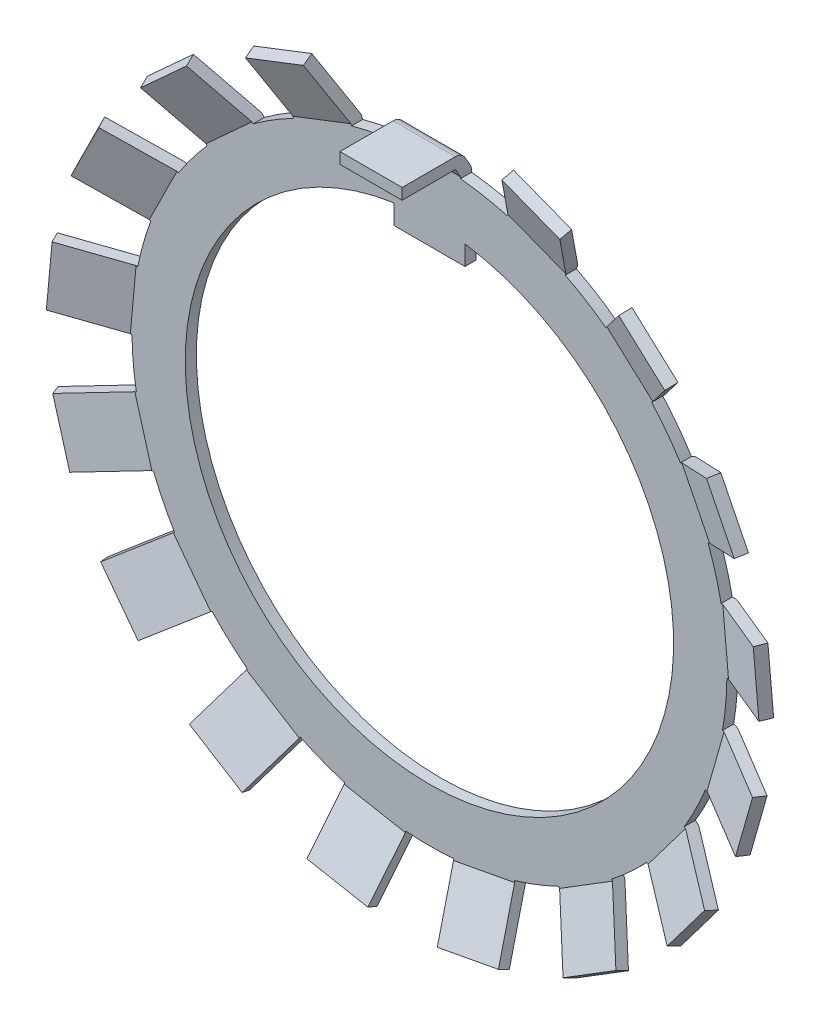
ISO-10303-21;
HEADER;
FILE_DESCRIPTION(('STEP AP214'),'2;1');
FILE_NAME('part.step','',(''),(''),'','','');
FILE_SCHEMA(('AUTOMOTIVE_DESIGN { 1 0 10303 214 1 1 1 1 }'));
ENDSEC;
DATA;
#1=APPLICATION_CONTEXT('core data for automotive mechanical design processes');
#2=APPLICATION_PROTOCOL_DEFINITION('international standard','automotive_design',2000,#1);
#3=PRODUCT_CONTEXT('',#1,'mechanical');
#4=PRODUCT('Part','Part','',(#3));
#5=PRODUCT_RELATED_PRODUCT_CATEGORY('part','',(#4));
#6=PRODUCT_DEFINITION_FORMATION('','',#4);
#7=PRODUCT_DEFINITION_CONTEXT('part definition',#1,'design');
#8=PRODUCT_DEFINITION('design','',#6,#7);
#9=PRODUCT_DEFINITION_SHAPE('','',#8);
#10=(LENGTH_UNIT() NAMED_UNIT(*) SI_UNIT(.MILLI.,.METRE.));
#11=(NAMED_UNIT(*) PLANE_ANGLE_UNIT() SI_UNIT($,.RADIAN.));
#12=(NAMED_UNIT(*) SI_UNIT($,.STERADIAN.) SOLID_ANGLE_UNIT());
#13=UNCERTAINTY_MEASURE_WITH_UNIT(LENGTH_MEASURE(1.E-05),#10,'distance_accuracy_value','');
#14=(GEOMETRIC_REPRESENTATION_CONTEXT(3) GLOBAL_UNCERTAINTY_ASSIGNED_CONTEXT((#13)) GLOBAL_UNIT_ASSIGNED_CONTEXT((#10,
#11,#12)) REPRESENTATION_CONTEXT('',''));
#15=CARTESIAN_POINT('',(0.,0.,0.));
#16=DIRECTION('',(0.,0.,1.));
#17=DIRECTION('',(1.,0.,0.));
#18=AXIS2_PLACEMENT_3D('',#15,#16,#17);
#19=CARTESIAN_POINT('',(0.,0.,1.25));
#20=DIRECTION('',(0.,0.,-1.));
#21=DIRECTION('',(-1.,0.,0.));
#22=AXIS2_PLACEMENT_3D('',#19,#20,#21);
#23=CYLINDRICAL_SURFACE('',#22,33.5);
#24=DIRECTION('',(0.,0.,-1.));
#25=VECTOR('',#24,1.);
#26=CARTESIAN_POINT('',(-3.5,33.3166624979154,1.25));
#27=LINE('',#26,#25);
#28=CARTESIAN_POINT('',(-3.5,33.3166624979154,0.));
#29=VERTEX_POINT('',#28);
#30=CARTESIAN_POINT('',(-3.5,33.3166624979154,1.25));
#31=VERTEX_POINT('',#30);
#32=EDGE_CURVE('E54',#29,#31,#27,.F.);
#33=ORIENTED_EDGE('',*,*,#32,.F.);
#34=CARTESIAN_POINT('',(0.,0.,0.));
#35=DIRECTION('',(0.,0.,1.));
#36=DIRECTION('',(1.,0.,0.));
#37=AXIS2_PLACEMENT_3D('',#34,#35,#36);
#38=CIRCLE('',#37,33.5);
#39=CARTESIAN_POINT('',(-8.77171386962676,32.3312083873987,0.));
#40=VERTEX_POINT('',#39);
#41=EDGE_CURVE('E1656',#29,#40,#38,.T.);
#42=ORIENTED_EDGE('',*,*,#41,.T.);
#43=DIRECTION('',(0.,0.,-1.));
#44=VECTOR('',#43,1.);
#45=CARTESIAN_POINT('',(-8.77171386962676,32.3312083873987,1.25));
#46=LINE('',#45,#44);
#47=CARTESIAN_POINT('',(-8.77171386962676,32.3312083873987,1.25));
#48=VERTEX_POINT('',#47);
#49=EDGE_CURVE('E1668',#40,#48,#46,.F.);
#50=ORIENTED_EDGE('',*,*,#49,.T.);
#51=CARTESIAN_POINT('',(0.,0.,1.25));
#52=DIRECTION('',(0.,0.,1.));
#53=DIRECTION('',(1.,0.,0.));
#54=AXIS2_PLACEMENT_3D('',#51,#52,#53);
#55=CIRCLE('',#54,33.5);
#56=EDGE_CURVE('E1659',#31,#48,#55,.T.);
#57=ORIENTED_EDGE('',*,*,#56,.F.);
#58=EDGE_LOOP('',(#33,#42,#50,#57));
#59=FACE_BOUND('',#58,.T.);
#60=ADVANCED_FACE('F31',(#59),#23,.T.);
#61=CARTESIAN_POINT('',(8.77171386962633,32.3312083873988,0.));
#62=VERTEX_POINT('',#61);
#63=CARTESIAN_POINT('',(3.5,33.3166624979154,0.));
#64=VERTEX_POINT('',#63);
#65=EDGE_CURVE('E1762',#62,#64,#38,.T.);
#66=ORIENTED_EDGE('',*,*,#65,.T.);
#67=DIRECTION('',(0.,0.,-1.));
#68=VECTOR('',#67,1.);
#69=CARTESIAN_POINT('',(3.5,33.3166624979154,1.25));
#70=LINE('',#69,#68);
#71=CARTESIAN_POINT('',(3.5,33.3166624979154,1.25));
#72=VERTEX_POINT('',#71);
#73=EDGE_CURVE('E46',#64,#72,#70,.F.);
#74=ORIENTED_EDGE('',*,*,#73,.T.);
#75=CARTESIAN_POINT('',(8.77171386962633,32.3312083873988,1.25));
#76=VERTEX_POINT('',#75);
#77=EDGE_CURVE('E3127',#76,#72,#55,.T.);
#78=ORIENTED_EDGE('',*,*,#77,.F.);
#79=DIRECTION('',(0.,0.,-1.));
#80=VECTOR('',#79,1.);
#81=CARTESIAN_POINT('',(8.77171386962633,32.3312083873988,1.25));
#82=LINE('',#81,#80);
#83=EDGE_CURVE('E924',#62,#76,#82,.F.);
#84=ORIENTED_EDGE('',*,*,#83,.F.);
#85=EDGE_LOOP('',(#66,#74,#78,#84));
#86=FACE_BOUND('',#85,.T.);
#87=ADVANCED_FACE('F1810',(#86),#23,.T.);
#88=CARTESIAN_POINT('',(19.8587591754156,26.9792454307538,0.));
#89=VERTEX_POINT('',#88);
#90=CARTESIAN_POINT('',(15.2990194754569,29.8025167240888,0.));
#91=VERTEX_POINT('',#90);
#92=EDGE_CURVE('E1758',#89,#91,#38,.T.);
#93=ORIENTED_EDGE('',*,*,#92,.T.);
#94=DIRECTION('',(0.,0.,-1.));
#95=VECTOR('',#94,1.);
#96=CARTESIAN_POINT('',(15.2990194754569,29.8025167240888,1.25));
#97=LINE('',#96,#95);
#98=CARTESIAN_POINT('',(15.2990194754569,29.8025167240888,1.25));
#99=VERTEX_POINT('',#98);
#100=EDGE_CURVE('E927',#91,#99,#97,.F.);
#101=ORIENTED_EDGE('',*,*,#100,.T.);
#102=CARTESIAN_POINT('',(19.8587591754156,26.9792454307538,1.25));
#103=VERTEX_POINT('',#102);
#104=EDGE_CURVE('E3128',#103,#99,#55,.T.);
#105=ORIENTED_EDGE('',*,*,#104,.F.);
#106=DIRECTION('',(0.,0.,-1.));
#107=VECTOR('',#106,1.);
#108=CARTESIAN_POINT('',(19.8587591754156,26.9792454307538,1.25));
#109=LINE('',#108,#107);
#110=EDGE_CURVE('E971',#89,#103,#109,.F.);
#111=ORIENTED_EDGE('',*,*,#110,.F.);
#112=EDGE_LOOP('',(#93,#101,#105,#111));
#113=FACE_BOUND('',#112,.T.);
#114=ADVANCED_FACE('F1861',(#113),#23,.T.);
#115=CARTESIAN_POINT('',(28.2637690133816,17.9835858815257,0.));
#116=VERTEX_POINT('',#115);
#117=CARTESIAN_POINT('',(25.0318215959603,22.2633759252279,0.));
#118=VERTEX_POINT('',#117);
#119=EDGE_CURVE('E1754',#116,#118,#38,.T.);
#120=ORIENTED_EDGE('',*,*,#119,.T.);
#121=DIRECTION('',(0.,0.,-1.));
#122=VECTOR('',#121,1.);
#123=CARTESIAN_POINT('',(25.0318215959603,22.2633759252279,1.25));
#124=LINE('',#123,#122);
#125=CARTESIAN_POINT('',(25.0318215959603,22.2633759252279,1.25));
#126=VERTEX_POINT('',#125);
#127=EDGE_CURVE('E974',#118,#126,#124,.F.);
#128=ORIENTED_EDGE('',*,*,#127,.T.);
#129=CARTESIAN_POINT('',(28.2637690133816,17.9835858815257,1.25));
#130=VERTEX_POINT('',#129);
#131=EDGE_CURVE('E3130',#130,#126,#55,.T.);
#132=ORIENTED_EDGE('',*,*,#131,.F.);
#133=DIRECTION('',(0.,0.,-1.));
#134=VECTOR('',#133,1.);
#135=CARTESIAN_POINT('',(28.2637690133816,17.9835858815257,1.25));
#136=LINE('',#135,#134);
#137=EDGE_CURVE('E1018',#116,#130,#136,.F.);
#138=ORIENTED_EDGE('',*,*,#137,.F.);
#139=EDGE_LOOP('',(#120,#128,#132,#138));
#140=FACE_BOUND('',#139,.T.);
#141=ADVANCED_FACE('F1857',(#140),#23,.T.);
#142=CARTESIAN_POINT('',(32.8516002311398,6.55914340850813,0.));
#143=VERTEX_POINT('',#142);
#144=CARTESIAN_POINT('',(31.3839375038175,11.7174428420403,0.));
#145=VERTEX_POINT('',#144);
#146=EDGE_CURVE('E1750',#143,#145,#38,.T.);
#147=ORIENTED_EDGE('',*,*,#146,.T.);
#148=DIRECTION('',(0.,0.,-1.));
#149=VECTOR('',#148,1.);
#150=CARTESIAN_POINT('',(31.3839375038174,11.7174428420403,1.25));
#151=LINE('',#150,#149);
#152=CARTESIAN_POINT('',(31.3839375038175,11.7174428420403,1.25));
#153=VERTEX_POINT('',#152);
#154=EDGE_CURVE('E1021',#145,#153,#151,.F.);
#155=ORIENTED_EDGE('',*,*,#154,.T.);
#156=CARTESIAN_POINT('',(32.8516002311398,6.55914340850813,1.25));
#157=VERTEX_POINT('',#156);
#158=EDGE_CURVE('E3134',#157,#153,#55,.T.);
#159=ORIENTED_EDGE('',*,*,#158,.F.);
#160=DIRECTION('',(0.,0.,-1.));
#161=VECTOR('',#160,1.);
#162=CARTESIAN_POINT('',(32.8516002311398,6.55914340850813,1.25));
#163=LINE('',#162,#161);
#164=EDGE_CURVE('E1066',#143,#157,#163,.F.);
#165=ORIENTED_EDGE('',*,*,#164,.F.);
#166=EDGE_LOOP('',(#147,#155,#159,#165));
#167=FACE_BOUND('',#166,.T.);
#168=ADVANCED_FACE('F1853',(#167),#23,.T.);
#169=CARTESIAN_POINT('',(33.0026408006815,-5.75114772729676,0.));
#170=VERTEX_POINT('',#169);
#171=CARTESIAN_POINT('',(33.497478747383,-0.410995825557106,0.));
#172=VERTEX_POINT('',#171);
#173=EDGE_CURVE('E1746',#170,#172,#38,.T.);
#174=ORIENTED_EDGE('',*,*,#173,.T.);
#175=DIRECTION('',(0.,0.,-1.));
#176=VECTOR('',#175,1.);
#177=CARTESIAN_POINT('',(33.497478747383,-0.410995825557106,1.25));
#178=LINE('',#177,#176);
#179=CARTESIAN_POINT('',(33.497478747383,-0.410995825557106,1.25));
#180=VERTEX_POINT('',#179);
#181=EDGE_CURVE('E1069',#172,#180,#178,.F.);
#182=ORIENTED_EDGE('',*,*,#181,.T.);
#183=CARTESIAN_POINT('',(33.0026408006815,-5.75114772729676,1.25));
#184=VERTEX_POINT('',#183);
#185=EDGE_CURVE('E3138',#184,#180,#55,.T.);
#186=ORIENTED_EDGE('',*,*,#185,.F.);
#187=DIRECTION('',(0.,0.,-1.));
#188=VECTOR('',#187,1.);
#189=CARTESIAN_POINT('',(33.0026408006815,-5.75114772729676,1.25));
#190=LINE('',#189,#188);
#191=EDGE_CURVE('E1113',#170,#184,#190,.F.);
#192=ORIENTED_EDGE('',*,*,#191,.F.);
#193=EDGE_LOOP('',(#174,#182,#186,#192));
#194=FACE_BOUND('',#193,.T.);
#195=ADVANCED_FACE('F1849',(#194),#23,.T.);
#196=CARTESIAN_POINT('',(28.6964918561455,-17.2847144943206,0.));
#197=VERTEX_POINT('',#196);
#198=CARTESIAN_POINT('',(31.086999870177,-12.4839272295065,0.));
#199=VERTEX_POINT('',#198);
#200=EDGE_CURVE('E1742',#197,#199,#38,.T.);
#201=ORIENTED_EDGE('',*,*,#200,.T.);
#202=DIRECTION('',(0.,0.,-1.));
#203=VECTOR('',#202,1.);
#204=CARTESIAN_POINT('',(31.086999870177,-12.4839272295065,1.25));
#205=LINE('',#204,#203);
#206=CARTESIAN_POINT('',(31.086999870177,-12.4839272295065,1.25));
#207=VERTEX_POINT('',#206);
#208=EDGE_CURVE('E1116',#199,#207,#205,.F.);
#209=ORIENTED_EDGE('',*,*,#208,.T.);
#210=CARTESIAN_POINT('',(28.6964918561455,-17.2847144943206,1.25));
#211=VERTEX_POINT('',#210);
#212=EDGE_CURVE('E3142',#211,#207,#55,.T.);
#213=ORIENTED_EDGE('',*,*,#212,.F.);
#214=DIRECTION('',(0.,0.,-1.));
#215=VECTOR('',#214,1.);
#216=CARTESIAN_POINT('',(28.6964918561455,-17.2847144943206,1.25));
#217=LINE('',#216,#215);
#218=EDGE_CURVE('E1160',#197,#211,#217,.F.);
#219=ORIENTED_EDGE('',*,*,#218,.F.);
#220=EDGE_LOOP('',(#201,#209,#213,#219));
#221=FACE_BOUND('',#220,.T.);
#222=ADVANCED_FACE('F1845',(#221),#23,.T.);
#223=CARTESIAN_POINT('',(20.5147226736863,-26.483884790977,0.));
#224=VERTEX_POINT('',#223);
#225=CARTESIAN_POINT('',(24.4780494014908,-22.8708350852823,0.));
#226=VERTEX_POINT('',#225);
#227=EDGE_CURVE('E1738',#224,#226,#38,.T.);
#228=ORIENTED_EDGE('',*,*,#227,.T.);
#229=DIRECTION('',(0.,0.,-1.));
#230=VECTOR('',#229,1.);
#231=CARTESIAN_POINT('',(24.4780494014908,-22.8708350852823,1.25));
#232=LINE('',#231,#230);
#233=CARTESIAN_POINT('',(24.4780494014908,-22.8708350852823,1.25));
#234=VERTEX_POINT('',#233);
#235=EDGE_CURVE('E1163',#226,#234,#232,.F.);
#236=ORIENTED_EDGE('',*,*,#235,.T.);
#237=CARTESIAN_POINT('',(20.5147226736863,-26.483884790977,1.25));
#238=VERTEX_POINT('',#237);
#239=EDGE_CURVE('E3146',#238,#234,#55,.T.);
#240=ORIENTED_EDGE('',*,*,#239,.F.);
#241=DIRECTION('',(0.,0.,-1.));
#242=VECTOR('',#241,1.);
#243=CARTESIAN_POINT('',(20.5147226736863,-26.483884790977,1.25));
#244=LINE('',#243,#242);
#245=EDGE_CURVE('E1207',#224,#238,#244,.F.);
#246=ORIENTED_EDGE('',*,*,#245,.F.);
#247=EDGE_LOOP('',(#228,#236,#240,#246));
#248=FACE_BOUND('',#247,.T.);
#249=ADVANCED_FACE('F1841',(#248),#23,.T.);
#250=CARTESIAN_POINT('',(9.56232651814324,-32.1062596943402,0.));
#251=VERTEX_POINT('',#250);
#252=CARTESIAN_POINT('',(14.5632027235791,-30.1689099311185,0.));
#253=VERTEX_POINT('',#252);
#254=EDGE_CURVE('E1734',#251,#253,#38,.T.);
#255=ORIENTED_EDGE('',*,*,#254,.T.);
#256=DIRECTION('',(0.,0.,-1.));
#257=VECTOR('',#256,1.);
#258=CARTESIAN_POINT('',(14.5632027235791,-30.1689099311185,1.25));
#259=LINE('',#258,#257);
#260=CARTESIAN_POINT('',(14.5632027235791,-30.1689099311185,1.25));
#261=VERTEX_POINT('',#260);
#262=EDGE_CURVE('E1210',#253,#261,#259,.F.);
#263=ORIENTED_EDGE('',*,*,#262,.T.);
#264=CARTESIAN_POINT('',(9.56232651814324,-32.1062596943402,1.25));
#265=VERTEX_POINT('',#264);
#266=EDGE_CURVE('E3150',#265,#261,#55,.T.);
#267=ORIENTED_EDGE('',*,*,#266,.F.);
#268=DIRECTION('',(0.,0.,-1.));
#269=VECTOR('',#268,1.);
#270=CARTESIAN_POINT('',(9.56232651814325,-32.1062596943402,1.25));
#271=LINE('',#270,#269);
#272=EDGE_CURVE('E1254',#251,#265,#271,.F.);
#273=ORIENTED_EDGE('',*,*,#272,.F.);
#274=EDGE_LOOP('',(#255,#263,#267,#273));
#275=FACE_BOUND('',#274,.T.);
#276=ADVANCED_FACE('F1837',(#275),#23,.T.);
#277=CARTESIAN_POINT('',(-2.68151482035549,-33.3925063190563,0.));
#278=VERTEX_POINT('',#277);
#279=CARTESIAN_POINT('',(2.68151482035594,-33.3925063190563,0.));
#280=VERTEX_POINT('',#279);
#281=EDGE_CURVE('E1730',#278,#280,#38,.T.);
#282=ORIENTED_EDGE('',*,*,#281,.T.);
#283=DIRECTION('',(0.,0.,-1.));
#284=VECTOR('',#283,1.);
#285=CARTESIAN_POINT('',(2.68151482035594,-33.3925063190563,1.25));
#286=LINE('',#285,#284);
#287=CARTESIAN_POINT('',(2.68151482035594,-33.3925063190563,1.25));
#288=VERTEX_POINT('',#287);
#289=EDGE_CURVE('E1257',#280,#288,#286,.F.);
#290=ORIENTED_EDGE('',*,*,#289,.T.);
#291=CARTESIAN_POINT('',(-2.68151482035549,-33.3925063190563,1.25));
#292=VERTEX_POINT('',#291);
#293=EDGE_CURVE('E3154',#292,#288,#55,.T.);
#294=ORIENTED_EDGE('',*,*,#293,.F.);
#295=DIRECTION('',(0.,0.,-1.));
#296=VECTOR('',#295,1.);
#297=CARTESIAN_POINT('',(-2.68151482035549,-33.3925063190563,1.25));
#298=LINE('',#297,#296);
#299=EDGE_CURVE('E1301',#278,#292,#298,.F.);
#300=ORIENTED_EDGE('',*,*,#299,.F.);
#301=EDGE_LOOP('',(#282,#290,#294,#300));
#302=FACE_BOUND('',#301,.T.);
#303=ADVANCED_FACE('F1833',(#302),#23,.T.);
#304=CARTESIAN_POINT('',(-14.5632027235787,-30.1689099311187,0.));
#305=VERTEX_POINT('',#304);
#306=CARTESIAN_POINT('',(-9.56232651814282,-32.1062596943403,0.));
#307=VERTEX_POINT('',#306);
#308=EDGE_CURVE('E1726',#305,#307,#38,.T.);
#309=ORIENTED_EDGE('',*,*,#308,.T.);
#310=DIRECTION('',(0.,0.,-1.));
#311=VECTOR('',#310,1.);
#312=CARTESIAN_POINT('',(-9.56232651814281,-32.1062596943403,1.25));
#313=LINE('',#312,#311);
#314=CARTESIAN_POINT('',(-9.56232651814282,-32.1062596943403,1.25));
#315=VERTEX_POINT('',#314);
#316=EDGE_CURVE('E1304',#307,#315,#313,.F.);
#317=ORIENTED_EDGE('',*,*,#316,.T.);
#318=CARTESIAN_POINT('',(-14.5632027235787,-30.1689099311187,1.25));
#319=VERTEX_POINT('',#318);
#320=EDGE_CURVE('E3158',#319,#315,#55,.T.);
#321=ORIENTED_EDGE('',*,*,#320,.F.);
#322=DIRECTION('',(0.,0.,-1.));
#323=VECTOR('',#322,1.);
#324=CARTESIAN_POINT('',(-14.5632027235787,-30.1689099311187,1.25));
#325=LINE('',#324,#323);
#326=EDGE_CURVE('E1348',#305,#319,#325,.F.);
#327=ORIENTED_EDGE('',*,*,#326,.F.);
#328=EDGE_LOOP('',(#309,#317,#321,#327));
#329=FACE_BOUND('',#328,.T.);
#330=ADVANCED_FACE('F1829',(#329),#23,.T.);
#331=CARTESIAN_POINT('',(-24.4780494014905,-22.8708350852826,0.));
#332=VERTEX_POINT('',#331);
#333=CARTESIAN_POINT('',(-20.514722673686,-26.4838847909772,0.));
#334=VERTEX_POINT('',#333);
#335=EDGE_CURVE('E1722',#332,#334,#38,.T.);
#336=ORIENTED_EDGE('',*,*,#335,.T.);
#337=DIRECTION('',(0.,0.,-1.));
#338=VECTOR('',#337,1.);
#339=CARTESIAN_POINT('',(-20.514722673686,-26.4838847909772,1.25));
#340=LINE('',#339,#338);
#341=CARTESIAN_POINT('',(-20.514722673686,-26.4838847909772,1.25));
#342=VERTEX_POINT('',#341);
#343=EDGE_CURVE('E1351',#334,#342,#340,.F.);
#344=ORIENTED_EDGE('',*,*,#343,.T.);
#345=CARTESIAN_POINT('',(-24.4780494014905,-22.8708350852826,1.25));
#346=VERTEX_POINT('',#345);
#347=EDGE_CURVE('E3162',#346,#342,#55,.T.);
#348=ORIENTED_EDGE('',*,*,#347,.F.);
#349=DIRECTION('',(0.,0.,-1.));
#350=VECTOR('',#349,1.);
#351=CARTESIAN_POINT('',(-24.4780494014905,-22.8708350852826,1.25));
#352=LINE('',#351,#350);
#353=EDGE_CURVE('E1395',#332,#346,#352,.F.);
#354=ORIENTED_EDGE('',*,*,#353,.F.);
#355=EDGE_LOOP('',(#336,#344,#348,#354));
#356=FACE_BOUND('',#355,.T.);
#357=ADVANCED_FACE('F1825',(#356),#23,.T.);
#358=CARTESIAN_POINT('',(-31.0869998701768,-12.4839272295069,0.));
#359=VERTEX_POINT('',#358);
#360=CARTESIAN_POINT('',(-28.6964918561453,-17.2847144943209,0.));
#361=VERTEX_POINT('',#360);
#362=EDGE_CURVE('E1718',#359,#361,#38,.T.);
#363=ORIENTED_EDGE('',*,*,#362,.T.);
#364=DIRECTION('',(0.,0.,-1.));
#365=VECTOR('',#364,1.);
#366=CARTESIAN_POINT('',(-28.6964918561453,-17.2847144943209,1.25));
#367=LINE('',#366,#365);
#368=CARTESIAN_POINT('',(-28.6964918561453,-17.2847144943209,1.25));
#369=VERTEX_POINT('',#368);
#370=EDGE_CURVE('E1398',#361,#369,#367,.F.);
#371=ORIENTED_EDGE('',*,*,#370,.T.);
#372=CARTESIAN_POINT('',(-31.0869998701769,-12.4839272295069,1.25));
#373=VERTEX_POINT('',#372);
#374=EDGE_CURVE('E3166',#373,#369,#55,.T.);
#375=ORIENTED_EDGE('',*,*,#374,.F.);
#376=DIRECTION('',(0.,0.,-1.));
#377=VECTOR('',#376,1.);
#378=CARTESIAN_POINT('',(-31.0869998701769,-12.4839272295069,1.25));
#379=LINE('',#378,#377);
#380=EDGE_CURVE('E1442',#359,#373,#379,.F.);
#381=ORIENTED_EDGE('',*,*,#380,.F.);
#382=EDGE_LOOP('',(#363,#371,#375,#381));
#383=FACE_BOUND('',#382,.T.);
#384=ADVANCED_FACE('F1821',(#383),#23,.T.);
#385=CARTESIAN_POINT('',(-33.497478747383,-0.410995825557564,0.));
#386=VERTEX_POINT('',#385);
#387=CARTESIAN_POINT('',(-33.0026408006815,-5.75114772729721,0.));
#388=VERTEX_POINT('',#387);
#389=EDGE_CURVE('E1714',#386,#388,#38,.T.);
#390=ORIENTED_EDGE('',*,*,#389,.T.);
#391=DIRECTION('',(0.,0.,-1.));
#392=VECTOR('',#391,1.);
#393=CARTESIAN_POINT('',(-33.0026408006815,-5.75114772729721,1.25));
#394=LINE('',#393,#392);
#395=CARTESIAN_POINT('',(-33.0026408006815,-5.75114772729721,1.25));
#396=VERTEX_POINT('',#395);
#397=EDGE_CURVE('E1445',#388,#396,#394,.F.);
#398=ORIENTED_EDGE('',*,*,#397,.T.);
#399=CARTESIAN_POINT('',(-33.497478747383,-0.410995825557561,1.25));
#400=VERTEX_POINT('',#399);
#401=EDGE_CURVE('E3170',#400,#396,#55,.T.);
#402=ORIENTED_EDGE('',*,*,#401,.F.);
#403=DIRECTION('',(0.,0.,-1.));
#404=VECTOR('',#403,1.);
#405=CARTESIAN_POINT('',(-33.497478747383,-0.410995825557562,1.25));
#406=LINE('',#405,#404);
#407=EDGE_CURVE('E1489',#386,#400,#406,.F.);
#408=ORIENTED_EDGE('',*,*,#407,.F.);
#409=EDGE_LOOP('',(#390,#398,#402,#408));
#410=FACE_BOUND('',#409,.T.);
#411=ADVANCED_FACE('F1817',(#410),#23,.T.);
#412=CARTESIAN_POINT('',(-31.3839375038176,11.7174428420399,0.));
#413=VERTEX_POINT('',#412);
#414=CARTESIAN_POINT('',(-32.8516002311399,6.55914340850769,0.));
#415=VERTEX_POINT('',#414);
#416=EDGE_CURVE('E1713',#413,#415,#38,.T.);
#417=ORIENTED_EDGE('',*,*,#416,.T.);
#418=DIRECTION('',(0.,0.,-1.));
#419=VECTOR('',#418,1.);
#420=CARTESIAN_POINT('',(-32.8516002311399,6.55914340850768,1.25));
#421=LINE('',#420,#419);
#422=CARTESIAN_POINT('',(-32.8516002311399,6.55914340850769,1.25));
#423=VERTEX_POINT('',#422);
#424=EDGE_CURVE('E1492',#415,#423,#421,.F.);
#425=ORIENTED_EDGE('',*,*,#424,.T.);
#426=CARTESIAN_POINT('',(-31.3839375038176,11.7174428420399,1.25));
#427=VERTEX_POINT('',#426);
#428=EDGE_CURVE('E3174',#427,#423,#55,.T.);
#429=ORIENTED_EDGE('',*,*,#428,.F.);
#430=DIRECTION('',(0.,0.,-1.));
#431=VECTOR('',#430,1.);
#432=CARTESIAN_POINT('',(-31.3839375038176,11.7174428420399,1.25));
#433=LINE('',#432,#431);
#434=EDGE_CURVE('E1536',#413,#427,#433,.F.);
#435=ORIENTED_EDGE('',*,*,#434,.F.);
#436=EDGE_LOOP('',(#417,#425,#429,#435));
#437=FACE_BOUND('',#436,.T.);
#438=ADVANCED_FACE('F1812',(#437),#23,.T.);
#439=CARTESIAN_POINT('',(-25.0318215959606,22.2633759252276,0.));
#440=VERTEX_POINT('',#439);
#441=CARTESIAN_POINT('',(-28.2637690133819,17.9835858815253,0.));
#442=VERTEX_POINT('',#441);
#443=EDGE_CURVE('E1660',#440,#442,#38,.T.);
#444=ORIENTED_EDGE('',*,*,#443,.T.);
#445=DIRECTION('',(0.,0.,-1.));
#446=VECTOR('',#445,1.);
#447=CARTESIAN_POINT('',(-28.2637690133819,17.9835858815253,1.25));
#448=LINE('',#447,#446);
#449=CARTESIAN_POINT('',(-28.2637690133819,17.9835858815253,1.25));
#450=VERTEX_POINT('',#449);
#451=EDGE_CURVE('E1539',#442,#450,#448,.F.);
#452=ORIENTED_EDGE('',*,*,#451,.T.);
#453=CARTESIAN_POINT('',(-25.0318215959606,22.2633759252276,1.25));
#454=VERTEX_POINT('',#453);
#455=EDGE_CURVE('E1665',#454,#450,#55,.T.);
#456=ORIENTED_EDGE('',*,*,#455,.F.);
#457=DIRECTION('',(0.,0.,-1.));
#458=VECTOR('',#457,1.);
#459=CARTESIAN_POINT('',(-25.0318215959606,22.2633759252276,1.25));
#460=LINE('',#459,#458);
#461=EDGE_CURVE('E39',#440,#454,#460,.F.);
#462=ORIENTED_EDGE('',*,*,#461,.F.);
#463=EDGE_LOOP('',(#444,#452,#456,#462));
#464=FACE_BOUND('',#463,.T.);
#465=ADVANCED_FACE('F1800',(#464),#23,.T.);
#466=CARTESIAN_POINT('',(0.,0.,1.25));
#467=DIRECTION('',(0.,0.,1.));
#468=DIRECTION('',(1.,0.,0.));
#469=AXIS2_PLACEMENT_3D('',#466,#467,#468);
#470=PLANE('',#469);
#471=ORIENTED_EDGE('',*,*,#77,.T.);
#472=DIRECTION('',(0.,1.,0.));
#473=VECTOR('',#472,1.);
#474=CARTESIAN_POINT('',(3.5,27.5,1.25));
#475=LINE('',#474,#473);
#476=CARTESIAN_POINT('',(3.5,33.5,1.25));
#477=VERTEX_POINT('',#476);
#478=EDGE_CURVE('E856',#72,#477,#475,.T.);
#479=ORIENTED_EDGE('',*,*,#478,.T.);
#480=DIRECTION('',(-1.,0.,0.));
#481=VECTOR('',#480,1.);
#482=CARTESIAN_POINT('',(3.5,33.5,1.25));
#483=LINE('',#482,#481);
#484=CARTESIAN_POINT('',(-3.5,33.5,1.25));
#485=VERTEX_POINT('',#484);
#486=EDGE_CURVE('E875',#477,#485,#483,.T.);
#487=ORIENTED_EDGE('',*,*,#486,.T.);
#488=DIRECTION('',(0.,1.,0.));
#489=VECTOR('',#488,1.);
#490=CARTESIAN_POINT('',(-3.5,27.5,1.25));
#491=LINE('',#490,#489);
#492=EDGE_CURVE('E835',#31,#485,#491,.T.);
#493=ORIENTED_EDGE('',*,*,#492,.F.);
#494=ORIENTED_EDGE('',*,*,#56,.T.);
#495=DIRECTION('',(-0.361241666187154,0.932472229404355,0.));
#496=VECTOR('',#495,1.);
#497=CARTESIAN_POINT('',(-6.67049301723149,26.9073321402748,1.25));
#498=LINE('',#497,#496);
#499=CARTESIAN_POINT('',(-8.8379430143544,32.5021655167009,1.25));
#500=VERTEX_POINT('',#499);
#501=EDGE_CURVE('E1608',#48,#500,#498,.T.);
#502=ORIENTED_EDGE('',*,*,#501,.T.);
#503=DIRECTION('',(-0.932472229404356,-0.361241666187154,0.));
#504=VECTOR('',#503,1.);
#505=CARTESIAN_POINT('',(-8.8379430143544,32.5021655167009,1.25));
#506=LINE('',#505,#504);
#507=CARTESIAN_POINT('',(-15.3652486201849,29.9734738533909,1.25));
#508=VERTEX_POINT('',#507);
#509=EDGE_CURVE('E1619',#500,#508,#506,.T.);
#510=ORIENTED_EDGE('',*,*,#509,.T.);
#511=DIRECTION('',(-0.361241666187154,0.932472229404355,0.));
#512=VECTOR('',#511,1.);
#513=CARTESIAN_POINT('',(-13.197798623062,24.3786404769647,1.25));
#514=LINE('',#513,#512);
#515=CARTESIAN_POINT('',(-15.2990194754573,29.8025167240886,1.25));
#516=VERTEX_POINT('',#515);
#517=EDGE_CURVE('E1592',#516,#508,#514,.T.);
#518=ORIENTED_EDGE('',*,*,#517,.F.);
#519=CARTESIAN_POINT('',(-19.8587591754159,26.9792454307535,1.25));
#520=VERTEX_POINT('',#519);
#521=EDGE_CURVE('E1661',#516,#520,#55,.T.);
#522=ORIENTED_EDGE('',*,*,#521,.T.);
#523=DIRECTION('',(-0.673695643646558,0.739008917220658,0.));
#524=VECTOR('',#523,1.);
#525=CARTESIAN_POINT('',(-15.9400989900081,22.680679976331,1.25));
#526=LINE('',#525,#524);
#527=CARTESIAN_POINT('',(-19.9822728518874,27.114733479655,1.25));
#528=VERTEX_POINT('',#527);
#529=EDGE_CURVE('E1566',#520,#528,#526,.T.);
#530=ORIENTED_EDGE('',*,*,#529,.T.);
#531=DIRECTION('',(-0.739008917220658,-0.673695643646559,0.));
#532=VECTOR('',#531,1.);
#533=CARTESIAN_POINT('',(-19.9822728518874,27.114733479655,1.25));
#534=LINE('',#533,#532);
#535=CARTESIAN_POINT('',(-25.155335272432,22.3988639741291,1.25));
#536=VERTEX_POINT('',#535);
#537=EDGE_CURVE('E1577',#528,#536,#534,.T.);
#538=ORIENTED_EDGE('',*,*,#537,.T.);
#539=DIRECTION('',(-0.673695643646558,0.739008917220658,0.));
#540=VECTOR('',#539,1.);
#541=CARTESIAN_POINT('',(-21.1131614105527,17.9648104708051,1.25));
#542=LINE('',#541,#540);
#543=EDGE_CURVE('E1550',#454,#536,#542,.T.);
#544=ORIENTED_EDGE('',*,*,#543,.F.);
#545=ORIENTED_EDGE('',*,*,#455,.T.);
#546=DIRECTION('',(-0.895163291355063,0.445738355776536,0.));
#547=VECTOR('',#546,1.);
#548=CARTESIAN_POINT('',(-23.0569062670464,15.3908763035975,1.25));
#549=LINE('',#548,#547);
#550=CARTESIAN_POINT('',(-28.4278860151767,18.0653064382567,1.25));
#551=VERTEX_POINT('',#550);
#552=EDGE_CURVE('E1519',#450,#551,#549,.T.);
#553=ORIENTED_EDGE('',*,*,#552,.T.);
#554=DIRECTION('',(-0.445738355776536,-0.895163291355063,0.));
#555=VECTOR('',#554,1.);
#556=CARTESIAN_POINT('',(-28.4278860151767,18.0653064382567,1.25));
#557=LINE('',#556,#555);
#558=CARTESIAN_POINT('',(-31.5480545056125,11.7991633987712,1.25));
#559=VERTEX_POINT('',#558);
#560=EDGE_CURVE('E1530',#551,#559,#557,.T.);
#561=ORIENTED_EDGE('',*,*,#560,.T.);
#562=DIRECTION('',(-0.895163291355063,0.445738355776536,0.));
#563=VECTOR('',#562,1.);
#564=CARTESIAN_POINT('',(-26.1770747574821,9.12473326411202,1.25));
#565=LINE('',#564,#563);
#566=EDGE_CURVE('E1503',#427,#559,#565,.T.);
#567=ORIENTED_EDGE('',*,*,#566,.F.);
#568=ORIENTED_EDGE('',*,*,#428,.T.);
#569=DIRECTION('',(-0.995734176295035,0.0922683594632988,0.));
#570=VECTOR('',#569,1.);
#571=CARTESIAN_POINT('',(-27.0597505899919,6.02244950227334,1.25));
#572=LINE('',#571,#570);
#573=CARTESIAN_POINT('',(-33.0341556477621,6.57605965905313,1.25));
#574=VERTEX_POINT('',#573);
#575=EDGE_CURVE('E1472',#423,#574,#572,.T.);
#576=ORIENTED_EDGE('',*,*,#575,.T.);
#577=DIRECTION('',(-0.0922683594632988,-0.995734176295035,0.));
#578=VECTOR('',#577,1.);
#579=CARTESIAN_POINT('',(-33.0341556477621,6.57605965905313,1.25));
#580=LINE('',#579,#578);
#581=CARTESIAN_POINT('',(-33.6800341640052,-0.394079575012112,1.25));
#582=VERTEX_POINT('',#581);
#583=EDGE_CURVE('E1483',#574,#582,#580,.T.);
#584=ORIENTED_EDGE('',*,*,#583,.T.);
#585=DIRECTION('',(-0.995734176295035,0.0922683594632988,0.));
#586=VECTOR('',#585,1.);
#587=CARTESIAN_POINT('',(-27.705629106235,-0.947689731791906,1.25));
#588=LINE('',#587,#586);
#589=EDGE_CURVE('E1456',#400,#582,#588,.T.);
#590=ORIENTED_EDGE('',*,*,#589,.F.);
#591=ORIENTED_EDGE('',*,*,#401,.T.);
#592=DIRECTION('',(-0.961825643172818,-0.273662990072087,0.));
#593=VECTOR('',#592,1.);
#594=CARTESIAN_POINT('',(-27.4080256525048,-4.15934247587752,1.25));
#595=LINE('',#594,#593);
#596=CARTESIAN_POINT('',(-33.1789795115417,-5.80132041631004,1.25));
#597=VERTEX_POINT('',#596);
#598=EDGE_CURVE('E1425',#396,#597,#595,.T.);
#599=ORIENTED_EDGE('',*,*,#598,.T.);
#600=DIRECTION('',(0.273662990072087,-0.961825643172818,0.));
#601=VECTOR('',#600,1.);
#602=CARTESIAN_POINT('',(-33.1789795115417,-5.80132041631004,1.25));
#603=LINE('',#602,#601);
#604=CARTESIAN_POINT('',(-31.2633385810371,-12.5340999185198,1.25));
#605=VERTEX_POINT('',#604);
#606=EDGE_CURVE('E1436',#597,#605,#603,.T.);
#607=ORIENTED_EDGE('',*,*,#606,.T.);
#608=DIRECTION('',(-0.961825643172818,-0.273662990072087,0.));
#609=VECTOR('',#608,1.);
#610=CARTESIAN_POINT('',(-25.4923847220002,-10.8921219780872,1.25));
#611=LINE('',#610,#609);
#612=EDGE_CURVE('E1409',#373,#605,#611,.T.);
#613=ORIENTED_EDGE('',*,*,#612,.F.);
#614=ORIENTED_EDGE('',*,*,#374,.T.);
#615=DIRECTION('',(-0.798017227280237,-0.60263463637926,0.));
#616=VECTOR('',#615,1.);
#617=CARTESIAN_POINT('',(-24.0546949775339,-13.7793922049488,1.25));
#618=LINE('',#617,#616);
#619=CARTESIAN_POINT('',(-28.8427983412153,-17.3952000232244,1.25));
#620=VERTEX_POINT('',#619);
#621=EDGE_CURVE('E1378',#369,#620,#618,.T.);
#622=ORIENTED_EDGE('',*,*,#621,.T.);
#623=DIRECTION('',(0.60263463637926,-0.798017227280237,0.));
#624=VECTOR('',#623,1.);
#625=CARTESIAN_POINT('',(-28.8427983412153,-17.3952000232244,1.25));
#626=LINE('',#625,#624);
#627=CARTESIAN_POINT('',(-24.6243558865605,-22.981320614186,1.25));
#628=VERTEX_POINT('',#627);
#629=EDGE_CURVE('E1389',#620,#628,#626,.T.);
#630=ORIENTED_EDGE('',*,*,#629,.T.);
#631=DIRECTION('',(-0.798017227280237,-0.60263463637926,0.));
#632=VECTOR('',#631,1.);
#633=CARTESIAN_POINT('',(-19.8362525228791,-19.3655127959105,1.25));
#634=LINE('',#633,#632);
#635=EDGE_CURVE('E1362',#346,#628,#634,.T.);
#636=ORIENTED_EDGE('',*,*,#635,.F.);
#637=ORIENTED_EDGE('',*,*,#347,.T.);
#638=DIRECTION('',(-0.526432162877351,-0.850217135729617,0.));
#639=VECTOR('',#638,1.);
#640=CARTESIAN_POINT('',(-17.4526444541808,-21.5384586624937,1.25));
#641=LINE('',#640,#639);
#642=CARTESIAN_POINT('',(-20.6112374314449,-26.6397614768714,1.25));
#643=VERTEX_POINT('',#642);
#644=EDGE_CURVE('E1331',#342,#643,#641,.T.);
#645=ORIENTED_EDGE('',*,*,#644,.T.);
#646=DIRECTION('',(0.850217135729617,-0.526432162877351,0.));
#647=VECTOR('',#646,1.);
#648=CARTESIAN_POINT('',(-20.6112374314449,-26.6397614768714,1.25));
#649=LINE('',#648,#647);
#650=CARTESIAN_POINT('',(-14.6597174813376,-30.3247866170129,1.25));
#651=VERTEX_POINT('',#650);
#652=EDGE_CURVE('E1342',#643,#651,#649,.T.);
#653=ORIENTED_EDGE('',*,*,#652,.T.);
#654=DIRECTION('',(-0.526432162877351,-0.850217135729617,0.));
#655=VECTOR('',#654,1.);
#656=CARTESIAN_POINT('',(-11.5011245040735,-25.2234838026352,1.25));
#657=LINE('',#656,#655);
#658=EDGE_CURVE('E1315',#319,#651,#657,.T.);
#659=ORIENTED_EDGE('',*,*,#658,.F.);
#660=ORIENTED_EDGE('',*,*,#320,.T.);
#661=DIRECTION('',(-0.183749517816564,-0.982973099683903,0.));
#662=VECTOR('',#661,1.);
#663=CARTESIAN_POINT('',(-8.49351758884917,-26.3886369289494,1.25));
#664=LINE('',#663,#662);
#665=CARTESIAN_POINT('',(-9.59601469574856,-32.2864755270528,1.25));
#666=VERTEX_POINT('',#665);
#667=EDGE_CURVE('E1284',#315,#666,#664,.T.);
#668=ORIENTED_EDGE('',*,*,#667,.T.);
#669=DIRECTION('',(0.982973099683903,-0.183749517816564,0.));
#670=VECTOR('',#669,1.);
#671=CARTESIAN_POINT('',(-9.59601469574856,-32.2864755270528,1.25));
#672=LINE('',#671,#670);
#673=CARTESIAN_POINT('',(-2.71520299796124,-33.5727221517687,1.25));
#674=VERTEX_POINT('',#673);
#675=EDGE_CURVE('E1295',#666,#674,#672,.T.);
#676=ORIENTED_EDGE('',*,*,#675,.T.);
#677=DIRECTION('',(-0.183749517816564,-0.982973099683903,0.));
#678=VECTOR('',#677,1.);
#679=CARTESIAN_POINT('',(-1.61270589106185,-27.6748835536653,1.25));
#680=LINE('',#679,#678);
#681=EDGE_CURVE('E1268',#292,#674,#680,.T.);
#682=ORIENTED_EDGE('',*,*,#681,.F.);
#683=ORIENTED_EDGE('',*,*,#293,.T.);
#684=DIRECTION('',(0.183749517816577,-0.982973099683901,0.));
#685=VECTOR('',#684,1.);
#686=CARTESIAN_POINT('',(1.61270589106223,-27.6748835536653,1.25));
#687=LINE('',#686,#685);
#688=CARTESIAN_POINT('',(2.71520299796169,-33.5727221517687,1.25));
#689=VERTEX_POINT('',#688);
#690=EDGE_CURVE('E1237',#288,#689,#687,.T.);
#691=ORIENTED_EDGE('',*,*,#690,.T.);
#692=DIRECTION('',(0.9829730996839,0.183749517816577,0.));
#693=VECTOR('',#692,1.);
#694=CARTESIAN_POINT('',(2.71520299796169,-33.5727221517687,1.25));
#695=LINE('',#694,#693);
#696=CARTESIAN_POINT('',(9.59601469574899,-32.2864755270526,1.25));
#697=VERTEX_POINT('',#696);
#698=EDGE_CURVE('E1248',#689,#697,#695,.T.);
#699=ORIENTED_EDGE('',*,*,#698,.T.);
#700=DIRECTION('',(0.183749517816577,-0.982973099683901,0.));
#701=VECTOR('',#700,1.);
#702=CARTESIAN_POINT('',(8.49351758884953,-26.3886369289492,1.25));
#703=LINE('',#702,#701);
#704=EDGE_CURVE('E1221',#265,#697,#703,.T.);
#705=ORIENTED_EDGE('',*,*,#704,.F.);
#706=ORIENTED_EDGE('',*,*,#266,.T.);
#707=DIRECTION('',(0.526432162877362,-0.85021713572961,0.));
#708=VECTOR('',#707,1.);
#709=CARTESIAN_POINT('',(11.5011245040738,-25.223483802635,1.25));
#710=LINE('',#709,#708);
#711=CARTESIAN_POINT('',(14.659717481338,-30.3247866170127,1.25));
#712=VERTEX_POINT('',#711);
#713=EDGE_CURVE('E1190',#261,#712,#710,.T.);
#714=ORIENTED_EDGE('',*,*,#713,.T.);
#715=DIRECTION('',(0.85021713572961,0.526432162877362,0.));
#716=VECTOR('',#715,1.);
#717=CARTESIAN_POINT('',(14.659717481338,-30.3247866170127,1.25));
#718=LINE('',#717,#716);
#719=CARTESIAN_POINT('',(20.6112374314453,-26.6397614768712,1.25));
#720=VERTEX_POINT('',#719);
#721=EDGE_CURVE('E1201',#712,#720,#718,.T.);
#722=ORIENTED_EDGE('',*,*,#721,.T.);
#723=DIRECTION('',(0.526432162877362,-0.85021713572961,0.));
#724=VECTOR('',#723,1.);
#725=CARTESIAN_POINT('',(17.4526444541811,-21.5384586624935,1.25));
#726=LINE('',#725,#724);
#727=EDGE_CURVE('E1174',#238,#720,#726,.T.);
#728=ORIENTED_EDGE('',*,*,#727,.F.);
#729=ORIENTED_EDGE('',*,*,#239,.T.);
#730=DIRECTION('',(0.798017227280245,-0.60263463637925,0.));
#731=VECTOR('',#730,1.);
#732=CARTESIAN_POINT('',(19.8362525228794,-19.3655127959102,1.25));
#733=LINE('',#732,#731);
#734=CARTESIAN_POINT('',(24.6243558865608,-22.9813206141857,1.25));
#735=VERTEX_POINT('',#734);
#736=EDGE_CURVE('E1143',#234,#735,#733,.T.);
#737=ORIENTED_EDGE('',*,*,#736,.T.);
#738=DIRECTION('',(0.60263463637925,0.798017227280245,0.));
#739=VECTOR('',#738,1.);
#740=CARTESIAN_POINT('',(24.6243558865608,-22.9813206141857,1.25));
#741=LINE('',#740,#739);
#742=CARTESIAN_POINT('',(28.8427983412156,-17.395200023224,1.25));
#743=VERTEX_POINT('',#742);
#744=EDGE_CURVE('E1154',#735,#743,#741,.T.);
#745=ORIENTED_EDGE('',*,*,#744,.T.);
#746=DIRECTION('',(0.798017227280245,-0.60263463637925,0.));
#747=VECTOR('',#746,1.);
#748=CARTESIAN_POINT('',(24.0546949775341,-13.7793922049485,1.25));
#749=LINE('',#748,#747);
#750=EDGE_CURVE('E1127',#211,#743,#749,.T.);
#751=ORIENTED_EDGE('',*,*,#750,.F.);
#752=ORIENTED_EDGE('',*,*,#212,.T.);
#753=DIRECTION('',(0.961825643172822,-0.273662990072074,0.));
#754=VECTOR('',#753,1.);
#755=CARTESIAN_POINT('',(25.4923847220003,-10.8921219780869,1.25));
#756=LINE('',#755,#754);
#757=CARTESIAN_POINT('',(31.2633385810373,-12.5340999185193,1.25));
#758=VERTEX_POINT('',#757);
#759=EDGE_CURVE('E1096',#207,#758,#756,.T.);
#760=ORIENTED_EDGE('',*,*,#759,.T.);
#761=DIRECTION('',(0.273662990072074,0.961825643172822,0.));
#762=VECTOR('',#761,1.);
#763=CARTESIAN_POINT('',(31.2633385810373,-12.5340999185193,1.25));
#764=LINE('',#763,#762);
#765=CARTESIAN_POINT('',(33.1789795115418,-5.80132041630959,1.25));
#766=VERTEX_POINT('',#765);
#767=EDGE_CURVE('E1107',#758,#766,#764,.T.);
#768=ORIENTED_EDGE('',*,*,#767,.T.);
#769=DIRECTION('',(0.961825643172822,-0.273662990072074,0.));
#770=VECTOR('',#769,1.);
#771=CARTESIAN_POINT('',(27.4080256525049,-4.15934247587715,1.25));
#772=LINE('',#771,#770);
#773=EDGE_CURVE('E1080',#184,#766,#772,.T.);
#774=ORIENTED_EDGE('',*,*,#773,.F.);
#775=ORIENTED_EDGE('',*,*,#185,.T.);
#776=DIRECTION('',(0.995734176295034,0.0922683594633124,0.));
#777=VECTOR('',#776,1.);
#778=CARTESIAN_POINT('',(27.705629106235,-0.947689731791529,1.25));
#779=LINE('',#778,#777);
#780=CARTESIAN_POINT('',(33.6800341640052,-0.394079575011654,1.25));
#781=VERTEX_POINT('',#780);
#782=EDGE_CURVE('E1048',#180,#781,#779,.T.);
#783=ORIENTED_EDGE('',*,*,#782,.T.);
#784=DIRECTION('',(-0.0922683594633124,0.995734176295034,0.));
#785=VECTOR('',#784,1.);
#786=CARTESIAN_POINT('',(33.6800341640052,-0.394079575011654,1.25));
#787=LINE('',#786,#785);
#788=CARTESIAN_POINT('',(33.034155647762,6.57605965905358,1.25));
#789=VERTEX_POINT('',#788);
#790=EDGE_CURVE('E1060',#781,#789,#787,.T.);
#791=ORIENTED_EDGE('',*,*,#790,.T.);
#792=DIRECTION('',(0.995734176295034,0.0922683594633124,0.));
#793=VECTOR('',#792,1.);
#794=CARTESIAN_POINT('',(27.0597505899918,6.02244950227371,1.25));
#795=LINE('',#794,#793);
#796=EDGE_CURVE('E1032',#157,#789,#795,.T.);
#797=ORIENTED_EDGE('',*,*,#796,.F.);
#798=ORIENTED_EDGE('',*,*,#158,.T.);
#799=DIRECTION('',(0.895163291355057,0.445738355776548,0.));
#800=VECTOR('',#799,1.);
#801=CARTESIAN_POINT('',(26.177074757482,9.12473326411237,1.25));
#802=LINE('',#801,#800);
#803=CARTESIAN_POINT('',(31.5480545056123,11.7991633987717,1.25));
#804=VERTEX_POINT('',#803);
#805=EDGE_CURVE('E1001',#153,#804,#802,.T.);
#806=ORIENTED_EDGE('',*,*,#805,.T.);
#807=DIRECTION('',(-0.445738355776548,0.895163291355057,0.));
#808=VECTOR('',#807,1.);
#809=CARTESIAN_POINT('',(31.5480545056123,11.7991633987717,1.25));
#810=LINE('',#809,#808);
#811=CARTESIAN_POINT('',(28.4278860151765,18.0653064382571,1.25));
#812=VERTEX_POINT('',#811);
#813=EDGE_CURVE('E1012',#804,#812,#810,.T.);
#814=ORIENTED_EDGE('',*,*,#813,.T.);
#815=DIRECTION('',(0.895163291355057,0.445738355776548,0.));
#816=VECTOR('',#815,1.);
#817=CARTESIAN_POINT('',(23.0569062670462,15.3908763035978,1.25));
#818=LINE('',#817,#816);
#819=EDGE_CURVE('E985',#130,#812,#818,.T.);
#820=ORIENTED_EDGE('',*,*,#819,.F.);
#821=ORIENTED_EDGE('',*,*,#131,.T.);
#822=DIRECTION('',(0.673695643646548,0.739008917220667,0.));
#823=VECTOR('',#822,1.);
#824=CARTESIAN_POINT('',(21.1131614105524,17.9648104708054,1.25));
#825=LINE('',#824,#823);
#826=CARTESIAN_POINT('',(25.1553352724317,22.3988639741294,1.25));
#827=VERTEX_POINT('',#826);
#828=EDGE_CURVE('E954',#126,#827,#825,.T.);
#829=ORIENTED_EDGE('',*,*,#828,.T.);
#830=DIRECTION('',(-0.739008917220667,0.673695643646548,0.));
#831=VECTOR('',#830,1.);
#832=CARTESIAN_POINT('',(25.1553352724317,22.3988639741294,1.25));
#833=LINE('',#832,#831);
#834=CARTESIAN_POINT('',(19.982272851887,27.1147334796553,1.25));
#835=VERTEX_POINT('',#834);
#836=EDGE_CURVE('E965',#827,#835,#833,.T.);
#837=ORIENTED_EDGE('',*,*,#836,.T.);
#838=DIRECTION('',(0.673695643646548,0.739008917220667,0.));
#839=VECTOR('',#838,1.);
#840=CARTESIAN_POINT('',(15.9400989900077,22.6806799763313,1.25));
#841=LINE('',#840,#839);
#842=EDGE_CURVE('E938',#103,#835,#841,.T.);
#843=ORIENTED_EDGE('',*,*,#842,.F.);
#844=ORIENTED_EDGE('',*,*,#104,.T.);
#845=DIRECTION('',(0.361241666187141,0.93247222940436,0.));
#846=VECTOR('',#845,1.);
#847=CARTESIAN_POINT('',(13.1977986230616,24.3786404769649,1.25));
#848=LINE('',#847,#846);
#849=CARTESIAN_POINT('',(15.3652486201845,29.9734738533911,1.25));
#850=VERTEX_POINT('',#849);
#851=EDGE_CURVE('E907',#99,#850,#848,.T.);
#852=ORIENTED_EDGE('',*,*,#851,.T.);
#853=DIRECTION('',(-0.93247222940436,0.361241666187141,0.));
#854=VECTOR('',#853,1.);
#855=CARTESIAN_POINT('',(15.3652486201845,29.9734738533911,1.25));
#856=LINE('',#855,#854);
#857=CARTESIAN_POINT('',(8.83794301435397,32.5021655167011,1.25));
#858=VERTEX_POINT('',#857);
#859=EDGE_CURVE('E918',#850,#858,#856,.T.);
#860=ORIENTED_EDGE('',*,*,#859,.T.);
#861=DIRECTION('',(0.361241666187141,0.93247222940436,0.));
#862=VECTOR('',#861,1.);
#863=CARTESIAN_POINT('',(6.67049301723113,26.9073321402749,1.25));
#864=LINE('',#863,#862);
#865=EDGE_CURVE('E891',#76,#858,#864,.T.);
#866=ORIENTED_EDGE('',*,*,#865,.F.);
#867=EDGE_LOOP('',(#471,#479,#487,#493,#494,#502,#510,#518,#522,#530,#538,#544,#545,#553,#561,
#567,#568,#576,#584,#590,#591,#599,#607,#613,#614,#622,#630,#636,#637,#645,#653,#659,#660,#668,
#676,#682,#683,#691,#699,#705,#706,#714,#722,#728,#729,#737,#745,#751,#752,#760,#768,#774,#775,
#783,#791,#797,#798,#806,#814,#820,#821,#829,#837,#843,#844,#852,#860,#866));
#868=FACE_BOUND('',#867,.T.);
#869=DIRECTION('',(0.,-1.,0.));
#870=VECTOR('',#869,1.);
#871=CARTESIAN_POINT('',(4.,25.,1.25));
#872=LINE('',#871,#870);
#873=CARTESIAN_POINT('',(4.,27.2075357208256,1.25));
#874=VERTEX_POINT('',#873);
#875=CARTESIAN_POINT('',(4.,25.,1.25));
#876=VERTEX_POINT('',#875);
#877=EDGE_CURVE('E1640',#874,#876,#872,.T.);
#878=ORIENTED_EDGE('',*,*,#877,.F.);
#879=CARTESIAN_POINT('',(0.,0.,1.25));
#880=DIRECTION('',(0.,0.,1.));
#881=DIRECTION('',(1.,0.,0.));
#882=AXIS2_PLACEMENT_3D('',#879,#880,#881);
#883=CIRCLE('',#882,27.5);
#884=CARTESIAN_POINT('',(-4.,27.2075357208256,1.25));
#885=VERTEX_POINT('',#884);
#886=EDGE_CURVE('E1638',#885,#874,#883,.T.);
#887=ORIENTED_EDGE('',*,*,#886,.F.);
#888=DIRECTION('',(0.,1.,0.));
#889=VECTOR('',#888,1.);
#890=CARTESIAN_POINT('',(-4.,25.,1.25));
#891=LINE('',#890,#889);
#892=CARTESIAN_POINT('',(-4.,25.,1.25));
#893=VERTEX_POINT('',#892);
#894=EDGE_CURVE('E1636',#893,#885,#891,.T.);
#895=ORIENTED_EDGE('',*,*,#894,.F.);
#896=DIRECTION('',(-1.,0.,0.));
#897=VECTOR('',#896,1.);
#898=CARTESIAN_POINT('',(-4.,25.,1.25));
#899=LINE('',#898,#897);
#900=EDGE_CURVE('E1643',#876,#893,#899,.T.);
#901=ORIENTED_EDGE('',*,*,#900,.F.);
#902=EDGE_LOOP('',(#878,#887,#895,#901));
#903=FACE_BOUND('',#902,.T.);
#904=ADVANCED_FACE('F1681',(#868,#903),#470,.T.);
#905=CARTESIAN_POINT('',(0.,0.,0.));
#906=DIRECTION('',(0.,0.,1.));
#907=DIRECTION('',(1.,0.,0.));
#908=AXIS2_PLACEMENT_3D('',#905,#906,#907);
#909=PLANE('',#908);
#910=DIRECTION('',(0.,1.,0.));
#911=VECTOR('',#910,1.);
#912=CARTESIAN_POINT('',(-3.5,27.5,0.));
#913=LINE('',#912,#911);
#914=CARTESIAN_POINT('',(-3.5,33.5,0.));
#915=VERTEX_POINT('',#914);
#916=EDGE_CURVE('E838',#29,#915,#913,.T.);
#917=ORIENTED_EDGE('',*,*,#916,.T.);
#918=DIRECTION('',(-1.,0.,0.));
#919=VECTOR('',#918,1.);
#920=CARTESIAN_POINT('',(3.5,33.5,0.));
#921=LINE('',#920,#919);
#922=CARTESIAN_POINT('',(3.5,33.5,0.));
#923=VERTEX_POINT('',#922);
#924=EDGE_CURVE('E873',#923,#915,#921,.T.);
#925=ORIENTED_EDGE('',*,*,#924,.F.);
#926=DIRECTION('',(0.,1.,0.));
#927=VECTOR('',#926,1.);
#928=CARTESIAN_POINT('',(3.5,27.5,0.));
#929=LINE('',#928,#927);
#930=EDGE_CURVE('E858',#64,#923,#929,.T.);
#931=ORIENTED_EDGE('',*,*,#930,.F.);
#932=ORIENTED_EDGE('',*,*,#65,.F.);
#933=DIRECTION('',(0.361241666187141,0.93247222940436,0.));
#934=VECTOR('',#933,1.);
#935=CARTESIAN_POINT('',(6.67049301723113,26.9073321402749,0.));
#936=LINE('',#935,#934);
#937=CARTESIAN_POINT('',(8.83794301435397,32.5021655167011,0.));
#938=VERTEX_POINT('',#937);
#939=EDGE_CURVE('E894',#62,#938,#936,.T.);
#940=ORIENTED_EDGE('',*,*,#939,.T.);
#941=DIRECTION('',(-0.93247222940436,0.361241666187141,0.));
#942=VECTOR('',#941,1.);
#943=CARTESIAN_POINT('',(15.3652486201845,29.9734738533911,0.));
#944=LINE('',#943,#942);
#945=CARTESIAN_POINT('',(15.3652486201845,29.9734738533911,0.));
#946=VERTEX_POINT('',#945);
#947=EDGE_CURVE('E916',#946,#938,#944,.T.);
#948=ORIENTED_EDGE('',*,*,#947,.F.);
#949=DIRECTION('',(0.361241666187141,0.93247222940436,0.));
#950=VECTOR('',#949,1.);
#951=CARTESIAN_POINT('',(13.1977986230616,24.3786404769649,0.));
#952=LINE('',#951,#950);
#953=EDGE_CURVE('E909',#91,#946,#952,.T.);
#954=ORIENTED_EDGE('',*,*,#953,.F.);
#955=ORIENTED_EDGE('',*,*,#92,.F.);
#956=DIRECTION('',(0.673695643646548,0.739008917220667,0.));
#957=VECTOR('',#956,1.);
#958=CARTESIAN_POINT('',(15.9400989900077,22.6806799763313,0.));
#959=LINE('',#958,#957);
#960=CARTESIAN_POINT('',(19.982272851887,27.1147334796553,0.));
#961=VERTEX_POINT('',#960);
#962=EDGE_CURVE('E941',#89,#961,#959,.T.);
#963=ORIENTED_EDGE('',*,*,#962,.T.);
#964=DIRECTION('',(-0.739008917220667,0.673695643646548,0.));
#965=VECTOR('',#964,1.);
#966=CARTESIAN_POINT('',(25.1553352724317,22.3988639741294,0.));
#967=LINE('',#966,#965);
#968=CARTESIAN_POINT('',(25.1553352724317,22.3988639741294,0.));
#969=VERTEX_POINT('',#968);
#970=EDGE_CURVE('E963',#969,#961,#967,.T.);
#971=ORIENTED_EDGE('',*,*,#970,.F.);
#972=DIRECTION('',(0.673695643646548,0.739008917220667,0.));
#973=VECTOR('',#972,1.);
#974=CARTESIAN_POINT('',(21.1131614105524,17.9648104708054,0.));
#975=LINE('',#974,#973);
#976=EDGE_CURVE('E956',#118,#969,#975,.T.);
#977=ORIENTED_EDGE('',*,*,#976,.F.);
#978=ORIENTED_EDGE('',*,*,#119,.F.);
#979=DIRECTION('',(0.895163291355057,0.445738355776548,0.));
#980=VECTOR('',#979,1.);
#981=CARTESIAN_POINT('',(23.0569062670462,15.3908763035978,0.));
#982=LINE('',#981,#980);
#983=CARTESIAN_POINT('',(28.4278860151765,18.0653064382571,0.));
#984=VERTEX_POINT('',#983);
#985=EDGE_CURVE('E988',#116,#984,#982,.T.);
#986=ORIENTED_EDGE('',*,*,#985,.T.);
#987=DIRECTION('',(-0.445738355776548,0.895163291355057,0.));
#988=VECTOR('',#987,1.);
#989=CARTESIAN_POINT('',(31.5480545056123,11.7991633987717,0.));
#990=LINE('',#989,#988);
#991=CARTESIAN_POINT('',(31.5480545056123,11.7991633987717,0.));
#992=VERTEX_POINT('',#991);
#993=EDGE_CURVE('E1010',#992,#984,#990,.T.);
#994=ORIENTED_EDGE('',*,*,#993,.F.);
#995=DIRECTION('',(0.895163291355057,0.445738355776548,0.));
#996=VECTOR('',#995,1.);
#997=CARTESIAN_POINT('',(26.177074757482,9.12473326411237,0.));
#998=LINE('',#997,#996);
#999=EDGE_CURVE('E1003',#145,#992,#998,.T.);
#1000=ORIENTED_EDGE('',*,*,#999,.F.);
#1001=ORIENTED_EDGE('',*,*,#146,.F.);
#1002=DIRECTION('',(0.995734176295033,0.0922683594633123,0.));
#1003=VECTOR('',#1002,1.);
#1004=CARTESIAN_POINT('',(27.0597505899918,6.02244950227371,0.));
#1005=LINE('',#1004,#1003);
#1006=CARTESIAN_POINT('',(33.034155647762,6.57605965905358,0.));
#1007=VERTEX_POINT('',#1006);
#1008=EDGE_CURVE('E1035',#143,#1007,#1005,.T.);
#1009=ORIENTED_EDGE('',*,*,#1008,.T.);
#1010=DIRECTION('',(-0.0922683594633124,0.995734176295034,0.));
#1011=VECTOR('',#1010,1.);
#1012=CARTESIAN_POINT('',(33.6800341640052,-0.394079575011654,0.));
#1013=LINE('',#1012,#1011);
#1014=CARTESIAN_POINT('',(33.6800341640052,-0.394079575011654,0.));
#1015=VERTEX_POINT('',#1014);
#1016=EDGE_CURVE('E1058',#1015,#1007,#1013,.T.);
#1017=ORIENTED_EDGE('',*,*,#1016,.F.);
#1018=DIRECTION('',(0.995734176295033,0.0922683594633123,0.));
#1019=VECTOR('',#1018,1.);
#1020=CARTESIAN_POINT('',(27.705629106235,-0.947689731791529,0.));
#1021=LINE('',#1020,#1019);
#1022=EDGE_CURVE('E1051',#172,#1015,#1021,.T.);
#1023=ORIENTED_EDGE('',*,*,#1022,.F.);
#1024=ORIENTED_EDGE('',*,*,#173,.F.);
#1025=DIRECTION('',(0.961825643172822,-0.273662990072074,0.));
#1026=VECTOR('',#1025,1.);
#1027=CARTESIAN_POINT('',(27.4080256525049,-4.15934247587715,0.));
#1028=LINE('',#1027,#1026);
#1029=CARTESIAN_POINT('',(33.1789795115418,-5.80132041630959,0.));
#1030=VERTEX_POINT('',#1029);
#1031=EDGE_CURVE('E1083',#170,#1030,#1028,.T.);
#1032=ORIENTED_EDGE('',*,*,#1031,.T.);
#1033=DIRECTION('',(0.273662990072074,0.961825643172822,0.));
#1034=VECTOR('',#1033,1.);
#1035=CARTESIAN_POINT('',(31.2633385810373,-12.5340999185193,0.));
#1036=LINE('',#1035,#1034);
#1037=CARTESIAN_POINT('',(31.2633385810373,-12.5340999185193,0.));
#1038=VERTEX_POINT('',#1037);
#1039=EDGE_CURVE('E1105',#1038,#1030,#1036,.T.);
#1040=ORIENTED_EDGE('',*,*,#1039,.F.);
#1041=DIRECTION('',(0.961825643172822,-0.273662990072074,0.));
#1042=VECTOR('',#1041,1.);
#1043=CARTESIAN_POINT('',(25.4923847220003,-10.8921219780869,0.));
#1044=LINE('',#1043,#1042);
#1045=EDGE_CURVE('E1098',#199,#1038,#1044,.T.);
#1046=ORIENTED_EDGE('',*,*,#1045,.F.);
#1047=ORIENTED_EDGE('',*,*,#200,.F.);
#1048=DIRECTION('',(0.798017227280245,-0.60263463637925,0.));
#1049=VECTOR('',#1048,1.);
#1050=CARTESIAN_POINT('',(24.0546949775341,-13.7793922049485,0.));
#1051=LINE('',#1050,#1049);
#1052=CARTESIAN_POINT('',(28.8427983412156,-17.395200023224,0.));
#1053=VERTEX_POINT('',#1052);
#1054=EDGE_CURVE('E1130',#197,#1053,#1051,.T.);
#1055=ORIENTED_EDGE('',*,*,#1054,.T.);
#1056=DIRECTION('',(0.60263463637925,0.798017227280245,0.));
#1057=VECTOR('',#1056,1.);
#1058=CARTESIAN_POINT('',(24.6243558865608,-22.9813206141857,0.));
#1059=LINE('',#1058,#1057);
#1060=CARTESIAN_POINT('',(24.6243558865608,-22.9813206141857,0.));
#1061=VERTEX_POINT('',#1060);
#1062=EDGE_CURVE('E1152',#1061,#1053,#1059,.T.);
#1063=ORIENTED_EDGE('',*,*,#1062,.F.);
#1064=DIRECTION('',(0.798017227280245,-0.60263463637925,0.));
#1065=VECTOR('',#1064,1.);
#1066=CARTESIAN_POINT('',(19.8362525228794,-19.3655127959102,0.));
#1067=LINE('',#1066,#1065);
#1068=EDGE_CURVE('E1145',#226,#1061,#1067,.T.);
#1069=ORIENTED_EDGE('',*,*,#1068,.F.);
#1070=ORIENTED_EDGE('',*,*,#227,.F.);
#1071=DIRECTION('',(0.526432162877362,-0.85021713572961,0.));
#1072=VECTOR('',#1071,1.);
#1073=CARTESIAN_POINT('',(17.4526444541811,-21.5384586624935,0.));
#1074=LINE('',#1073,#1072);
#1075=CARTESIAN_POINT('',(20.6112374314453,-26.6397614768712,0.));
#1076=VERTEX_POINT('',#1075);
#1077=EDGE_CURVE('E1177',#224,#1076,#1074,.T.);
#1078=ORIENTED_EDGE('',*,*,#1077,.T.);
#1079=DIRECTION('',(0.85021713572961,0.526432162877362,0.));
#1080=VECTOR('',#1079,1.);
#1081=CARTESIAN_POINT('',(14.659717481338,-30.3247866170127,0.));
#1082=LINE('',#1081,#1080);
#1083=CARTESIAN_POINT('',(14.659717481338,-30.3247866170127,0.));
#1084=VERTEX_POINT('',#1083);
#1085=EDGE_CURVE('E1199',#1084,#1076,#1082,.T.);
#1086=ORIENTED_EDGE('',*,*,#1085,.F.);
#1087=DIRECTION('',(0.526432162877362,-0.85021713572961,0.));
#1088=VECTOR('',#1087,1.);
#1089=CARTESIAN_POINT('',(11.5011245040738,-25.223483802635,0.));
#1090=LINE('',#1089,#1088);
#1091=EDGE_CURVE('E1192',#253,#1084,#1090,.T.);
#1092=ORIENTED_EDGE('',*,*,#1091,.F.);
#1093=ORIENTED_EDGE('',*,*,#254,.F.);
#1094=DIRECTION('',(0.183749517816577,-0.982973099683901,0.));
#1095=VECTOR('',#1094,1.);
#1096=CARTESIAN_POINT('',(8.49351758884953,-26.3886369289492,0.));
#1097=LINE('',#1096,#1095);
#1098=CARTESIAN_POINT('',(9.59601469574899,-32.2864755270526,0.));
#1099=VERTEX_POINT('',#1098);
#1100=EDGE_CURVE('E1224',#251,#1099,#1097,.T.);
#1101=ORIENTED_EDGE('',*,*,#1100,.T.);
#1102=DIRECTION('',(0.9829730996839,0.183749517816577,0.));
#1103=VECTOR('',#1102,1.);
#1104=CARTESIAN_POINT('',(2.71520299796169,-33.5727221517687,0.));
#1105=LINE('',#1104,#1103);
#1106=CARTESIAN_POINT('',(2.71520299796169,-33.5727221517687,0.));
#1107=VERTEX_POINT('',#1106);
#1108=EDGE_CURVE('E1246',#1107,#1099,#1105,.T.);
#1109=ORIENTED_EDGE('',*,*,#1108,.F.);
#1110=DIRECTION('',(0.183749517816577,-0.982973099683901,0.));
#1111=VECTOR('',#1110,1.);
#1112=CARTESIAN_POINT('',(1.61270589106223,-27.6748835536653,0.));
#1113=LINE('',#1112,#1111);
#1114=EDGE_CURVE('E1239',#280,#1107,#1113,.T.);
#1115=ORIENTED_EDGE('',*,*,#1114,.F.);
#1116=ORIENTED_EDGE('',*,*,#281,.F.);
#1117=DIRECTION('',(-0.183749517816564,-0.982973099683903,0.));
#1118=VECTOR('',#1117,1.);
#1119=CARTESIAN_POINT('',(-1.61270589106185,-27.6748835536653,0.));
#1120=LINE('',#1119,#1118);
#1121=CARTESIAN_POINT('',(-2.71520299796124,-33.5727221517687,0.));
#1122=VERTEX_POINT('',#1121);
#1123=EDGE_CURVE('E1271',#278,#1122,#1120,.T.);
#1124=ORIENTED_EDGE('',*,*,#1123,.T.);
#1125=DIRECTION('',(0.982973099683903,-0.183749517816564,0.));
#1126=VECTOR('',#1125,1.);
#1127=CARTESIAN_POINT('',(-9.59601469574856,-32.2864755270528,0.));
#1128=LINE('',#1127,#1126);
#1129=CARTESIAN_POINT('',(-9.59601469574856,-32.2864755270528,0.));
#1130=VERTEX_POINT('',#1129);
#1131=EDGE_CURVE('E1293',#1130,#1122,#1128,.T.);
#1132=ORIENTED_EDGE('',*,*,#1131,.F.);
#1133=DIRECTION('',(-0.183749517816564,-0.982973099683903,0.));
#1134=VECTOR('',#1133,1.);
#1135=CARTESIAN_POINT('',(-8.49351758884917,-26.3886369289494,0.));
#1136=LINE('',#1135,#1134);
#1137=EDGE_CURVE('E1286',#307,#1130,#1136,.T.);
#1138=ORIENTED_EDGE('',*,*,#1137,.F.);
#1139=ORIENTED_EDGE('',*,*,#308,.F.);
#1140=DIRECTION('',(-0.526432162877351,-0.850217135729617,0.));
#1141=VECTOR('',#1140,1.);
#1142=CARTESIAN_POINT('',(-11.5011245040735,-25.2234838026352,0.));
#1143=LINE('',#1142,#1141);
#1144=CARTESIAN_POINT('',(-14.6597174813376,-30.3247866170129,0.));
#1145=VERTEX_POINT('',#1144);
#1146=EDGE_CURVE('E1318',#305,#1145,#1143,.T.);
#1147=ORIENTED_EDGE('',*,*,#1146,.T.);
#1148=DIRECTION('',(0.850217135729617,-0.526432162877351,0.));
#1149=VECTOR('',#1148,1.);
#1150=CARTESIAN_POINT('',(-20.6112374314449,-26.6397614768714,0.));
#1151=LINE('',#1150,#1149);
#1152=CARTESIAN_POINT('',(-20.6112374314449,-26.6397614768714,0.));
#1153=VERTEX_POINT('',#1152);
#1154=EDGE_CURVE('E1340',#1153,#1145,#1151,.T.);
#1155=ORIENTED_EDGE('',*,*,#1154,.F.);
#1156=DIRECTION('',(-0.526432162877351,-0.850217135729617,0.));
#1157=VECTOR('',#1156,1.);
#1158=CARTESIAN_POINT('',(-17.4526444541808,-21.5384586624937,0.));
#1159=LINE('',#1158,#1157);
#1160=EDGE_CURVE('E1333',#334,#1153,#1159,.T.);
#1161=ORIENTED_EDGE('',*,*,#1160,.F.);
#1162=ORIENTED_EDGE('',*,*,#335,.F.);
#1163=DIRECTION('',(-0.798017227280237,-0.60263463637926,0.));
#1164=VECTOR('',#1163,1.);
#1165=CARTESIAN_POINT('',(-19.8362525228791,-19.3655127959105,0.));
#1166=LINE('',#1165,#1164);
#1167=CARTESIAN_POINT('',(-24.6243558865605,-22.981320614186,0.));
#1168=VERTEX_POINT('',#1167);
#1169=EDGE_CURVE('E1365',#332,#1168,#1166,.T.);
#1170=ORIENTED_EDGE('',*,*,#1169,.T.);
#1171=DIRECTION('',(0.60263463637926,-0.798017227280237,0.));
#1172=VECTOR('',#1171,1.);
#1173=CARTESIAN_POINT('',(-28.8427983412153,-17.3952000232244,0.));
#1174=LINE('',#1173,#1172);
#1175=CARTESIAN_POINT('',(-28.8427983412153,-17.3952000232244,0.));
#1176=VERTEX_POINT('',#1175);
#1177=EDGE_CURVE('E1387',#1176,#1168,#1174,.T.);
#1178=ORIENTED_EDGE('',*,*,#1177,.F.);
#1179=DIRECTION('',(-0.798017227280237,-0.60263463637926,0.));
#1180=VECTOR('',#1179,1.);
#1181=CARTESIAN_POINT('',(-24.0546949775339,-13.7793922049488,0.));
#1182=LINE('',#1181,#1180);
#1183=EDGE_CURVE('E1380',#361,#1176,#1182,.T.);
#1184=ORIENTED_EDGE('',*,*,#1183,.F.);
#1185=ORIENTED_EDGE('',*,*,#362,.F.);
#1186=DIRECTION('',(-0.961825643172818,-0.273662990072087,0.));
#1187=VECTOR('',#1186,1.);
#1188=CARTESIAN_POINT('',(-25.4923847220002,-10.8921219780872,0.));
#1189=LINE('',#1188,#1187);
#1190=CARTESIAN_POINT('',(-31.2633385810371,-12.5340999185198,0.));
#1191=VERTEX_POINT('',#1190);
#1192=EDGE_CURVE('E1412',#359,#1191,#1189,.T.);
#1193=ORIENTED_EDGE('',*,*,#1192,.T.);
#1194=DIRECTION('',(0.273662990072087,-0.961825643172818,0.));
#1195=VECTOR('',#1194,1.);
#1196=CARTESIAN_POINT('',(-33.1789795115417,-5.80132041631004,0.));
#1197=LINE('',#1196,#1195);
#1198=CARTESIAN_POINT('',(-33.1789795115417,-5.80132041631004,0.));
#1199=VERTEX_POINT('',#1198);
#1200=EDGE_CURVE('E1434',#1199,#1191,#1197,.T.);
#1201=ORIENTED_EDGE('',*,*,#1200,.F.);
#1202=DIRECTION('',(-0.961825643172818,-0.273662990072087,0.));
#1203=VECTOR('',#1202,1.);
#1204=CARTESIAN_POINT('',(-27.4080256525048,-4.15934247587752,0.));
#1205=LINE('',#1204,#1203);
#1206=EDGE_CURVE('E1427',#388,#1199,#1205,.T.);
#1207=ORIENTED_EDGE('',*,*,#1206,.F.);
#1208=ORIENTED_EDGE('',*,*,#389,.F.);
#1209=DIRECTION('',(-0.995734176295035,0.0922683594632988,0.));
#1210=VECTOR('',#1209,1.);
#1211=CARTESIAN_POINT('',(-27.705629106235,-0.947689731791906,0.));
#1212=LINE('',#1211,#1210);
#1213=CARTESIAN_POINT('',(-33.6800341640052,-0.394079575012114,0.));
#1214=VERTEX_POINT('',#1213);
#1215=EDGE_CURVE('E1459',#386,#1214,#1212,.T.);
#1216=ORIENTED_EDGE('',*,*,#1215,.T.);
#1217=DIRECTION('',(-0.0922683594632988,-0.995734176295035,0.));
#1218=VECTOR('',#1217,1.);
#1219=CARTESIAN_POINT('',(-33.0341556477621,6.57605965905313,0.));
#1220=LINE('',#1219,#1218);
#1221=CARTESIAN_POINT('',(-33.0341556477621,6.57605965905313,0.));
#1222=VERTEX_POINT('',#1221);
#1223=EDGE_CURVE('E1481',#1222,#1214,#1220,.T.);
#1224=ORIENTED_EDGE('',*,*,#1223,.F.);
#1225=DIRECTION('',(-0.995734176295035,0.0922683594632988,0.));
#1226=VECTOR('',#1225,1.);
#1227=CARTESIAN_POINT('',(-27.0597505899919,6.02244950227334,0.));
#1228=LINE('',#1227,#1226);
#1229=EDGE_CURVE('E1474',#415,#1222,#1228,.T.);
#1230=ORIENTED_EDGE('',*,*,#1229,.F.);
#1231=ORIENTED_EDGE('',*,*,#416,.F.);
#1232=DIRECTION('',(-0.895163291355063,0.445738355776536,0.));
#1233=VECTOR('',#1232,1.);
#1234=CARTESIAN_POINT('',(-26.1770747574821,9.12473326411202,0.));
#1235=LINE('',#1234,#1233);
#1236=CARTESIAN_POINT('',(-31.5480545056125,11.7991633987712,0.));
#1237=VERTEX_POINT('',#1236);
#1238=EDGE_CURVE('E1506',#413,#1237,#1235,.T.);
#1239=ORIENTED_EDGE('',*,*,#1238,.T.);
#1240=DIRECTION('',(-0.445738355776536,-0.895163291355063,0.));
#1241=VECTOR('',#1240,1.);
#1242=CARTESIAN_POINT('',(-28.4278860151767,18.0653064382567,0.));
#1243=LINE('',#1242,#1241);
#1244=CARTESIAN_POINT('',(-28.4278860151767,18.0653064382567,0.));
#1245=VERTEX_POINT('',#1244);
#1246=EDGE_CURVE('E1528',#1245,#1237,#1243,.T.);
#1247=ORIENTED_EDGE('',*,*,#1246,.F.);
#1248=DIRECTION('',(-0.895163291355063,0.445738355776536,0.));
#1249=VECTOR('',#1248,1.);
#1250=CARTESIAN_POINT('',(-23.0569062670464,15.3908763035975,0.));
#1251=LINE('',#1250,#1249);
#1252=EDGE_CURVE('E1521',#442,#1245,#1251,.T.);
#1253=ORIENTED_EDGE('',*,*,#1252,.F.);
#1254=ORIENTED_EDGE('',*,*,#443,.F.);
#1255=DIRECTION('',(-0.673695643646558,0.739008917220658,0.));
#1256=VECTOR('',#1255,1.);
#1257=CARTESIAN_POINT('',(-21.1131614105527,17.9648104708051,0.));
#1258=LINE('',#1257,#1256);
#1259=CARTESIAN_POINT('',(-25.155335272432,22.3988639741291,0.));
#1260=VERTEX_POINT('',#1259);
#1261=EDGE_CURVE('E1553',#440,#1260,#1258,.T.);
#1262=ORIENTED_EDGE('',*,*,#1261,.T.);
#1263=DIRECTION('',(-0.739008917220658,-0.673695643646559,0.));
#1264=VECTOR('',#1263,1.);
#1265=CARTESIAN_POINT('',(-19.9822728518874,27.114733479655,0.));
#1266=LINE('',#1265,#1264);
#1267=CARTESIAN_POINT('',(-19.9822728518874,27.114733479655,0.));
#1268=VERTEX_POINT('',#1267);
#1269=EDGE_CURVE('E1575',#1268,#1260,#1266,.T.);
#1270=ORIENTED_EDGE('',*,*,#1269,.F.);
#1271=DIRECTION('',(-0.673695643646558,0.739008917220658,0.));
#1272=VECTOR('',#1271,1.);
#1273=CARTESIAN_POINT('',(-15.9400989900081,22.680679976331,0.));
#1274=LINE('',#1273,#1272);
#1275=CARTESIAN_POINT('',(-19.8587591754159,26.9792454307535,0.));
#1276=VERTEX_POINT('',#1275);
#1277=EDGE_CURVE('E1568',#1276,#1268,#1274,.T.);
#1278=ORIENTED_EDGE('',*,*,#1277,.F.);
#1279=CARTESIAN_POINT('',(-15.2990194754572,29.8025167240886,0.));
#1280=VERTEX_POINT('',#1279);
#1281=EDGE_CURVE('E1657',#1280,#1276,#38,.T.);
#1282=ORIENTED_EDGE('',*,*,#1281,.F.);
#1283=DIRECTION('',(-0.361241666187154,0.932472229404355,0.));
#1284=VECTOR('',#1283,1.);
#1285=CARTESIAN_POINT('',(-13.197798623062,24.3786404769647,0.));
#1286=LINE('',#1285,#1284);
#1287=CARTESIAN_POINT('',(-15.3652486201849,29.9734738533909,0.));
#1288=VERTEX_POINT('',#1287);
#1289=EDGE_CURVE('E1595',#1280,#1288,#1286,.T.);
#1290=ORIENTED_EDGE('',*,*,#1289,.T.);
#1291=DIRECTION('',(-0.932472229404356,-0.361241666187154,0.));
#1292=VECTOR('',#1291,1.);
#1293=CARTESIAN_POINT('',(-8.8379430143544,32.5021655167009,0.));
#1294=LINE('',#1293,#1292);
#1295=CARTESIAN_POINT('',(-8.8379430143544,32.5021655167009,0.));
#1296=VERTEX_POINT('',#1295);
#1297=EDGE_CURVE('E1617',#1296,#1288,#1294,.T.);
#1298=ORIENTED_EDGE('',*,*,#1297,.F.);
#1299=DIRECTION('',(-0.361241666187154,0.932472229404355,0.));
#1300=VECTOR('',#1299,1.);
#1301=CARTESIAN_POINT('',(-6.67049301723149,26.9073321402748,0.));
#1302=LINE('',#1301,#1300);
#1303=EDGE_CURVE('E1610',#40,#1296,#1302,.T.);
#1304=ORIENTED_EDGE('',*,*,#1303,.F.);
#1305=ORIENTED_EDGE('',*,*,#41,.F.);
#1306=EDGE_LOOP('',(#917,#925,#931,#932,#940,#948,#954,#955,#963,#971,#977,#978,#986,#994,#1000,
#1001,#1009,#1017,#1023,#1024,#1032,#1040,#1046,#1047,#1055,#1063,#1069,#1070,#1078,#1086,#1092,
#1093,#1101,#1109,#1115,#1116,#1124,#1132,#1138,#1139,#1147,#1155,#1161,#1162,#1170,#1178,#1184,
#1185,#1193,#1201,#1207,#1208,#1216,#1224,#1230,#1231,#1239,#1247,#1253,#1254,#1262,#1270,#1278,
#1282,#1290,#1298,#1304,#1305));
#1307=FACE_BOUND('',#1306,.T.);
#1308=CARTESIAN_POINT('',(0.,0.,0.));
#1309=DIRECTION('',(0.,0.,1.));
#1310=DIRECTION('',(1.,0.,0.));
#1311=AXIS2_PLACEMENT_3D('',#1308,#1309,#1310);
#1312=CIRCLE('',#1311,27.5);
#1313=CARTESIAN_POINT('',(-4.,27.2075357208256,0.));
#1314=VERTEX_POINT('',#1313);
#1315=CARTESIAN_POINT('',(4.,27.2075357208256,0.));
#1316=VERTEX_POINT('',#1315);
#1317=EDGE_CURVE('E1628',#1314,#1316,#1312,.T.);
#1318=ORIENTED_EDGE('',*,*,#1317,.T.);
#1319=DIRECTION('',(0.,-1.,0.));
#1320=VECTOR('',#1319,1.);
#1321=CARTESIAN_POINT('',(4.,25.,0.));
#1322=LINE('',#1321,#1320);
#1323=CARTESIAN_POINT('',(4.,25.,0.));
#1324=VERTEX_POINT('',#1323);
#1325=EDGE_CURVE('E1630',#1316,#1324,#1322,.T.);
#1326=ORIENTED_EDGE('',*,*,#1325,.T.);
#1327=DIRECTION('',(-1.,0.,0.));
#1328=VECTOR('',#1327,1.);
#1329=CARTESIAN_POINT('',(-4.,25.,0.));
#1330=LINE('',#1329,#1328);
#1331=CARTESIAN_POINT('',(-4.,25.,0.));
#1332=VERTEX_POINT('',#1331);
#1333=EDGE_CURVE('E1633',#1324,#1332,#1330,.T.);
#1334=ORIENTED_EDGE('',*,*,#1333,.T.);
#1335=DIRECTION('',(0.,1.,0.));
#1336=VECTOR('',#1335,1.);
#1337=CARTESIAN_POINT('',(-4.,25.,0.));
#1338=LINE('',#1337,#1336);
#1339=EDGE_CURVE('E1625',#1332,#1314,#1338,.T.);
#1340=ORIENTED_EDGE('',*,*,#1339,.T.);
#1341=EDGE_LOOP('',(#1318,#1326,#1334,#1340));
#1342=FACE_BOUND('',#1341,.T.);
#1343=ADVANCED_FACE('F1708',(#1307,#1342),#909,.F.);
#1344=ORIENTED_EDGE('',*,*,#1281,.T.);
#1345=DIRECTION('',(0.,0.,-1.));
#1346=VECTOR('',#1345,1.);
#1347=CARTESIAN_POINT('',(-19.8587591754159,26.9792454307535,1.25));
#1348=LINE('',#1347,#1346);
#1349=EDGE_CURVE('E11',#1276,#520,#1348,.F.);
#1350=ORIENTED_EDGE('',*,*,#1349,.T.);
#1351=ORIENTED_EDGE('',*,*,#521,.F.);
#1352=DIRECTION('',(0.,0.,-1.));
#1353=VECTOR('',#1352,1.);
#1354=CARTESIAN_POINT('',(-15.2990194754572,29.8025167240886,1.25));
#1355=LINE('',#1354,#1353);
#1356=EDGE_CURVE('E1664',#1280,#516,#1355,.F.);
#1357=ORIENTED_EDGE('',*,*,#1356,.F.);
#1358=EDGE_LOOP('',(#1344,#1350,#1351,#1357));
#1359=FACE_BOUND('',#1358,.T.);
#1360=ADVANCED_FACE('F33',(#1359),#23,.T.);
#1361=CARTESIAN_POINT('',(-4.,25.,1.25));
#1362=DIRECTION('',(-1.,0.,0.));
#1363=DIRECTION('',(0.,0.,1.));
#1364=AXIS2_PLACEMENT_3D('',#1361,#1362,#1363);
#1365=PLANE('',#1364);
#1366=ORIENTED_EDGE('',*,*,#1339,.F.);
#1367=DIRECTION('',(0.,0.,-1.));
#1368=VECTOR('',#1367,1.);
#1369=CARTESIAN_POINT('',(-4.,25.,1.25));
#1370=LINE('',#1369,#1368);
#1371=EDGE_CURVE('E1645',#893,#1332,#1370,.T.);
#1372=ORIENTED_EDGE('',*,*,#1371,.F.);
#1373=ORIENTED_EDGE('',*,*,#894,.T.);
#1374=DIRECTION('',(0.,0.,-1.));
#1375=VECTOR('',#1374,1.);
#1376=CARTESIAN_POINT('',(-4.,27.2075357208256,1.25));
#1377=LINE('',#1376,#1375);
#1378=EDGE_CURVE('E1653',#885,#1314,#1377,.T.);
#1379=ORIENTED_EDGE('',*,*,#1378,.T.);
#1380=EDGE_LOOP('',(#1366,#1372,#1373,#1379));
#1381=FACE_BOUND('',#1380,.T.);
#1382=ADVANCED_FACE('F1799',(#1381),#1365,.T.);
#1383=CARTESIAN_POINT('',(0.,0.,1.25));
#1384=DIRECTION('',(0.,0.,-1.));
#1385=DIRECTION('',(-1.,0.,0.));
#1386=AXIS2_PLACEMENT_3D('',#1383,#1384,#1385);
#1387=CYLINDRICAL_SURFACE('',#1386,27.5);
#1388=DIRECTION('',(0.,0.,-1.));
#1389=VECTOR('',#1388,1.);
#1390=CARTESIAN_POINT('',(4.,27.2075357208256,1.25));
#1391=LINE('',#1390,#1389);
#1392=EDGE_CURVE('E1650',#874,#1316,#1391,.T.);
#1393=ORIENTED_EDGE('',*,*,#1392,.T.);
#1394=ORIENTED_EDGE('',*,*,#1317,.F.);
#1395=ORIENTED_EDGE('',*,*,#1378,.F.);
#1396=ORIENTED_EDGE('',*,*,#886,.T.);
#1397=EDGE_LOOP('',(#1393,#1394,#1395,#1396));
#1398=FACE_BOUND('',#1397,.T.);
#1399=ADVANCED_FACE('F1805',(#1398),#1387,.F.);
#1400=CARTESIAN_POINT('',(4.,25.,1.25));
#1401=DIRECTION('',(1.,0.,0.));
#1402=DIRECTION('',(0.,0.,-1.));
#1403=AXIS2_PLACEMENT_3D('',#1400,#1401,#1402);
#1404=PLANE('',#1403);
#1405=ORIENTED_EDGE('',*,*,#1325,.F.);
#1406=ORIENTED_EDGE('',*,*,#1392,.F.);
#1407=ORIENTED_EDGE('',*,*,#877,.T.);
#1408=DIRECTION('',(0.,0.,-1.));
#1409=VECTOR('',#1408,1.);
#1410=CARTESIAN_POINT('',(4.,25.,1.25));
#1411=LINE('',#1410,#1409);
#1412=EDGE_CURVE('E1648',#876,#1324,#1411,.T.);
#1413=ORIENTED_EDGE('',*,*,#1412,.T.);
#1414=EDGE_LOOP('',(#1405,#1406,#1407,#1413));
#1415=FACE_BOUND('',#1414,.T.);
#1416=ADVANCED_FACE('F2776',(#1415),#1404,.T.);
#1417=CARTESIAN_POINT('',(-4.,25.,1.25));
#1418=DIRECTION('',(0.,-1.,0.));
#1419=DIRECTION('',(0.,0.,-1.));
#1420=AXIS2_PLACEMENT_3D('',#1417,#1418,#1419);
#1421=PLANE('',#1420);
#1422=ORIENTED_EDGE('',*,*,#1333,.F.);
#1423=ORIENTED_EDGE('',*,*,#1412,.F.);
#1424=ORIENTED_EDGE('',*,*,#900,.T.);
#1425=ORIENTED_EDGE('',*,*,#1371,.T.);
#1426=EDGE_LOOP('',(#1422,#1423,#1424,#1425));
#1427=FACE_BOUND('',#1426,.T.);
#1428=ADVANCED_FACE('F2890',(#1427),#1421,.T.);
#1429=CARTESIAN_POINT('',(-8.8379430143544,32.5021655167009,1.25));
#1430=DIRECTION('',(0.932472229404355,0.361241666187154,0.));
#1431=DIRECTION('',(-0.361241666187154,0.932472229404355,0.));
#1432=AXIS2_PLACEMENT_3D('',#1429,#1430,#1431);
#1433=PLANE('',#1432);
#1434=ORIENTED_EDGE('',*,*,#49,.F.);
#1435=ORIENTED_EDGE('',*,*,#1303,.T.);
#1436=CARTESIAN_POINT('',(-8.8379430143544,32.5021655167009,1.25));
#1437=DIRECTION('',(0.932472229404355,0.361241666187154,0.));
#1438=DIRECTION('',(-0.361241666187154,0.932472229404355,0.));
#1439=AXIS2_PLACEMENT_3D('',#1436,#1437,#1438);
#1440=CIRCLE('',#1439,1.25);
#1441=CARTESIAN_POINT('',(-9.02877717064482,32.9947652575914,0.117115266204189));
#1442=VERTEX_POINT('',#1441);
#1443=EDGE_CURVE('E1612',#1296,#1442,#1440,.T.);
#1444=ORIENTED_EDGE('',*,*,#1443,.T.);
#1445=DIRECTION('',(-0.327396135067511,0.845106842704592,0.422618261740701));
#1446=VECTOR('',#1445,1.);
#1447=CARTESIAN_POINT('',(-9.02877717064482,32.9947652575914,0.117115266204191));
#1448=LINE('',#1447,#1446);
#1449=CARTESIAN_POINT('',(-11.3666346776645,39.0294711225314,3.13493120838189));
#1450=VERTEX_POINT('',#1449);
#1451=EDGE_CURVE('E1600',#1442,#1450,#1448,.T.);
#1452=ORIENTED_EDGE('',*,*,#1451,.T.);
#1453=DIRECTION('',(-0.152667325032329,0.394079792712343,-0.90630778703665));
#1454=VECTOR('',#1453,1.);
#1455=CARTESIAN_POINT('',(-11.1758005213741,38.536871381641,4.2678159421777));
#1456=LINE('',#1455,#1454);
#1457=CARTESIAN_POINT('',(-11.1758005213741,38.536871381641,4.2678159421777));
#1458=VERTEX_POINT('',#1457);
#1459=EDGE_CURVE('E1602',#1458,#1450,#1456,.T.);
#1460=ORIENTED_EDGE('',*,*,#1459,.F.);
#1461=DIRECTION('',(-0.327396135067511,0.845106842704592,0.422618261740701));
#1462=VECTOR('',#1461,1.);
#1463=CARTESIAN_POINT('',(-8.8379430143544,32.5021655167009,1.25));
#1464=LINE('',#1463,#1462);
#1465=EDGE_CURVE('E1605',#500,#1458,#1464,.T.);
#1466=ORIENTED_EDGE('',*,*,#1465,.F.);
#1467=ORIENTED_EDGE('',*,*,#501,.F.);
#1468=EDGE_LOOP('',(#1434,#1435,#1444,#1452,#1460,#1466,#1467));
#1469=FACE_BOUND('',#1468,.T.);
#1470=ADVANCED_FACE('F1771',(#1469),#1433,.T.);
#1471=CARTESIAN_POINT('',(-15.3652486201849,29.9734738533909,1.25));
#1472=DIRECTION('',(0.932472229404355,0.361241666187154,0.));
#1473=DIRECTION('',(-0.361241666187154,0.932472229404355,0.));
#1474=AXIS2_PLACEMENT_3D('',#1471,#1472,#1473);
#1475=PLANE('',#1474);
#1476=ORIENTED_EDGE('',*,*,#1289,.F.);
#1477=ORIENTED_EDGE('',*,*,#1356,.T.);
#1478=ORIENTED_EDGE('',*,*,#517,.T.);
#1479=DIRECTION('',(-0.327396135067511,0.845106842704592,0.422618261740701));
#1480=VECTOR('',#1479,1.);
#1481=CARTESIAN_POINT('',(-15.3652486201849,29.9734738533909,1.25));
#1482=LINE('',#1481,#1480);
#1483=CARTESIAN_POINT('',(-17.7031061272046,36.0081797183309,4.2678159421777));
#1484=VERTEX_POINT('',#1483);
#1485=EDGE_CURVE('E1589',#508,#1484,#1482,.T.);
#1486=ORIENTED_EDGE('',*,*,#1485,.T.);
#1487=DIRECTION('',(-0.152667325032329,0.394079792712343,-0.90630778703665));
#1488=VECTOR('',#1487,1.);
#1489=CARTESIAN_POINT('',(-17.7031061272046,36.0081797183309,4.2678159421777));
#1490=LINE('',#1489,#1488);
#1491=CARTESIAN_POINT('',(-17.893940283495,36.5007794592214,3.13493120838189));
#1492=VERTEX_POINT('',#1491);
#1493=EDGE_CURVE('E1586',#1484,#1492,#1490,.T.);
#1494=ORIENTED_EDGE('',*,*,#1493,.T.);
#1495=DIRECTION('',(-0.327396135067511,0.845106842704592,0.422618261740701));
#1496=VECTOR('',#1495,1.);
#1497=CARTESIAN_POINT('',(-15.5560827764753,30.4660735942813,0.117115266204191));
#1498=LINE('',#1497,#1496);
#1499=CARTESIAN_POINT('',(-15.5560827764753,30.4660735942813,0.117115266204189));
#1500=VERTEX_POINT('',#1499);
#1501=EDGE_CURVE('E1583',#1500,#1492,#1498,.T.);
#1502=ORIENTED_EDGE('',*,*,#1501,.F.);
#1503=CARTESIAN_POINT('',(-15.3652486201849,29.9734738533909,1.25));
#1504=DIRECTION('',(0.932472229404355,0.361241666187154,0.));
#1505=DIRECTION('',(-0.361241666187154,0.932472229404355,0.));
#1506=AXIS2_PLACEMENT_3D('',#1503,#1504,#1505);
#1507=CIRCLE('',#1506,1.25);
#1508=EDGE_CURVE('E1598',#1288,#1500,#1507,.T.);
#1509=ORIENTED_EDGE('',*,*,#1508,.F.);
#1510=EDGE_LOOP('',(#1476,#1477,#1478,#1486,#1494,#1502,#1509));
#1511=FACE_BOUND('',#1510,.T.);
#1512=ADVANCED_FACE('F1796',(#1511),#1475,.F.);
#1513=CARTESIAN_POINT('',(-9.02877717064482,32.9947652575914,0.117115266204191));
#1514=DIRECTION('',(0.152667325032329,-0.394079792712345,0.906307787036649));
#1515=DIRECTION('',(0.,-0.917057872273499,-0.398754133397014));
#1516=AXIS2_PLACEMENT_3D('',#1513,#1514,#1515);
#1517=PLANE('',#1516);
#1518=ORIENTED_EDGE('',*,*,#1501,.T.);
#1519=DIRECTION('',(-0.932472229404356,-0.361241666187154,0.));
#1520=VECTOR('',#1519,1.);
#1521=CARTESIAN_POINT('',(-11.3666346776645,39.0294711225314,3.13493120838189));
#1522=LINE('',#1521,#1520);
#1523=EDGE_CURVE('E1623',#1450,#1492,#1522,.T.);
#1524=ORIENTED_EDGE('',*,*,#1523,.F.);
#1525=ORIENTED_EDGE('',*,*,#1451,.F.);
#1526=DIRECTION('',(-0.932472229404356,-0.361241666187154,0.));
#1527=VECTOR('',#1526,1.);
#1528=CARTESIAN_POINT('',(-9.02877717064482,32.9947652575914,0.117115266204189));
#1529=LINE('',#1528,#1527);
#1530=EDGE_CURVE('E1614',#1442,#1500,#1529,.T.);
#1531=ORIENTED_EDGE('',*,*,#1530,.T.);
#1532=EDGE_LOOP('',(#1518,#1524,#1525,#1531));
#1533=FACE_BOUND('',#1532,.T.);
#1534=ADVANCED_FACE('F1785',(#1533),#1517,.F.);
#1535=CARTESIAN_POINT('',(-11.1758005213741,38.536871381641,4.2678159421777));
#1536=DIRECTION('',(-0.327396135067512,0.845106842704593,0.422618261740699));
#1537=DIRECTION('',(0.,-0.447268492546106,0.8943997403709));
#1538=AXIS2_PLACEMENT_3D('',#1535,#1536,#1537);
#1539=PLANE('',#1538);
#1540=ORIENTED_EDGE('',*,*,#1493,.F.);
#1541=DIRECTION('',(-0.932472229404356,-0.361241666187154,0.));
#1542=VECTOR('',#1541,1.);
#1543=CARTESIAN_POINT('',(-11.1758005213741,38.536871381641,4.2678159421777));
#1544=LINE('',#1543,#1542);
#1545=EDGE_CURVE('E1621',#1458,#1484,#1544,.T.);
#1546=ORIENTED_EDGE('',*,*,#1545,.F.);
#1547=ORIENTED_EDGE('',*,*,#1459,.T.);
#1548=ORIENTED_EDGE('',*,*,#1523,.T.);
#1549=EDGE_LOOP('',(#1540,#1546,#1547,#1548));
#1550=FACE_BOUND('',#1549,.T.);
#1551=ADVANCED_FACE('F1789',(#1550),#1539,.T.);
#1552=CARTESIAN_POINT('',(-8.8379430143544,32.5021655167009,1.25));
#1553=DIRECTION('',(0.152667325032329,-0.394079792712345,0.906307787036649));
#1554=DIRECTION('',(0.,-0.917057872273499,-0.398754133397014));
#1555=AXIS2_PLACEMENT_3D('',#1552,#1553,#1554);
#1556=PLANE('',#1555);
#1557=ORIENTED_EDGE('',*,*,#1485,.F.);
#1558=ORIENTED_EDGE('',*,*,#509,.F.);
#1559=ORIENTED_EDGE('',*,*,#1465,.T.);
#1560=ORIENTED_EDGE('',*,*,#1545,.T.);
#1561=EDGE_LOOP('',(#1557,#1558,#1559,#1560));
#1562=FACE_BOUND('',#1561,.T.);
#1563=ADVANCED_FACE('F1792',(#1562),#1556,.T.);
#1564=CARTESIAN_POINT('',(-8.8379430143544,32.5021655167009,1.25));
#1565=DIRECTION('',(-0.932472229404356,-0.361241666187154,0.));
#1566=DIRECTION('',(0.361241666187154,-0.932472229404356,0.));
#1567=AXIS2_PLACEMENT_3D('',#1564,#1565,#1566);
#1568=CYLINDRICAL_SURFACE('',#1567,1.25);
#1569=ORIENTED_EDGE('',*,*,#1508,.T.);
#1570=ORIENTED_EDGE('',*,*,#1530,.F.);
#1571=ORIENTED_EDGE('',*,*,#1443,.F.);
#1572=ORIENTED_EDGE('',*,*,#1297,.T.);
#1573=EDGE_LOOP('',(#1569,#1570,#1571,#1572));
#1574=FACE_BOUND('',#1573,.T.);
#1575=ADVANCED_FACE('F1780',(#1574),#1568,.T.);
#1576=CARTESIAN_POINT('',(-19.9822728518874,27.114733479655,1.25));
#1577=DIRECTION('',(0.739008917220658,0.673695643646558,0.));
#1578=DIRECTION('',(-0.673695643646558,0.739008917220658,0.));
#1579=AXIS2_PLACEMENT_3D('',#1576,#1577,#1578);
#1580=PLANE('',#1579);
#1581=ORIENTED_EDGE('',*,*,#1349,.F.);
#1582=ORIENTED_EDGE('',*,*,#1277,.T.);
#1583=CARTESIAN_POINT('',(-19.9822728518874,27.114733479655,1.25));
#1584=DIRECTION('',(0.739008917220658,0.673695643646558,0.));
#1585=DIRECTION('',(-0.673695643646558,0.739008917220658,0.));
#1586=AXIS2_PLACEMENT_3D('',#1583,#1584,#1585);
#1587=CIRCLE('',#1586,1.25);
#1588=CARTESIAN_POINT('',(-20.3381679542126,27.5051318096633,0.117115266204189));
#1589=VERTEX_POINT('',#1588);
#1590=EDGE_CURVE('E1570',#1268,#1589,#1587,.T.);
#1591=ORIENTED_EDGE('',*,*,#1590,.T.);
#1592=DIRECTION('',(-0.610575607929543,0.669769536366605,0.422618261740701));
#1593=VECTOR('',#1592,1.);
#1594=CARTESIAN_POINT('',(-20.3381679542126,27.5051318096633,0.117115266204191));
#1595=LINE('',#1594,#1593);
#1596=CARTESIAN_POINT('',(-24.6981423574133,32.2877959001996,3.13493120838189));
#1597=VERTEX_POINT('',#1596);
#1598=EDGE_CURVE('E1558',#1589,#1597,#1595,.T.);
#1599=ORIENTED_EDGE('',*,*,#1598,.T.);
#1600=DIRECTION('',(-0.28471608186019,0.312318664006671,-0.90630778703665));
#1601=VECTOR('',#1600,1.);
#1602=CARTESIAN_POINT('',(-24.3422472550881,31.8973975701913,4.2678159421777));
#1603=LINE('',#1602,#1601);
#1604=CARTESIAN_POINT('',(-24.3422472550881,31.8973975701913,4.2678159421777));
#1605=VERTEX_POINT('',#1604);
#1606=EDGE_CURVE('E1560',#1605,#1597,#1603,.T.);
#1607=ORIENTED_EDGE('',*,*,#1606,.F.);
#1608=DIRECTION('',(-0.610575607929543,0.669769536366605,0.422618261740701));
#1609=VECTOR('',#1608,1.);
#1610=CARTESIAN_POINT('',(-19.9822728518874,27.114733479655,1.25));
#1611=LINE('',#1610,#1609);
#1612=EDGE_CURVE('E1563',#528,#1605,#1611,.T.);
#1613=ORIENTED_EDGE('',*,*,#1612,.F.);
#1614=ORIENTED_EDGE('',*,*,#529,.F.);
#1615=EDGE_LOOP('',(#1581,#1582,#1591,#1599,#1607,#1613,#1614));
#1616=FACE_BOUND('',#1615,.T.);
#1617=ADVANCED_FACE('F1692',(#1616),#1580,.T.);
#1618=CARTESIAN_POINT('',(-25.155335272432,22.3988639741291,1.25));
#1619=DIRECTION('',(0.739008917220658,0.673695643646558,0.));
#1620=DIRECTION('',(-0.673695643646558,0.739008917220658,0.));
#1621=AXIS2_PLACEMENT_3D('',#1618,#1619,#1620);
#1622=PLANE('',#1621);
#1623=ORIENTED_EDGE('',*,*,#1261,.F.);
#1624=ORIENTED_EDGE('',*,*,#461,.T.);
#1625=ORIENTED_EDGE('',*,*,#543,.T.);
#1626=DIRECTION('',(-0.610575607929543,0.669769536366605,0.422618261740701));
#1627=VECTOR('',#1626,1.);
#1628=CARTESIAN_POINT('',(-25.155335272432,22.3988639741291,1.25));
#1629=LINE('',#1628,#1627);
#1630=CARTESIAN_POINT('',(-29.5153096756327,27.1815280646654,4.2678159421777));
#1631=VERTEX_POINT('',#1630);
#1632=EDGE_CURVE('E1547',#536,#1631,#1629,.T.);
#1633=ORIENTED_EDGE('',*,*,#1632,.T.);
#1634=DIRECTION('',(-0.28471608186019,0.312318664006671,-0.90630778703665));
#1635=VECTOR('',#1634,1.);
#1636=CARTESIAN_POINT('',(-29.5153096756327,27.1815280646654,4.2678159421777));
#1637=LINE('',#1636,#1635);
#1638=CARTESIAN_POINT('',(-29.8712047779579,27.5719263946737,3.13493120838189));
#1639=VERTEX_POINT('',#1638);
#1640=EDGE_CURVE('E1544',#1631,#1639,#1637,.T.);
#1641=ORIENTED_EDGE('',*,*,#1640,.T.);
#1642=DIRECTION('',(-0.610575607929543,0.669769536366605,0.422618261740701));
#1643=VECTOR('',#1642,1.);
#1644=CARTESIAN_POINT('',(-25.5112303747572,22.7892623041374,0.117115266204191));
#1645=LINE('',#1644,#1643);
#1646=CARTESIAN_POINT('',(-25.5112303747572,22.7892623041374,0.117115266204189));
#1647=VERTEX_POINT('',#1646);
#1648=EDGE_CURVE('E1541',#1647,#1639,#1645,.T.);
#1649=ORIENTED_EDGE('',*,*,#1648,.F.);
#1650=CARTESIAN_POINT('',(-25.155335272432,22.3988639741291,1.25));
#1651=DIRECTION('',(0.739008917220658,0.673695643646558,0.));
#1652=DIRECTION('',(-0.673695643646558,0.739008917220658,0.));
#1653=AXIS2_PLACEMENT_3D('',#1650,#1651,#1652);
#1654=CIRCLE('',#1653,1.25);
#1655=EDGE_CURVE('E1556',#1260,#1647,#1654,.T.);
#1656=ORIENTED_EDGE('',*,*,#1655,.F.);
#1657=EDGE_LOOP('',(#1623,#1624,#1625,#1633,#1641,#1649,#1656));
#1658=FACE_BOUND('',#1657,.T.);
#1659=ADVANCED_FACE('F1674',(#1658),#1622,.F.);
#1660=CARTESIAN_POINT('',(-20.3381679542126,27.5051318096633,0.117115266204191));
#1661=DIRECTION('',(0.284716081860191,-0.312318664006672,0.906307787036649));
#1662=DIRECTION('',(0.,-0.945437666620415,-0.325803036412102));
#1663=AXIS2_PLACEMENT_3D('',#1660,#1661,#1662);
#1664=PLANE('',#1663);
#1665=ORIENTED_EDGE('',*,*,#1648,.T.);
#1666=DIRECTION('',(-0.739008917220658,-0.673695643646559,0.));
#1667=VECTOR('',#1666,1.);
#1668=CARTESIAN_POINT('',(-24.6981423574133,32.2877959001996,3.13493120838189));
#1669=LINE('',#1668,#1667);
#1670=EDGE_CURVE('E1581',#1597,#1639,#1669,.T.);
#1671=ORIENTED_EDGE('',*,*,#1670,.F.);
#1672=ORIENTED_EDGE('',*,*,#1598,.F.);
#1673=DIRECTION('',(-0.739008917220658,-0.673695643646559,0.));
#1674=VECTOR('',#1673,1.);
#1675=CARTESIAN_POINT('',(-20.3381679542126,27.5051318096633,0.117115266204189));
#1676=LINE('',#1675,#1674);
#1677=EDGE_CURVE('E1572',#1589,#1647,#1676,.T.);
#1678=ORIENTED_EDGE('',*,*,#1677,.T.);
#1679=EDGE_LOOP('',(#1665,#1671,#1672,#1678));
#1680=FACE_BOUND('',#1679,.T.);
#1681=ADVANCED_FACE('F1700',(#1680),#1664,.F.);
#1682=CARTESIAN_POINT('',(-24.3422472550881,31.8973975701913,4.2678159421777));
#1683=DIRECTION('',(-0.610575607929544,0.669769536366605,0.422618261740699));
#1684=DIRECTION('',(-0.739008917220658,-0.673695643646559,0.));
#1685=AXIS2_PLACEMENT_3D('',#1682,#1683,#1684);
#1686=PLANE('',#1685);
#1687=ORIENTED_EDGE('',*,*,#1640,.F.);
#1688=DIRECTION('',(-0.739008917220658,-0.673695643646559,0.));
#1689=VECTOR('',#1688,1.);
#1690=CARTESIAN_POINT('',(-24.3422472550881,31.8973975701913,4.2678159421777));
#1691=LINE('',#1690,#1689);
#1692=EDGE_CURVE('E1579',#1605,#1631,#1691,.T.);
#1693=ORIENTED_EDGE('',*,*,#1692,.F.);
#1694=ORIENTED_EDGE('',*,*,#1606,.T.);
#1695=ORIENTED_EDGE('',*,*,#1670,.T.);
#1696=EDGE_LOOP('',(#1687,#1693,#1694,#1695));
#1697=FACE_BOUND('',#1696,.T.);
#1698=ADVANCED_FACE('F1697',(#1697),#1686,.T.);
#1699=CARTESIAN_POINT('',(-19.9822728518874,27.114733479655,1.25));
#1700=DIRECTION('',(0.284716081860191,-0.312318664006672,0.906307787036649));
#1701=DIRECTION('',(0.,-0.945437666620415,-0.325803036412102));
#1702=AXIS2_PLACEMENT_3D('',#1699,#1700,#1701);
#1703=PLANE('',#1702);
#1704=ORIENTED_EDGE('',*,*,#1632,.F.);
#1705=ORIENTED_EDGE('',*,*,#537,.F.);
#1706=ORIENTED_EDGE('',*,*,#1612,.T.);
#1707=ORIENTED_EDGE('',*,*,#1692,.T.);
#1708=EDGE_LOOP('',(#1704,#1705,#1706,#1707));
#1709=FACE_BOUND('',#1708,.T.);
#1710=ADVANCED_FACE('F1688',(#1709),#1703,.T.);
#1711=CARTESIAN_POINT('',(-19.9822728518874,27.114733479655,1.25));
#1712=DIRECTION('',(-0.739008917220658,-0.673695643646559,0.));
#1713=DIRECTION('',(0.673695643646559,-0.739008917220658,0.));
#1714=AXIS2_PLACEMENT_3D('',#1711,#1712,#1713);
#1715=CYLINDRICAL_SURFACE('',#1714,1.25);
#1716=ORIENTED_EDGE('',*,*,#1655,.T.);
#1717=ORIENTED_EDGE('',*,*,#1677,.F.);
#1718=ORIENTED_EDGE('',*,*,#1590,.F.);
#1719=ORIENTED_EDGE('',*,*,#1269,.T.);
#1720=EDGE_LOOP('',(#1716,#1717,#1718,#1719));
#1721=FACE_BOUND('',#1720,.T.);
#1722=ADVANCED_FACE('F1704',(#1721),#1715,.T.);
#1723=CARTESIAN_POINT('',(-28.4278860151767,18.0653064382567,1.25));
#1724=DIRECTION('',(0.445738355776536,0.895163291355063,0.));
#1725=DIRECTION('',(-0.895163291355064,0.445738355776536,0.));
#1726=AXIS2_PLACEMENT_3D('',#1723,#1724,#1725);
#1727=PLANE('',#1726);
#1728=ORIENTED_EDGE('',*,*,#451,.F.);
#1729=ORIENTED_EDGE('',*,*,#1252,.T.);
#1730=CARTESIAN_POINT('',(-28.4278860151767,18.0653064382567,1.25));
#1731=DIRECTION('',(0.445738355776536,0.895163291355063,0.));
#1732=DIRECTION('',(-0.895163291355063,0.445738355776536,0.));
#1733=AXIS2_PLACEMENT_3D('',#1730,#1731,#1732);
#1734=CIRCLE('',#1733,1.25);
#1735=CARTESIAN_POINT('',(-28.9007764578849,18.3007778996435,0.117115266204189));
#1736=VERTEX_POINT('',#1735);
#1737=EDGE_CURVE('E1523',#1245,#1736,#1734,.T.);
#1738=ORIENTED_EDGE('',*,*,#1737,.T.);
#1739=DIRECTION('',(-0.811293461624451,0.403976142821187,0.422618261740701));
#1740=VECTOR('',#1739,1.);
#1741=CARTESIAN_POINT('',(-28.9007764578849,18.3007778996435,0.117115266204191));
#1742=LINE('',#1741,#1740);
#1743=CARTESIAN_POINT('',(-34.6940290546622,21.1854749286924,3.13493120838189));
#1744=VERTEX_POINT('',#1743);
#1745=EDGE_CURVE('E1511',#1736,#1744,#1742,.T.);
#1746=ORIENTED_EDGE('',*,*,#1745,.T.);
#1747=DIRECTION('',(-0.37831235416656,0.188377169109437,-0.90630778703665));
#1748=VECTOR('',#1747,1.);
#1749=CARTESIAN_POINT('',(-34.221138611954,20.9500034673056,4.2678159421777));
#1750=LINE('',#1749,#1748);
#1751=CARTESIAN_POINT('',(-34.221138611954,20.9500034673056,4.2678159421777));
#1752=VERTEX_POINT('',#1751);
#1753=EDGE_CURVE('E1513',#1752,#1744,#1750,.T.);
#1754=ORIENTED_EDGE('',*,*,#1753,.F.);
#1755=DIRECTION('',(-0.811293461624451,0.403976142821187,0.422618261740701));
#1756=VECTOR('',#1755,1.);
#1757=CARTESIAN_POINT('',(-28.4278860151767,18.0653064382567,1.25));
#1758=LINE('',#1757,#1756);
#1759=EDGE_CURVE('E1516',#551,#1752,#1758,.T.);
#1760=ORIENTED_EDGE('',*,*,#1759,.F.);
#1761=ORIENTED_EDGE('',*,*,#552,.F.);
#1762=EDGE_LOOP('',(#1728,#1729,#1738,#1746,#1754,#1760,#1761));
#1763=FACE_BOUND('',#1762,.T.);
#1764=ADVANCED_FACE('F2708',(#1763),#1727,.T.);
#1765=CARTESIAN_POINT('',(-31.5480545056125,11.7991633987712,1.25));
#1766=DIRECTION('',(0.445738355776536,0.895163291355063,0.));
#1767=DIRECTION('',(-0.895163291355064,0.445738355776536,0.));
#1768=AXIS2_PLACEMENT_3D('',#1765,#1766,#1767);
#1769=PLANE('',#1768);
#1770=ORIENTED_EDGE('',*,*,#1238,.F.);
#1771=ORIENTED_EDGE('',*,*,#434,.T.);
#1772=ORIENTED_EDGE('',*,*,#566,.T.);
#1773=DIRECTION('',(-0.811293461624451,0.403976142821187,0.422618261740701));
#1774=VECTOR('',#1773,1.);
#1775=CARTESIAN_POINT('',(-31.5480545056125,11.7991633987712,1.25));
#1776=LINE('',#1775,#1774);
#1777=CARTESIAN_POINT('',(-37.3413071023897,14.6838604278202,4.2678159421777));
#1778=VERTEX_POINT('',#1777);
#1779=EDGE_CURVE('E1500',#559,#1778,#1776,.T.);
#1780=ORIENTED_EDGE('',*,*,#1779,.T.);
#1781=DIRECTION('',(-0.37831235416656,0.188377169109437,-0.90630778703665));
#1782=VECTOR('',#1781,1.);
#1783=CARTESIAN_POINT('',(-37.3413071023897,14.6838604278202,4.2678159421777));
#1784=LINE('',#1783,#1782);
#1785=CARTESIAN_POINT('',(-37.8141975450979,14.919331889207,3.13493120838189));
#1786=VERTEX_POINT('',#1785);
#1787=EDGE_CURVE('E1497',#1778,#1786,#1784,.T.);
#1788=ORIENTED_EDGE('',*,*,#1787,.T.);
#1789=DIRECTION('',(-0.811293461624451,0.403976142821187,0.422618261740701));
#1790=VECTOR('',#1789,1.);
#1791=CARTESIAN_POINT('',(-32.0209449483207,12.034634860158,0.117115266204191));
#1792=LINE('',#1791,#1790);
#1793=CARTESIAN_POINT('',(-32.0209449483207,12.034634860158,0.117115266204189));
#1794=VERTEX_POINT('',#1793);
#1795=EDGE_CURVE('E1494',#1794,#1786,#1792,.T.);
#1796=ORIENTED_EDGE('',*,*,#1795,.F.);
#1797=CARTESIAN_POINT('',(-31.5480545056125,11.7991633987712,1.25));
#1798=DIRECTION('',(0.445738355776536,0.895163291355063,0.));
#1799=DIRECTION('',(-0.895163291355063,0.445738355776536,0.));
#1800=AXIS2_PLACEMENT_3D('',#1797,#1798,#1799);
#1801=CIRCLE('',#1800,1.25);
#1802=EDGE_CURVE('E1509',#1237,#1794,#1801,.T.);
#1803=ORIENTED_EDGE('',*,*,#1802,.F.);
#1804=EDGE_LOOP('',(#1770,#1771,#1772,#1780,#1788,#1796,#1803));
#1805=FACE_BOUND('',#1804,.T.);
#1806=ADVANCED_FACE('F2698',(#1805),#1769,.F.);
#1807=CARTESIAN_POINT('',(-28.9007764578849,18.3007778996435,0.117115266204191));
#1808=DIRECTION('',(0.378312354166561,-0.188377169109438,0.906307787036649));
#1809=DIRECTION('',(0.922829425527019,0.,-0.385208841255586));
#1810=AXIS2_PLACEMENT_3D('',#1807,#1808,#1809);
#1811=PLANE('',#1810);
#1812=ORIENTED_EDGE('',*,*,#1795,.T.);
#1813=DIRECTION('',(-0.445738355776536,-0.895163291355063,0.));
#1814=VECTOR('',#1813,1.);
#1815=CARTESIAN_POINT('',(-34.6940290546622,21.1854749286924,3.13493120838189));
#1816=LINE('',#1815,#1814);
#1817=EDGE_CURVE('E1534',#1744,#1786,#1816,.T.);
#1818=ORIENTED_EDGE('',*,*,#1817,.F.);
#1819=ORIENTED_EDGE('',*,*,#1745,.F.);
#1820=DIRECTION('',(-0.445738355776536,-0.895163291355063,0.));
#1821=VECTOR('',#1820,1.);
#1822=CARTESIAN_POINT('',(-28.9007764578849,18.3007778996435,0.117115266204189));
#1823=LINE('',#1822,#1821);
#1824=EDGE_CURVE('E1525',#1736,#1794,#1823,.T.);
#1825=ORIENTED_EDGE('',*,*,#1824,.T.);
#1826=EDGE_LOOP('',(#1812,#1818,#1819,#1825));
#1827=FACE_BOUND('',#1826,.T.);
#1828=ADVANCED_FACE('F2688',(#1827),#1811,.F.);
#1829=CARTESIAN_POINT('',(-34.221138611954,20.9500034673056,4.2678159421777));
#1830=DIRECTION('',(-0.811293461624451,0.403976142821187,0.422618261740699));
#1831=DIRECTION('',(0.461994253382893,0.,0.886882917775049));
#1832=AXIS2_PLACEMENT_3D('',#1829,#1830,#1831);
#1833=PLANE('',#1832);
#1834=ORIENTED_EDGE('',*,*,#1787,.F.);
#1835=DIRECTION('',(-0.445738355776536,-0.895163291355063,0.));
#1836=VECTOR('',#1835,1.);
#1837=CARTESIAN_POINT('',(-34.221138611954,20.9500034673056,4.2678159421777));
#1838=LINE('',#1837,#1836);
#1839=EDGE_CURVE('E1532',#1752,#1778,#1838,.T.);
#1840=ORIENTED_EDGE('',*,*,#1839,.F.);
#1841=ORIENTED_EDGE('',*,*,#1753,.T.);
#1842=ORIENTED_EDGE('',*,*,#1817,.T.);
#1843=EDGE_LOOP('',(#1834,#1840,#1841,#1842));
#1844=FACE_BOUND('',#1843,.T.);
#1845=ADVANCED_FACE('F2678',(#1844),#1833,.T.);
#1846=CARTESIAN_POINT('',(-28.4278860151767,18.0653064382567,1.25));
#1847=DIRECTION('',(0.378312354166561,-0.188377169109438,0.906307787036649));
#1848=DIRECTION('',(0.922829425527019,0.,-0.385208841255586));
#1849=AXIS2_PLACEMENT_3D('',#1846,#1847,#1848);
#1850=PLANE('',#1849);
#1851=ORIENTED_EDGE('',*,*,#1779,.F.);
#1852=ORIENTED_EDGE('',*,*,#560,.F.);
#1853=ORIENTED_EDGE('',*,*,#1759,.T.);
#1854=ORIENTED_EDGE('',*,*,#1839,.T.);
#1855=EDGE_LOOP('',(#1851,#1852,#1853,#1854));
#1856=FACE_BOUND('',#1855,.T.);
#1857=ADVANCED_FACE('F2668',(#1856),#1850,.T.);
#1858=CARTESIAN_POINT('',(-28.4278860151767,18.0653064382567,1.25));
#1859=DIRECTION('',(-0.445738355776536,-0.895163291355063,0.));
#1860=DIRECTION('',(0.895163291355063,-0.445738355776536,0.));
#1861=AXIS2_PLACEMENT_3D('',#1858,#1859,#1860);
#1862=CYLINDRICAL_SURFACE('',#1861,1.25);
#1863=ORIENTED_EDGE('',*,*,#1802,.T.);
#1864=ORIENTED_EDGE('',*,*,#1824,.F.);
#1865=ORIENTED_EDGE('',*,*,#1737,.F.);
#1866=ORIENTED_EDGE('',*,*,#1246,.T.);
#1867=EDGE_LOOP('',(#1863,#1864,#1865,#1866));
#1868=FACE_BOUND('',#1867,.T.);
#1869=ADVANCED_FACE('F2658',(#1868),#1862,.T.);
#1870=CARTESIAN_POINT('',(-33.0341556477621,6.57605965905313,1.25));
#1871=DIRECTION('',(0.0922683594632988,0.995734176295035,0.));
#1872=DIRECTION('',(-0.995734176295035,0.0922683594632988,0.));
#1873=AXIS2_PLACEMENT_3D('',#1870,#1871,#1872);
#1874=PLANE('',#1873);
#1875=ORIENTED_EDGE('',*,*,#424,.F.);
#1876=ORIENTED_EDGE('',*,*,#1229,.T.);
#1877=CARTESIAN_POINT('',(-33.0341556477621,6.57605965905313,1.25));
#1878=DIRECTION('',(0.0922683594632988,0.995734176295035,0.));
#1879=DIRECTION('',(-0.995734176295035,0.0922683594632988,0.));
#1880=AXIS2_PLACEMENT_3D('',#1877,#1878,#1879);
#1881=CIRCLE('',#1880,1.25);
#1882=CARTESIAN_POINT('',(-33.5601749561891,6.62480252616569,0.117115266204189));
#1883=VERTEX_POINT('',#1882);
#1884=EDGE_CURVE('E1476',#1222,#1883,#1881,.T.);
#1885=ORIENTED_EDGE('',*,*,#1884,.T.);
#1886=DIRECTION('',(-0.902441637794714,0.0836235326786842,0.422618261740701));
#1887=VECTOR('',#1886,1.);
#1888=CARTESIAN_POINT('',(-33.5601749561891,6.62480252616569,0.117115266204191));
#1889=LINE('',#1888,#1887);
#1890=CARTESIAN_POINT('',(-40.0042948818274,7.22193817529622,3.13493120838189));
#1891=VERTEX_POINT('',#1890);
#1892=EDGE_CURVE('E1464',#1883,#1891,#1889,.T.);
#1893=ORIENTED_EDGE('',*,*,#1892,.T.);
#1894=DIRECTION('',(-0.420815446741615,0.0389942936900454,-0.90630778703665));
#1895=VECTOR('',#1894,1.);
#1896=CARTESIAN_POINT('',(-39.4782755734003,7.17319530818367,4.2678159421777));
#1897=LINE('',#1896,#1895);
#1898=CARTESIAN_POINT('',(-39.4782755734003,7.17319530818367,4.2678159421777));
#1899=VERTEX_POINT('',#1898);
#1900=EDGE_CURVE('E1466',#1899,#1891,#1897,.T.);
#1901=ORIENTED_EDGE('',*,*,#1900,.F.);
#1902=DIRECTION('',(-0.902441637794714,0.0836235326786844,0.422618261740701));
#1903=VECTOR('',#1902,1.);
#1904=CARTESIAN_POINT('',(-33.0341556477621,6.57605965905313,1.25));
#1905=LINE('',#1904,#1903);
#1906=EDGE_CURVE('E1469',#574,#1899,#1905,.T.);
#1907=ORIENTED_EDGE('',*,*,#1906,.F.);
#1908=ORIENTED_EDGE('',*,*,#575,.F.);
#1909=EDGE_LOOP('',(#1875,#1876,#1885,#1893,#1901,#1907,#1908));
#1910=FACE_BOUND('',#1909,.T.);
#1911=ADVANCED_FACE('F2648',(#1910),#1874,.T.);
#1912=CARTESIAN_POINT('',(-33.6800341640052,-0.394079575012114,1.25));
#1913=DIRECTION('',(0.0922683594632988,0.995734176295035,0.));
#1914=DIRECTION('',(-0.995734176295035,0.0922683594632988,0.));
#1915=AXIS2_PLACEMENT_3D('',#1912,#1913,#1914);
#1916=PLANE('',#1915);
#1917=ORIENTED_EDGE('',*,*,#1215,.F.);
#1918=ORIENTED_EDGE('',*,*,#407,.T.);
#1919=ORIENTED_EDGE('',*,*,#589,.T.);
#1920=DIRECTION('',(-0.902441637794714,0.0836235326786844,0.422618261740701));
#1921=VECTOR('',#1920,1.);
#1922=CARTESIAN_POINT('',(-33.6800341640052,-0.394079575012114,1.25));
#1923=LINE('',#1922,#1921);
#1924=CARTESIAN_POINT('',(-40.1241540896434,0.20305607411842,4.2678159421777));
#1925=VERTEX_POINT('',#1924);
#1926=EDGE_CURVE('E1453',#582,#1925,#1923,.T.);
#1927=ORIENTED_EDGE('',*,*,#1926,.T.);
#1928=DIRECTION('',(-0.420815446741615,0.0389942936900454,-0.90630778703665));
#1929=VECTOR('',#1928,1.);
#1930=CARTESIAN_POINT('',(-40.1241540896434,0.20305607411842,4.2678159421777));
#1931=LINE('',#1930,#1929);
#1932=CARTESIAN_POINT('',(-40.6501733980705,0.251798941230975,3.13493120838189));
#1933=VERTEX_POINT('',#1932);
#1934=EDGE_CURVE('E1450',#1925,#1933,#1931,.T.);
#1935=ORIENTED_EDGE('',*,*,#1934,.T.);
#1936=DIRECTION('',(-0.902441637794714,0.0836235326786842,0.422618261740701));
#1937=VECTOR('',#1936,1.);
#1938=CARTESIAN_POINT('',(-34.2060534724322,-0.345336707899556,0.117115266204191));
#1939=LINE('',#1938,#1937);
#1940=CARTESIAN_POINT('',(-34.2060534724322,-0.345336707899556,0.117115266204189));
#1941=VERTEX_POINT('',#1940);
#1942=EDGE_CURVE('E1447',#1941,#1933,#1939,.T.);
#1943=ORIENTED_EDGE('',*,*,#1942,.F.);
#1944=CARTESIAN_POINT('',(-33.6800341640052,-0.394079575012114,1.25));
#1945=DIRECTION('',(0.0922683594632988,0.995734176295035,0.));
#1946=DIRECTION('',(-0.995734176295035,0.0922683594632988,0.));
#1947=AXIS2_PLACEMENT_3D('',#1944,#1945,#1946);
#1948=CIRCLE('',#1947,1.25);
#1949=EDGE_CURVE('E1462',#1214,#1941,#1948,.T.);
#1950=ORIENTED_EDGE('',*,*,#1949,.F.);
#1951=EDGE_LOOP('',(#1917,#1918,#1919,#1927,#1935,#1943,#1950));
#1952=FACE_BOUND('',#1951,.T.);
#1953=ADVANCED_FACE('F2638',(#1952),#1916,.F.);
#1954=CARTESIAN_POINT('',(-33.5601749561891,6.62480252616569,0.117115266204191));
#1955=DIRECTION('',(0.420815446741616,-0.0389942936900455,0.906307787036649));
#1956=DIRECTION('',(0.906997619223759,0.,-0.421135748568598));
#1957=AXIS2_PLACEMENT_3D('',#1954,#1955,#1956);
#1958=PLANE('',#1957);
#1959=ORIENTED_EDGE('',*,*,#1942,.T.);
#1960=DIRECTION('',(-0.0922683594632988,-0.995734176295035,0.));
#1961=VECTOR('',#1960,1.);
#1962=CARTESIAN_POINT('',(-40.0042948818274,7.22193817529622,3.13493120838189));
#1963=LINE('',#1962,#1961);
#1964=EDGE_CURVE('E1487',#1891,#1933,#1963,.T.);
#1965=ORIENTED_EDGE('',*,*,#1964,.F.);
#1966=ORIENTED_EDGE('',*,*,#1892,.F.);
#1967=DIRECTION('',(-0.0922683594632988,-0.995734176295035,0.));
#1968=VECTOR('',#1967,1.);
#1969=CARTESIAN_POINT('',(-33.5601749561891,6.62480252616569,0.117115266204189));
#1970=LINE('',#1969,#1968);
#1971=EDGE_CURVE('E1478',#1883,#1941,#1970,.T.);
#1972=ORIENTED_EDGE('',*,*,#1971,.T.);
#1973=EDGE_LOOP('',(#1959,#1965,#1966,#1972));
#1974=FACE_BOUND('',#1973,.T.);
#1975=ADVANCED_FACE('F2628',(#1974),#1958,.F.);
#1976=CARTESIAN_POINT('',(-39.4782755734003,7.17319530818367,4.2678159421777));
#1977=DIRECTION('',(-0.902441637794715,0.0836235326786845,0.422618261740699));
#1978=DIRECTION('',(0.424103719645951,0.,0.905613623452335));
#1979=AXIS2_PLACEMENT_3D('',#1976,#1977,#1978);
#1980=PLANE('',#1979);
#1981=ORIENTED_EDGE('',*,*,#1934,.F.);
#1982=DIRECTION('',(-0.0922683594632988,-0.995734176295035,0.));
#1983=VECTOR('',#1982,1.);
#1984=CARTESIAN_POINT('',(-39.4782755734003,7.17319530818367,4.2678159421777));
#1985=LINE('',#1984,#1983);
#1986=EDGE_CURVE('E1485',#1899,#1925,#1985,.T.);
#1987=ORIENTED_EDGE('',*,*,#1986,.F.);
#1988=ORIENTED_EDGE('',*,*,#1900,.T.);
#1989=ORIENTED_EDGE('',*,*,#1964,.T.);
#1990=EDGE_LOOP('',(#1981,#1987,#1988,#1989));
#1991=FACE_BOUND('',#1990,.T.);
#1992=ADVANCED_FACE('F2618',(#1991),#1980,.T.);
#1993=CARTESIAN_POINT('',(-33.0341556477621,6.57605965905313,1.25));
#1994=DIRECTION('',(0.420815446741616,-0.0389942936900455,0.906307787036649));
#1995=DIRECTION('',(0.906997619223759,0.,-0.421135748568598));
#1996=AXIS2_PLACEMENT_3D('',#1993,#1994,#1995);
#1997=PLANE('',#1996);
#1998=ORIENTED_EDGE('',*,*,#1926,.F.);
#1999=ORIENTED_EDGE('',*,*,#583,.F.);
#2000=ORIENTED_EDGE('',*,*,#1906,.T.);
#2001=ORIENTED_EDGE('',*,*,#1986,.T.);
#2002=EDGE_LOOP('',(#1998,#1999,#2000,#2001));
#2003=FACE_BOUND('',#2002,.T.);
#2004=ADVANCED_FACE('F2608',(#2003),#1997,.T.);
#2005=CARTESIAN_POINT('',(-33.0341556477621,6.57605965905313,1.25));
#2006=DIRECTION('',(-0.0922683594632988,-0.995734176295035,0.));
#2007=DIRECTION('',(0.995734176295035,-0.0922683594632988,0.));
#2008=AXIS2_PLACEMENT_3D('',#2005,#2006,#2007);
#2009=CYLINDRICAL_SURFACE('',#2008,1.25);
#2010=ORIENTED_EDGE('',*,*,#1949,.T.);
#2011=ORIENTED_EDGE('',*,*,#1971,.F.);
#2012=ORIENTED_EDGE('',*,*,#1884,.F.);
#2013=ORIENTED_EDGE('',*,*,#1223,.T.);
#2014=EDGE_LOOP('',(#2010,#2011,#2012,#2013));
#2015=FACE_BOUND('',#2014,.T.);
#2016=ADVANCED_FACE('F2598',(#2015),#2009,.T.);
#2017=CARTESIAN_POINT('',(-33.1789795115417,-5.80132041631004,1.25));
#2018=DIRECTION('',(-0.273662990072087,0.961825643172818,0.));
#2019=DIRECTION('',(-0.961825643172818,-0.273662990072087,0.));
#2020=AXIS2_PLACEMENT_3D('',#2017,#2018,#2019);
#2021=PLANE('',#2020);
#2022=ORIENTED_EDGE('',*,*,#397,.F.);
#2023=ORIENTED_EDGE('',*,*,#1206,.T.);
#2024=CARTESIAN_POINT('',(-33.1789795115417,-5.80132041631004,1.25));
#2025=DIRECTION('',(-0.273662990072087,0.961825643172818,0.));
#2026=DIRECTION('',(-0.961825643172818,-0.273662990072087,0.));
#2027=AXIS2_PLACEMENT_3D('',#2024,#2025,#2026);
#2028=CIRCLE('',#2027,1.25);
#2029=CARTESIAN_POINT('',(-33.6870858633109,-5.94588913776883,0.117115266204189));
#2030=VERTEX_POINT('',#2029);
#2031=EDGE_CURVE('E1429',#1199,#2030,#2028,.T.);
#2032=ORIENTED_EDGE('',*,*,#2031,.T.);
#2033=DIRECTION('',(-0.871710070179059,-0.248022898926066,0.422618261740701));
#2034=VECTOR('',#2033,1.);
#2035=CARTESIAN_POINT('',(-33.6870858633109,-5.94588913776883,0.117115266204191));
#2036=LINE('',#2035,#2034);
#2037=CARTESIAN_POINT('',(-39.9117590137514,-7.71696134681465,3.13493120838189));
#2038=VERTEX_POINT('',#2037);
#2039=EDGE_CURVE('E1417',#2030,#2038,#2036,.T.);
#2040=ORIENTED_EDGE('',*,*,#2039,.T.);
#2041=DIRECTION('',(-0.406485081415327,-0.115654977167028,-0.90630778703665));
#2042=VECTOR('',#2041,1.);
#2043=CARTESIAN_POINT('',(-39.4036526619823,-7.57239262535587,4.2678159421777));
#2044=LINE('',#2043,#2042);
#2045=CARTESIAN_POINT('',(-39.4036526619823,-7.57239262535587,4.2678159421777));
#2046=VERTEX_POINT('',#2045);
#2047=EDGE_CURVE('E1419',#2046,#2038,#2044,.T.);
#2048=ORIENTED_EDGE('',*,*,#2047,.F.);
#2049=DIRECTION('',(-0.871710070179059,-0.248022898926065,0.422618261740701));
#2050=VECTOR('',#2049,1.);
#2051=CARTESIAN_POINT('',(-33.1789795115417,-5.80132041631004,1.25));
#2052=LINE('',#2051,#2050);
#2053=EDGE_CURVE('E1422',#597,#2046,#2052,.T.);
#2054=ORIENTED_EDGE('',*,*,#2053,.F.);
#2055=ORIENTED_EDGE('',*,*,#598,.F.);
#2056=EDGE_LOOP('',(#2022,#2023,#2032,#2040,#2048,#2054,#2055));
#2057=FACE_BOUND('',#2056,.T.);
#2058=ADVANCED_FACE('F2588',(#2057),#2021,.T.);
#2059=CARTESIAN_POINT('',(-31.2633385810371,-12.5340999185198,1.25));
#2060=DIRECTION('',(-0.273662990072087,0.961825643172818,0.));
#2061=DIRECTION('',(-0.961825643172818,-0.273662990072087,0.));
#2062=AXIS2_PLACEMENT_3D('',#2059,#2060,#2061);
#2063=PLANE('',#2062);
#2064=ORIENTED_EDGE('',*,*,#1192,.F.);
#2065=ORIENTED_EDGE('',*,*,#380,.T.);
#2066=ORIENTED_EDGE('',*,*,#612,.T.);
#2067=DIRECTION('',(-0.871710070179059,-0.248022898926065,0.422618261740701));
#2068=VECTOR('',#2067,1.);
#2069=CARTESIAN_POINT('',(-31.2633385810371,-12.5340999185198,1.25));
#2070=LINE('',#2069,#2068);
#2071=CARTESIAN_POINT('',(-37.4880117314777,-14.3051721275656,4.2678159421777));
#2072=VERTEX_POINT('',#2071);
#2073=EDGE_CURVE('E1406',#605,#2072,#2070,.T.);
#2074=ORIENTED_EDGE('',*,*,#2073,.T.);
#2075=DIRECTION('',(-0.406485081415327,-0.115654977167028,-0.90630778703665));
#2076=VECTOR('',#2075,1.);
#2077=CARTESIAN_POINT('',(-37.4880117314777,-14.3051721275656,4.2678159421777));
#2078=LINE('',#2077,#2076);
#2079=CARTESIAN_POINT('',(-37.9961180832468,-14.4497408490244,3.13493120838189));
#2080=VERTEX_POINT('',#2079);
#2081=EDGE_CURVE('E1403',#2072,#2080,#2078,.T.);
#2082=ORIENTED_EDGE('',*,*,#2081,.T.);
#2083=DIRECTION('',(-0.871710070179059,-0.248022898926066,0.422618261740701));
#2084=VECTOR('',#2083,1.);
#2085=CARTESIAN_POINT('',(-31.7714449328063,-12.6786686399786,0.117115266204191));
#2086=LINE('',#2085,#2084);
#2087=CARTESIAN_POINT('',(-31.7714449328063,-12.6786686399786,0.117115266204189));
#2088=VERTEX_POINT('',#2087);
#2089=EDGE_CURVE('E1400',#2088,#2080,#2086,.T.);
#2090=ORIENTED_EDGE('',*,*,#2089,.F.);
#2091=CARTESIAN_POINT('',(-31.2633385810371,-12.5340999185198,1.25));
#2092=DIRECTION('',(-0.273662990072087,0.961825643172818,0.));
#2093=DIRECTION('',(-0.961825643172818,-0.273662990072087,0.));
#2094=AXIS2_PLACEMENT_3D('',#2091,#2092,#2093);
#2095=CIRCLE('',#2094,1.25);
#2096=EDGE_CURVE('E1415',#1191,#2088,#2095,.T.);
#2097=ORIENTED_EDGE('',*,*,#2096,.F.);
#2098=EDGE_LOOP('',(#2064,#2065,#2066,#2074,#2082,#2090,#2097));
#2099=FACE_BOUND('',#2098,.T.);
#2100=ADVANCED_FACE('F2578',(#2099),#2063,.F.);
#2101=CARTESIAN_POINT('',(-33.6870858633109,-5.94588913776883,0.117115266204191));
#2102=DIRECTION('',(0.406485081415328,0.115654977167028,0.906307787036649));
#2103=DIRECTION('',(0.912430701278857,0.,-0.409231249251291));
#2104=AXIS2_PLACEMENT_3D('',#2101,#2102,#2103);
#2105=PLANE('',#2104);
#2106=ORIENTED_EDGE('',*,*,#2089,.T.);
#2107=DIRECTION('',(0.273662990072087,-0.961825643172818,0.));
#2108=VECTOR('',#2107,1.);
#2109=CARTESIAN_POINT('',(-39.9117590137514,-7.71696134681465,3.13493120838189));
#2110=LINE('',#2109,#2108);
#2111=EDGE_CURVE('E1440',#2038,#2080,#2110,.T.);
#2112=ORIENTED_EDGE('',*,*,#2111,.F.);
#2113=ORIENTED_EDGE('',*,*,#2039,.F.);
#2114=DIRECTION('',(0.273662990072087,-0.961825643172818,0.));
#2115=VECTOR('',#2114,1.);
#2116=CARTESIAN_POINT('',(-33.6870858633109,-5.94588913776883,0.117115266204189));
#2117=LINE('',#2116,#2115);
#2118=EDGE_CURVE('E1431',#2030,#2088,#2117,.T.);
#2119=ORIENTED_EDGE('',*,*,#2118,.T.);
#2120=EDGE_LOOP('',(#2106,#2112,#2113,#2119));
#2121=FACE_BOUND('',#2120,.T.);
#2122=ADVANCED_FACE('F2568',(#2121),#2105,.F.);
#2123=CARTESIAN_POINT('',(-39.4036526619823,-7.57239262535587,4.2678159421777));
#2124=DIRECTION('',(-0.871710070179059,-0.248022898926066,0.422618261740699));
#2125=DIRECTION('',(0.4362492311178,0.,0.899825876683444));
#2126=AXIS2_PLACEMENT_3D('',#2123,#2124,#2125);
#2127=PLANE('',#2126);
#2128=ORIENTED_EDGE('',*,*,#2081,.F.);
#2129=DIRECTION('',(0.273662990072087,-0.961825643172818,0.));
#2130=VECTOR('',#2129,1.);
#2131=CARTESIAN_POINT('',(-39.4036526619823,-7.57239262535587,4.2678159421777));
#2132=LINE('',#2131,#2130);
#2133=EDGE_CURVE('E1438',#2046,#2072,#2132,.T.);
#2134=ORIENTED_EDGE('',*,*,#2133,.F.);
#2135=ORIENTED_EDGE('',*,*,#2047,.T.);
#2136=ORIENTED_EDGE('',*,*,#2111,.T.);
#2137=EDGE_LOOP('',(#2128,#2134,#2135,#2136));
#2138=FACE_BOUND('',#2137,.T.);
#2139=ADVANCED_FACE('F2558',(#2138),#2127,.T.);
#2140=CARTESIAN_POINT('',(-33.1789795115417,-5.80132041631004,1.25));
#2141=DIRECTION('',(0.406485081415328,0.115654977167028,0.906307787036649));
#2142=DIRECTION('',(0.912430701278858,0.,-0.409231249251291));
#2143=AXIS2_PLACEMENT_3D('',#2140,#2141,#2142);
#2144=PLANE('',#2143);
#2145=ORIENTED_EDGE('',*,*,#2073,.F.);
#2146=ORIENTED_EDGE('',*,*,#606,.F.);
#2147=ORIENTED_EDGE('',*,*,#2053,.T.);
#2148=ORIENTED_EDGE('',*,*,#2133,.T.);
#2149=EDGE_LOOP('',(#2145,#2146,#2147,#2148));
#2150=FACE_BOUND('',#2149,.T.);
#2151=ADVANCED_FACE('F2548',(#2150),#2144,.T.);
#2152=CARTESIAN_POINT('',(-33.1789795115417,-5.80132041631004,1.25));
#2153=DIRECTION('',(0.273662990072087,-0.961825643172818,0.));
#2154=DIRECTION('',(0.961825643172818,0.273662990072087,0.));
#2155=AXIS2_PLACEMENT_3D('',#2152,#2153,#2154);
#2156=CYLINDRICAL_SURFACE('',#2155,1.25);
#2157=ORIENTED_EDGE('',*,*,#2096,.T.);
#2158=ORIENTED_EDGE('',*,*,#2118,.F.);
#2159=ORIENTED_EDGE('',*,*,#2031,.F.);
#2160=ORIENTED_EDGE('',*,*,#1200,.T.);
#2161=EDGE_LOOP('',(#2157,#2158,#2159,#2160));
#2162=FACE_BOUND('',#2161,.T.);
#2163=ADVANCED_FACE('F2538',(#2162),#2156,.T.);
#2164=CARTESIAN_POINT('',(-28.8427983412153,-17.3952000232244,1.25));
#2165=DIRECTION('',(-0.60263463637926,0.798017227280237,0.));
#2166=DIRECTION('',(-0.798017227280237,-0.60263463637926,0.));
#2167=AXIS2_PLACEMENT_3D('',#2164,#2165,#2166);
#2168=PLANE('',#2167);
#2169=ORIENTED_EDGE('',*,*,#370,.F.);
#2170=ORIENTED_EDGE('',*,*,#1183,.T.);
#2171=CARTESIAN_POINT('',(-28.8427983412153,-17.3952000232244,1.25));
#2172=DIRECTION('',(-0.60263463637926,0.798017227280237,0.));
#2173=DIRECTION('',(-0.798017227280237,-0.60263463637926,0.));
#2174=AXIS2_PLACEMENT_3D('',#2171,#2172,#2173);
#2175=CIRCLE('',#2174,1.25);
#2176=CARTESIAN_POINT('',(-29.2643691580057,-17.7135555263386,0.117115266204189));
#2177=VERTEX_POINT('',#2176);
#2178=EDGE_CURVE('E1382',#1176,#2177,#2175,.T.);
#2179=ORIENTED_EDGE('',*,*,#2178,.T.);
#2180=DIRECTION('',(-0.723249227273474,-0.546172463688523,0.422618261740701));
#2181=VECTOR('',#2180,1.);
#2182=CARTESIAN_POINT('',(-29.2643691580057,-17.7135555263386,0.117115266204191));
#2183=LINE('',#2182,#2181);
#2184=CARTESIAN_POINT('',(-34.428918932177,-21.6136424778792,3.13493120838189));
#2185=VERTEX_POINT('',#2184);
#2186=EDGE_CURVE('E1370',#2177,#2185,#2183,.T.);
#2187=ORIENTED_EDGE('',*,*,#2186,.T.);
#2188=DIRECTION('',(-0.337256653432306,-0.254684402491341,-0.90630778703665));
#2189=VECTOR('',#2188,1.);
#2190=CARTESIAN_POINT('',(-34.0073481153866,-21.295286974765,4.2678159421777));
#2191=LINE('',#2190,#2189);
#2192=CARTESIAN_POINT('',(-34.0073481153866,-21.295286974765,4.2678159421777));
#2193=VERTEX_POINT('',#2192);
#2194=EDGE_CURVE('E1372',#2193,#2185,#2191,.T.);
#2195=ORIENTED_EDGE('',*,*,#2194,.F.);
#2196=DIRECTION('',(-0.723249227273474,-0.546172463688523,0.422618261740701));
#2197=VECTOR('',#2196,1.);
#2198=CARTESIAN_POINT('',(-28.8427983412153,-17.3952000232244,1.25));
#2199=LINE('',#2198,#2197);
#2200=EDGE_CURVE('E1375',#620,#2193,#2199,.T.);
#2201=ORIENTED_EDGE('',*,*,#2200,.F.);
#2202=ORIENTED_EDGE('',*,*,#621,.F.);
#2203=EDGE_LOOP('',(#2169,#2170,#2179,#2187,#2195,#2201,#2202));
#2204=FACE_BOUND('',#2203,.T.);
#2205=ADVANCED_FACE('F2528',(#2204),#2168,.T.);
#2206=CARTESIAN_POINT('',(-24.6243558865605,-22.981320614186,1.25));
#2207=DIRECTION('',(-0.60263463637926,0.798017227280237,0.));
#2208=DIRECTION('',(-0.798017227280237,-0.60263463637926,0.));
#2209=AXIS2_PLACEMENT_3D('',#2206,#2207,#2208);
#2210=PLANE('',#2209);
#2211=ORIENTED_EDGE('',*,*,#1169,.F.);
#2212=ORIENTED_EDGE('',*,*,#353,.T.);
#2213=ORIENTED_EDGE('',*,*,#635,.T.);
#2214=DIRECTION('',(-0.723249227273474,-0.546172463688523,0.422618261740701));
#2215=VECTOR('',#2214,1.);
#2216=CARTESIAN_POINT('',(-24.6243558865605,-22.981320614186,1.25));
#2217=LINE('',#2216,#2215);
#2218=CARTESIAN_POINT('',(-29.7889056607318,-26.8814075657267,4.2678159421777));
#2219=VERTEX_POINT('',#2218);
#2220=EDGE_CURVE('E1359',#628,#2219,#2217,.T.);
#2221=ORIENTED_EDGE('',*,*,#2220,.T.);
#2222=DIRECTION('',(-0.337256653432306,-0.254684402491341,-0.90630778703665));
#2223=VECTOR('',#2222,1.);
#2224=CARTESIAN_POINT('',(-29.7889056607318,-26.8814075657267,4.2678159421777));
#2225=LINE('',#2224,#2223);
#2226=CARTESIAN_POINT('',(-30.2104764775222,-27.1997630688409,3.13493120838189));
#2227=VERTEX_POINT('',#2226);
#2228=EDGE_CURVE('E1356',#2219,#2227,#2225,.T.);
#2229=ORIENTED_EDGE('',*,*,#2228,.T.);
#2230=DIRECTION('',(-0.723249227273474,-0.546172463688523,0.422618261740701));
#2231=VECTOR('',#2230,1.);
#2232=CARTESIAN_POINT('',(-25.0459267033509,-23.2996761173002,0.117115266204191));
#2233=LINE('',#2232,#2231);
#2234=CARTESIAN_POINT('',(-25.0459267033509,-23.2996761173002,0.117115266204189));
#2235=VERTEX_POINT('',#2234);
#2236=EDGE_CURVE('E1353',#2235,#2227,#2233,.T.);
#2237=ORIENTED_EDGE('',*,*,#2236,.F.);
#2238=CARTESIAN_POINT('',(-24.6243558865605,-22.981320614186,1.25));
#2239=DIRECTION('',(-0.60263463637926,0.798017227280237,0.));
#2240=DIRECTION('',(-0.798017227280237,-0.60263463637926,0.));
#2241=AXIS2_PLACEMENT_3D('',#2238,#2239,#2240);
#2242=CIRCLE('',#2241,1.25);
#2243=EDGE_CURVE('E1368',#1168,#2235,#2242,.T.);
#2244=ORIENTED_EDGE('',*,*,#2243,.F.);
#2245=EDGE_LOOP('',(#2211,#2212,#2213,#2221,#2229,#2237,#2244));
#2246=FACE_BOUND('',#2245,.T.);
#2247=ADVANCED_FACE('F2518',(#2246),#2210,.F.);
#2248=CARTESIAN_POINT('',(-29.2643691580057,-17.7135555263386,0.117115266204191));
#2249=DIRECTION('',(0.337256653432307,0.254684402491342,0.906307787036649));
#2250=DIRECTION('',(0.937213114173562,0.,-0.348757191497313));
#2251=AXIS2_PLACEMENT_3D('',#2248,#2249,#2250);
#2252=PLANE('',#2251);
#2253=ORIENTED_EDGE('',*,*,#2236,.T.);
#2254=DIRECTION('',(0.60263463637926,-0.798017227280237,0.));
#2255=VECTOR('',#2254,1.);
#2256=CARTESIAN_POINT('',(-34.428918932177,-21.6136424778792,3.13493120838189));
#2257=LINE('',#2256,#2255);
#2258=EDGE_CURVE('E1393',#2185,#2227,#2257,.T.);
#2259=ORIENTED_EDGE('',*,*,#2258,.F.);
#2260=ORIENTED_EDGE('',*,*,#2186,.F.);
#2261=DIRECTION('',(0.60263463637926,-0.798017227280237,0.));
#2262=VECTOR('',#2261,1.);
#2263=CARTESIAN_POINT('',(-29.2643691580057,-17.7135555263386,0.117115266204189));
#2264=LINE('',#2263,#2262);
#2265=EDGE_CURVE('E1384',#2177,#2235,#2264,.T.);
#2266=ORIENTED_EDGE('',*,*,#2265,.T.);
#2267=EDGE_LOOP('',(#2253,#2259,#2260,#2266));
#2268=FACE_BOUND('',#2267,.T.);
#2269=ADVANCED_FACE('F2508',(#2268),#2252,.F.);
#2270=CARTESIAN_POINT('',(-34.0073481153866,-21.295286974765,4.2678159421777));
#2271=DIRECTION('',(-0.723249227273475,-0.546172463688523,0.422618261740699));
#2272=DIRECTION('',(0.60263463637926,-0.798017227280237,0.));
#2273=AXIS2_PLACEMENT_3D('',#2270,#2271,#2272);
#2274=PLANE('',#2273);
#2275=ORIENTED_EDGE('',*,*,#2228,.F.);
#2276=DIRECTION('',(0.60263463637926,-0.798017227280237,0.));
#2277=VECTOR('',#2276,1.);
#2278=CARTESIAN_POINT('',(-34.0073481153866,-21.295286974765,4.2678159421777));
#2279=LINE('',#2278,#2277);
#2280=EDGE_CURVE('E1391',#2193,#2219,#2279,.T.);
#2281=ORIENTED_EDGE('',*,*,#2280,.F.);
#2282=ORIENTED_EDGE('',*,*,#2194,.T.);
#2283=ORIENTED_EDGE('',*,*,#2258,.T.);
#2284=EDGE_LOOP('',(#2275,#2281,#2282,#2283));
#2285=FACE_BOUND('',#2284,.T.);
#2286=ADVANCED_FACE('F2498',(#2285),#2274,.T.);
#2287=CARTESIAN_POINT('',(-28.8427983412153,-17.3952000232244,1.25));
#2288=DIRECTION('',(0.337256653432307,0.254684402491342,0.906307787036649));
#2289=DIRECTION('',(0.937213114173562,0.,-0.348757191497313));
#2290=AXIS2_PLACEMENT_3D('',#2287,#2288,#2289);
#2291=PLANE('',#2290);
#2292=ORIENTED_EDGE('',*,*,#2220,.F.);
#2293=ORIENTED_EDGE('',*,*,#629,.F.);
#2294=ORIENTED_EDGE('',*,*,#2200,.T.);
#2295=ORIENTED_EDGE('',*,*,#2280,.T.);
#2296=EDGE_LOOP('',(#2292,#2293,#2294,#2295));
#2297=FACE_BOUND('',#2296,.T.);
#2298=ADVANCED_FACE('F2488',(#2297),#2291,.T.);
#2299=CARTESIAN_POINT('',(-28.8427983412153,-17.3952000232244,1.25));
#2300=DIRECTION('',(0.60263463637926,-0.798017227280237,0.));
#2301=DIRECTION('',(0.798017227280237,0.60263463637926,0.));
#2302=AXIS2_PLACEMENT_3D('',#2299,#2300,#2301);
#2303=CYLINDRICAL_SURFACE('',#2302,1.25);
#2304=ORIENTED_EDGE('',*,*,#2243,.T.);
#2305=ORIENTED_EDGE('',*,*,#2265,.F.);
#2306=ORIENTED_EDGE('',*,*,#2178,.F.);
#2307=ORIENTED_EDGE('',*,*,#1177,.T.);
#2308=EDGE_LOOP('',(#2304,#2305,#2306,#2307));
#2309=FACE_BOUND('',#2308,.T.);
#2310=ADVANCED_FACE('F2478',(#2309),#2303,.T.);
#2311=CARTESIAN_POINT('',(-20.6112374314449,-26.6397614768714,1.25));
#2312=DIRECTION('',(-0.850217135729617,0.526432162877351,0.));
#2313=DIRECTION('',(-0.526432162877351,-0.850217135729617,0.));
#2314=AXIS2_PLACEMENT_3D('',#2311,#2312,#2313);
#2315=PLANE('',#2314);
#2316=ORIENTED_EDGE('',*,*,#343,.F.);
#2317=ORIENTED_EDGE('',*,*,#1160,.T.);
#2318=CARTESIAN_POINT('',(-20.6112374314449,-26.6397614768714,1.25));
#2319=DIRECTION('',(-0.850217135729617,0.526432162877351,0.));
#2320=DIRECTION('',(-0.526432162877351,-0.850217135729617,0.));
#2321=AXIS2_PLACEMENT_3D('',#2318,#2319,#2320);
#2322=CIRCLE('',#2321,1.25);
#2323=CARTESIAN_POINT('',(-20.8893372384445,-27.0889080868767,0.117115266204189));
#2324=VERTEX_POINT('',#2323);
#2325=EDGE_CURVE('E1335',#1153,#2324,#2322,.T.);
#2326=ORIENTED_EDGE('',*,*,#2325,.T.);
#2327=DIRECTION('',(-0.477109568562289,-0.770558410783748,0.422618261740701));
#2328=VECTOR('',#2327,1.);
#2329=CARTESIAN_POINT('',(-20.8893372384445,-27.0889080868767,0.117115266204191));
#2330=LINE('',#2329,#2328);
#2331=CARTESIAN_POINT('',(-24.2962625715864,-32.5912814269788,3.13493120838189));
#2332=VERTEX_POINT('',#2331);
#2333=EDGE_CURVE('E1323',#2324,#2332,#2330,.T.);
#2334=ORIENTED_EDGE('',*,*,#2333,.T.);
#2335=DIRECTION('',(-0.222479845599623,-0.359317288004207,-0.90630778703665));
#2336=VECTOR('',#2335,1.);
#2337=CARTESIAN_POINT('',(-24.0181627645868,-32.1421348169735,4.2678159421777));
#2338=LINE('',#2337,#2336);
#2339=CARTESIAN_POINT('',(-24.0181627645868,-32.1421348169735,4.2678159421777));
#2340=VERTEX_POINT('',#2339);
#2341=EDGE_CURVE('E1325',#2340,#2332,#2338,.T.);
#2342=ORIENTED_EDGE('',*,*,#2341,.F.);
#2343=DIRECTION('',(-0.477109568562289,-0.770558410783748,0.422618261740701));
#2344=VECTOR('',#2343,1.);
#2345=CARTESIAN_POINT('',(-20.6112374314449,-26.6397614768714,1.25));
#2346=LINE('',#2345,#2344);
#2347=EDGE_CURVE('E1328',#643,#2340,#2346,.T.);
#2348=ORIENTED_EDGE('',*,*,#2347,.F.);
#2349=ORIENTED_EDGE('',*,*,#644,.F.);
#2350=EDGE_LOOP('',(#2316,#2317,#2326,#2334,#2342,#2348,#2349));
#2351=FACE_BOUND('',#2350,.T.);
#2352=ADVANCED_FACE('F2468',(#2351),#2315,.T.);
#2353=CARTESIAN_POINT('',(-14.6597174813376,-30.3247866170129,1.25));
#2354=DIRECTION('',(-0.850217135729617,0.526432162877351,0.));
#2355=DIRECTION('',(-0.526432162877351,-0.850217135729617,0.));
#2356=AXIS2_PLACEMENT_3D('',#2353,#2354,#2355);
#2357=PLANE('',#2356);
#2358=ORIENTED_EDGE('',*,*,#1146,.F.);
#2359=ORIENTED_EDGE('',*,*,#326,.T.);
#2360=ORIENTED_EDGE('',*,*,#658,.T.);
#2361=DIRECTION('',(-0.477109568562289,-0.770558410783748,0.422618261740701));
#2362=VECTOR('',#2361,1.);
#2363=CARTESIAN_POINT('',(-14.6597174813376,-30.3247866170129,1.25));
#2364=LINE('',#2363,#2362);
#2365=CARTESIAN_POINT('',(-18.0666428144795,-35.827159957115,4.2678159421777));
#2366=VERTEX_POINT('',#2365);
#2367=EDGE_CURVE('E1312',#651,#2366,#2364,.T.);
#2368=ORIENTED_EDGE('',*,*,#2367,.T.);
#2369=DIRECTION('',(-0.222479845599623,-0.359317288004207,-0.90630778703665));
#2370=VECTOR('',#2369,1.);
#2371=CARTESIAN_POINT('',(-18.0666428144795,-35.827159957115,4.2678159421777));
#2372=LINE('',#2371,#2370);
#2373=CARTESIAN_POINT('',(-18.3447426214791,-36.2763065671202,3.13493120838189));
#2374=VERTEX_POINT('',#2373);
#2375=EDGE_CURVE('E1309',#2366,#2374,#2372,.T.);
#2376=ORIENTED_EDGE('',*,*,#2375,.T.);
#2377=DIRECTION('',(-0.477109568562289,-0.770558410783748,0.422618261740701));
#2378=VECTOR('',#2377,1.);
#2379=CARTESIAN_POINT('',(-14.9378172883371,-30.7739332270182,0.117115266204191));
#2380=LINE('',#2379,#2378);
#2381=CARTESIAN_POINT('',(-14.9378172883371,-30.7739332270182,0.117115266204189));
#2382=VERTEX_POINT('',#2381);
#2383=EDGE_CURVE('E1306',#2382,#2374,#2380,.T.);
#2384=ORIENTED_EDGE('',*,*,#2383,.F.);
#2385=CARTESIAN_POINT('',(-14.6597174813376,-30.3247866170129,1.25));
#2386=DIRECTION('',(-0.850217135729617,0.526432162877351,0.));
#2387=DIRECTION('',(-0.526432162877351,-0.850217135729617,0.));
#2388=AXIS2_PLACEMENT_3D('',#2385,#2386,#2387);
#2389=CIRCLE('',#2388,1.25);
#2390=EDGE_CURVE('E1321',#1145,#2382,#2389,.T.);
#2391=ORIENTED_EDGE('',*,*,#2390,.F.);
#2392=EDGE_LOOP('',(#2358,#2359,#2360,#2368,#2376,#2384,#2391));
#2393=FACE_BOUND('',#2392,.T.);
#2394=ADVANCED_FACE('F2458',(#2393),#2357,.F.);
#2395=CARTESIAN_POINT('',(-20.8893372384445,-27.0889080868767,0.117115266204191));
#2396=DIRECTION('',(0.222479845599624,0.359317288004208,0.906307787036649));
#2397=DIRECTION('',(0.,-0.929606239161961,0.368554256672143));
#2398=AXIS2_PLACEMENT_3D('',#2395,#2396,#2397);
#2399=PLANE('',#2398);
#2400=ORIENTED_EDGE('',*,*,#2383,.T.);
#2401=DIRECTION('',(0.850217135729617,-0.526432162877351,0.));
#2402=VECTOR('',#2401,1.);
#2403=CARTESIAN_POINT('',(-24.2962625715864,-32.5912814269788,3.13493120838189));
#2404=LINE('',#2403,#2402);
#2405=EDGE_CURVE('E1346',#2332,#2374,#2404,.T.);
#2406=ORIENTED_EDGE('',*,*,#2405,.F.);
#2407=ORIENTED_EDGE('',*,*,#2333,.F.);
#2408=DIRECTION('',(0.850217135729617,-0.526432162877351,0.));
#2409=VECTOR('',#2408,1.);
#2410=CARTESIAN_POINT('',(-20.8893372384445,-27.0889080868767,0.117115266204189));
#2411=LINE('',#2410,#2409);
#2412=EDGE_CURVE('E1337',#2324,#2382,#2411,.T.);
#2413=ORIENTED_EDGE('',*,*,#2412,.T.);
#2414=EDGE_LOOP('',(#2400,#2406,#2407,#2413));
#2415=FACE_BOUND('',#2414,.T.);
#2416=ADVANCED_FACE('F2448',(#2415),#2399,.F.);
#2417=CARTESIAN_POINT('',(-24.0181627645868,-32.1421348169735,4.2678159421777));
#2418=DIRECTION('',(-0.477109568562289,-0.770558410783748,0.422618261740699));
#2419=DIRECTION('',(0.850217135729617,-0.526432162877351,0.));
#2420=AXIS2_PLACEMENT_3D('',#2417,#2418,#2419);
#2421=PLANE('',#2420);
#2422=ORIENTED_EDGE('',*,*,#2375,.F.);
#2423=DIRECTION('',(0.850217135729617,-0.526432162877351,0.));
#2424=VECTOR('',#2423,1.);
#2425=CARTESIAN_POINT('',(-24.0181627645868,-32.1421348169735,4.2678159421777));
#2426=LINE('',#2425,#2424);
#2427=EDGE_CURVE('E1344',#2340,#2366,#2426,.T.);
#2428=ORIENTED_EDGE('',*,*,#2427,.F.);
#2429=ORIENTED_EDGE('',*,*,#2341,.T.);
#2430=ORIENTED_EDGE('',*,*,#2405,.T.);
#2431=EDGE_LOOP('',(#2422,#2428,#2429,#2430));
#2432=FACE_BOUND('',#2431,.T.);
#2433=ADVANCED_FACE('F2438',(#2432),#2421,.T.);
#2434=CARTESIAN_POINT('',(-20.6112374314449,-26.6397614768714,1.25));
#2435=DIRECTION('',(0.222479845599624,0.359317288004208,0.906307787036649));
#2436=DIRECTION('',(0.,-0.929606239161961,0.368554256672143));
#2437=AXIS2_PLACEMENT_3D('',#2434,#2435,#2436);
#2438=PLANE('',#2437);
#2439=ORIENTED_EDGE('',*,*,#2367,.F.);
#2440=ORIENTED_EDGE('',*,*,#652,.F.);
#2441=ORIENTED_EDGE('',*,*,#2347,.T.);
#2442=ORIENTED_EDGE('',*,*,#2427,.T.);
#2443=EDGE_LOOP('',(#2439,#2440,#2441,#2442));
#2444=FACE_BOUND('',#2443,.T.);
#2445=ADVANCED_FACE('F2428',(#2444),#2438,.T.);
#2446=CARTESIAN_POINT('',(-20.6112374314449,-26.6397614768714,1.25));
#2447=DIRECTION('',(0.850217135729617,-0.526432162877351,0.));
#2448=DIRECTION('',(0.526432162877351,0.850217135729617,0.));
#2449=AXIS2_PLACEMENT_3D('',#2446,#2447,#2448);
#2450=CYLINDRICAL_SURFACE('',#2449,1.25);
#2451=ORIENTED_EDGE('',*,*,#2390,.T.);
#2452=ORIENTED_EDGE('',*,*,#2412,.F.);
#2453=ORIENTED_EDGE('',*,*,#2325,.F.);
#2454=ORIENTED_EDGE('',*,*,#1154,.T.);
#2455=EDGE_LOOP('',(#2451,#2452,#2453,#2454));
#2456=FACE_BOUND('',#2455,.T.);
#2457=ADVANCED_FACE('F2418',(#2456),#2450,.T.);
#2458=CARTESIAN_POINT('',(-9.59601469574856,-32.2864755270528,1.25));
#2459=DIRECTION('',(-0.982973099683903,0.183749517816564,0.));
#2460=DIRECTION('',(-0.183749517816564,-0.982973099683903,0.));
#2461=AXIS2_PLACEMENT_3D('',#2458,#2459,#2460);
#2462=PLANE('',#2461);
#2463=ORIENTED_EDGE('',*,*,#316,.F.);
#2464=ORIENTED_EDGE('',*,*,#1137,.T.);
#2465=CARTESIAN_POINT('',(-9.59601469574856,-32.2864755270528,1.25));
#2466=DIRECTION('',(-0.982973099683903,0.183749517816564,0.));
#2467=DIRECTION('',(-0.183749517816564,-0.982973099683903,0.));
#2468=AXIS2_PLACEMENT_3D('',#2465,#2466,#2467);
#2469=CIRCLE('',#2468,1.25);
#2470=CARTESIAN_POINT('',(-9.69308457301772,-32.8057535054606,0.117115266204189));
#2471=VERTEX_POINT('',#2470);
#2472=EDGE_CURVE('E1288',#1130,#2471,#2469,.T.);
#2473=ORIENTED_EDGE('',*,*,#2472,.T.);
#2474=DIRECTION('',(-0.166533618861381,-0.890876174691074,0.422618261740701));
#2475=VECTOR('',#2474,1.);
#2476=CARTESIAN_POINT('',(-9.69308457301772,-32.8057535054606,0.117115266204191));
#2477=LINE('',#2476,#2475);
#2478=CARTESIAN_POINT('',(-10.8822613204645,-39.1672872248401,3.13493120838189));
#2479=VERTEX_POINT('',#2478);
#2480=EDGE_CURVE('E1276',#2471,#2479,#2477,.T.);
#2481=ORIENTED_EDGE('',*,*,#2480,.T.);
#2482=DIRECTION('',(-0.077655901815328,-0.415422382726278,-0.90630778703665));
#2483=VECTOR('',#2482,1.);
#2484=CARTESIAN_POINT('',(-10.7851914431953,-38.6480092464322,4.2678159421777));
#2485=LINE('',#2484,#2483);
#2486=CARTESIAN_POINT('',(-10.7851914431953,-38.6480092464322,4.2678159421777));
#2487=VERTEX_POINT('',#2486);
#2488=EDGE_CURVE('E1278',#2487,#2479,#2485,.T.);
#2489=ORIENTED_EDGE('',*,*,#2488,.F.);
#2490=DIRECTION('',(-0.166533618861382,-0.890876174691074,0.422618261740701));
#2491=VECTOR('',#2490,1.);
#2492=CARTESIAN_POINT('',(-9.59601469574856,-32.2864755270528,1.25));
#2493=LINE('',#2492,#2491);
#2494=EDGE_CURVE('E1281',#666,#2487,#2493,.T.);
#2495=ORIENTED_EDGE('',*,*,#2494,.F.);
#2496=ORIENTED_EDGE('',*,*,#667,.F.);
#2497=EDGE_LOOP('',(#2463,#2464,#2473,#2481,#2489,#2495,#2496));
#2498=FACE_BOUND('',#2497,.T.);
#2499=ADVANCED_FACE('F2408',(#2498),#2462,.T.);
#2500=CARTESIAN_POINT('',(-2.71520299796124,-33.5727221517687,1.25));
#2501=DIRECTION('',(-0.982973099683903,0.183749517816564,0.));
#2502=DIRECTION('',(-0.183749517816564,-0.982973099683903,0.));
#2503=AXIS2_PLACEMENT_3D('',#2500,#2501,#2502);
#2504=PLANE('',#2503);
#2505=ORIENTED_EDGE('',*,*,#1123,.F.);
#2506=ORIENTED_EDGE('',*,*,#299,.T.);
#2507=ORIENTED_EDGE('',*,*,#681,.T.);
#2508=DIRECTION('',(-0.166533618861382,-0.890876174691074,0.422618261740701));
#2509=VECTOR('',#2508,1.);
#2510=CARTESIAN_POINT('',(-2.71520299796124,-33.5727221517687,1.25));
#2511=LINE('',#2510,#2509);
#2512=CARTESIAN_POINT('',(-3.90437974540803,-39.9342558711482,4.2678159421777));
#2513=VERTEX_POINT('',#2512);
#2514=EDGE_CURVE('E1265',#674,#2513,#2511,.T.);
#2515=ORIENTED_EDGE('',*,*,#2514,.T.);
#2516=DIRECTION('',(-0.077655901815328,-0.415422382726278,-0.90630778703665));
#2517=VECTOR('',#2516,1.);
#2518=CARTESIAN_POINT('',(-3.90437974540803,-39.9342558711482,4.2678159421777));
#2519=LINE('',#2518,#2517);
#2520=CARTESIAN_POINT('',(-4.00144962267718,-40.453533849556,3.13493120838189));
#2521=VERTEX_POINT('',#2520);
#2522=EDGE_CURVE('E1262',#2513,#2521,#2519,.T.);
#2523=ORIENTED_EDGE('',*,*,#2522,.T.);
#2524=DIRECTION('',(-0.166533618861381,-0.890876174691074,0.422618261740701));
#2525=VECTOR('',#2524,1.);
#2526=CARTESIAN_POINT('',(-2.8122728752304,-34.0920001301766,0.117115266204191));
#2527=LINE('',#2526,#2525);
#2528=CARTESIAN_POINT('',(-2.8122728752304,-34.0920001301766,0.117115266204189));
#2529=VERTEX_POINT('',#2528);
#2530=EDGE_CURVE('E1259',#2529,#2521,#2527,.T.);
#2531=ORIENTED_EDGE('',*,*,#2530,.F.);
#2532=CARTESIAN_POINT('',(-2.71520299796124,-33.5727221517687,1.25));
#2533=DIRECTION('',(-0.982973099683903,0.183749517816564,0.));
#2534=DIRECTION('',(-0.183749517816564,-0.982973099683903,0.));
#2535=AXIS2_PLACEMENT_3D('',#2532,#2533,#2534);
#2536=CIRCLE('',#2535,1.25);
#2537=EDGE_CURVE('E1274',#1122,#2529,#2536,.T.);
#2538=ORIENTED_EDGE('',*,*,#2537,.F.);
#2539=EDGE_LOOP('',(#2505,#2506,#2507,#2515,#2523,#2531,#2538));
#2540=FACE_BOUND('',#2539,.T.);
#2541=ADVANCED_FACE('F2398',(#2540),#2504,.F.);
#2542=CARTESIAN_POINT('',(-9.69308457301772,-32.8057535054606,0.117115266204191));
#2543=DIRECTION('',(0.0776559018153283,0.41542238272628,0.906307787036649));
#2544=DIRECTION('',(0.,-0.909052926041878,0.416680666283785));
#2545=AXIS2_PLACEMENT_3D('',#2542,#2543,#2544);
#2546=PLANE('',#2545);
#2547=ORIENTED_EDGE('',*,*,#2530,.T.);
#2548=DIRECTION('',(0.982973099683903,-0.183749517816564,0.));
#2549=VECTOR('',#2548,1.);
#2550=CARTESIAN_POINT('',(-10.8822613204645,-39.1672872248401,3.13493120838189));
#2551=LINE('',#2550,#2549);
#2552=EDGE_CURVE('E1299',#2479,#2521,#2551,.T.);
#2553=ORIENTED_EDGE('',*,*,#2552,.F.);
#2554=ORIENTED_EDGE('',*,*,#2480,.F.);
#2555=DIRECTION('',(0.982973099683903,-0.183749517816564,0.));
#2556=VECTOR('',#2555,1.);
#2557=CARTESIAN_POINT('',(-9.69308457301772,-32.8057535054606,0.117115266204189));
#2558=LINE('',#2557,#2556);
#2559=EDGE_CURVE('E1290',#2471,#2529,#2558,.T.);
#2560=ORIENTED_EDGE('',*,*,#2559,.T.);
#2561=EDGE_LOOP('',(#2547,#2553,#2554,#2560));
#2562=FACE_BOUND('',#2561,.T.);
#2563=ADVANCED_FACE('F2388',(#2562),#2546,.F.);
#2564=CARTESIAN_POINT('',(-10.7851914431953,-38.6480092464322,4.2678159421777));
#2565=DIRECTION('',(-0.166533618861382,-0.890876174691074,0.422618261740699));
#2566=DIRECTION('',(0.,-0.4286033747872,-0.903492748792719));
#2567=AXIS2_PLACEMENT_3D('',#2564,#2565,#2566);
#2568=PLANE('',#2567);
#2569=ORIENTED_EDGE('',*,*,#2522,.F.);
#2570=DIRECTION('',(0.982973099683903,-0.183749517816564,0.));
#2571=VECTOR('',#2570,1.);
#2572=CARTESIAN_POINT('',(-10.7851914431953,-38.6480092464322,4.2678159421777));
#2573=LINE('',#2572,#2571);
#2574=EDGE_CURVE('E1297',#2487,#2513,#2573,.T.);
#2575=ORIENTED_EDGE('',*,*,#2574,.F.);
#2576=ORIENTED_EDGE('',*,*,#2488,.T.);
#2577=ORIENTED_EDGE('',*,*,#2552,.T.);
#2578=EDGE_LOOP('',(#2569,#2575,#2576,#2577));
#2579=FACE_BOUND('',#2578,.T.);
#2580=ADVANCED_FACE('F2378',(#2579),#2568,.T.);
#2581=CARTESIAN_POINT('',(-9.59601469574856,-32.2864755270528,1.25));
#2582=DIRECTION('',(0.0776559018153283,0.41542238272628,0.906307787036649));
#2583=DIRECTION('',(0.,-0.909052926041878,0.416680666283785));
#2584=AXIS2_PLACEMENT_3D('',#2581,#2582,#2583);
#2585=PLANE('',#2584);
#2586=ORIENTED_EDGE('',*,*,#2514,.F.);
#2587=ORIENTED_EDGE('',*,*,#675,.F.);
#2588=ORIENTED_EDGE('',*,*,#2494,.T.);
#2589=ORIENTED_EDGE('',*,*,#2574,.T.);
#2590=EDGE_LOOP('',(#2586,#2587,#2588,#2589));
#2591=FACE_BOUND('',#2590,.T.);
#2592=ADVANCED_FACE('F2368',(#2591),#2585,.T.);
#2593=CARTESIAN_POINT('',(-9.59601469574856,-32.2864755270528,1.25));
#2594=DIRECTION('',(0.982973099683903,-0.183749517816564,0.));
#2595=DIRECTION('',(0.183749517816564,0.982973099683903,0.));
#2596=AXIS2_PLACEMENT_3D('',#2593,#2594,#2595);
#2597=CYLINDRICAL_SURFACE('',#2596,1.25);
#2598=ORIENTED_EDGE('',*,*,#2537,.T.);
#2599=ORIENTED_EDGE('',*,*,#2559,.F.);
#2600=ORIENTED_EDGE('',*,*,#2472,.F.);
#2601=ORIENTED_EDGE('',*,*,#1131,.T.);
#2602=EDGE_LOOP('',(#2598,#2599,#2600,#2601));
#2603=FACE_BOUND('',#2602,.T.);
#2604=ADVANCED_FACE('F2358',(#2603),#2597,.T.);
#2605=CARTESIAN_POINT('',(2.71520299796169,-33.5727221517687,1.25));
#2606=DIRECTION('',(-0.982973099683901,-0.183749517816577,0.));
#2607=DIRECTION('',(0.183749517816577,-0.9829730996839,0.));
#2608=AXIS2_PLACEMENT_3D('',#2605,#2606,#2607);
#2609=PLANE('',#2608);
#2610=ORIENTED_EDGE('',*,*,#289,.F.);
#2611=ORIENTED_EDGE('',*,*,#1114,.T.);
#2612=CARTESIAN_POINT('',(2.71520299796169,-33.5727221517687,1.25));
#2613=DIRECTION('',(-0.982973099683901,-0.183749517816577,0.));
#2614=DIRECTION('',(0.183749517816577,-0.982973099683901,0.));
#2615=AXIS2_PLACEMENT_3D('',#2612,#2613,#2614);
#2616=CIRCLE('',#2615,1.25);
#2617=CARTESIAN_POINT('',(2.81227287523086,-34.0920001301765,0.117115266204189));
#2618=VERTEX_POINT('',#2617);
#2619=EDGE_CURVE('E1241',#1107,#2618,#2616,.T.);
#2620=ORIENTED_EDGE('',*,*,#2619,.T.);
#2621=DIRECTION('',(0.166533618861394,-0.890876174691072,0.422618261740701));
#2622=VECTOR('',#2621,1.);
#2623=CARTESIAN_POINT('',(2.81227287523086,-34.0920001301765,0.117115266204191));
#2624=LINE('',#2623,#2622);
#2625=CARTESIAN_POINT('',(4.00144962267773,-40.453533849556,3.13493120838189));
#2626=VERTEX_POINT('',#2625);
#2627=EDGE_CURVE('E1229',#2618,#2626,#2624,.T.);
#2628=ORIENTED_EDGE('',*,*,#2627,.T.);
#2629=DIRECTION('',(0.0776559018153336,-0.415422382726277,-0.90630778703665));
#2630=VECTOR('',#2629,1.);
#2631=CARTESIAN_POINT('',(3.90437974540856,-39.9342558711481,4.2678159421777));
#2632=LINE('',#2631,#2630);
#2633=CARTESIAN_POINT('',(3.90437974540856,-39.9342558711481,4.2678159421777));
#2634=VERTEX_POINT('',#2633);
#2635=EDGE_CURVE('E1231',#2634,#2626,#2632,.T.);
#2636=ORIENTED_EDGE('',*,*,#2635,.F.);
#2637=DIRECTION('',(0.166533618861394,-0.890876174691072,0.422618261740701));
#2638=VECTOR('',#2637,1.);
#2639=CARTESIAN_POINT('',(2.71520299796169,-33.5727221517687,1.25));
#2640=LINE('',#2639,#2638);
#2641=EDGE_CURVE('E1234',#689,#2634,#2640,.T.);
#2642=ORIENTED_EDGE('',*,*,#2641,.F.);
#2643=ORIENTED_EDGE('',*,*,#690,.F.);
#2644=EDGE_LOOP('',(#2610,#2611,#2620,#2628,#2636,#2642,#2643));
#2645=FACE_BOUND('',#2644,.T.);
#2646=ADVANCED_FACE('F2348',(#2645),#2609,.T.);
#2647=CARTESIAN_POINT('',(9.59601469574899,-32.2864755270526,1.25));
#2648=DIRECTION('',(-0.982973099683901,-0.183749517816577,0.));
#2649=DIRECTION('',(0.183749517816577,-0.9829730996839,0.));
#2650=AXIS2_PLACEMENT_3D('',#2647,#2648,#2649);
#2651=PLANE('',#2650);
#2652=ORIENTED_EDGE('',*,*,#1100,.F.);
#2653=ORIENTED_EDGE('',*,*,#272,.T.);
#2654=ORIENTED_EDGE('',*,*,#704,.T.);
#2655=DIRECTION('',(0.166533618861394,-0.890876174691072,0.422618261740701));
#2656=VECTOR('',#2655,1.);
#2657=CARTESIAN_POINT('',(9.59601469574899,-32.2864755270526,1.25));
#2658=LINE('',#2657,#2656);
#2659=CARTESIAN_POINT('',(10.7851914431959,-38.6480092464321,4.2678159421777));
#2660=VERTEX_POINT('',#2659);
#2661=EDGE_CURVE('E1218',#697,#2660,#2658,.T.);
#2662=ORIENTED_EDGE('',*,*,#2661,.T.);
#2663=DIRECTION('',(0.0776559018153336,-0.415422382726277,-0.90630778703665));
#2664=VECTOR('',#2663,1.);
#2665=CARTESIAN_POINT('',(10.7851914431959,-38.6480092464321,4.2678159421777));
#2666=LINE('',#2665,#2664);
#2667=CARTESIAN_POINT('',(10.882261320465,-39.1672872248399,3.13493120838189));
#2668=VERTEX_POINT('',#2667);
#2669=EDGE_CURVE('E1215',#2660,#2668,#2666,.T.);
#2670=ORIENTED_EDGE('',*,*,#2669,.T.);
#2671=DIRECTION('',(0.166533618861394,-0.890876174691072,0.422618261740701));
#2672=VECTOR('',#2671,1.);
#2673=CARTESIAN_POINT('',(9.69308457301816,-32.8057535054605,0.117115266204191));
#2674=LINE('',#2673,#2672);
#2675=CARTESIAN_POINT('',(9.69308457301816,-32.8057535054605,0.117115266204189));
#2676=VERTEX_POINT('',#2675);
#2677=EDGE_CURVE('E1212',#2676,#2668,#2674,.T.);
#2678=ORIENTED_EDGE('',*,*,#2677,.F.);
#2679=CARTESIAN_POINT('',(9.59601469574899,-32.2864755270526,1.25));
#2680=DIRECTION('',(-0.982973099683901,-0.183749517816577,0.));
#2681=DIRECTION('',(0.183749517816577,-0.982973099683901,0.));
#2682=AXIS2_PLACEMENT_3D('',#2679,#2680,#2681);
#2683=CIRCLE('',#2682,1.25);
#2684=EDGE_CURVE('E1227',#1099,#2676,#2683,.T.);
#2685=ORIENTED_EDGE('',*,*,#2684,.F.);
#2686=EDGE_LOOP('',(#2652,#2653,#2654,#2662,#2670,#2678,#2685));
#2687=FACE_BOUND('',#2686,.T.);
#2688=ADVANCED_FACE('F2338',(#2687),#2651,.F.);
#2689=CARTESIAN_POINT('',(2.81227287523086,-34.0920001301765,0.117115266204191));
#2690=DIRECTION('',(-0.0776559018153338,0.415422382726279,0.906307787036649));
#2691=DIRECTION('',(0.,-0.909052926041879,0.416680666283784));
#2692=AXIS2_PLACEMENT_3D('',#2689,#2690,#2691);
#2693=PLANE('',#2692);
#2694=ORIENTED_EDGE('',*,*,#2677,.T.);
#2695=DIRECTION('',(0.9829730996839,0.183749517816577,0.));
#2696=VECTOR('',#2695,1.);
#2697=CARTESIAN_POINT('',(4.00144962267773,-40.453533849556,3.13493120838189));
#2698=LINE('',#2697,#2696);
#2699=EDGE_CURVE('E1252',#2626,#2668,#2698,.T.);
#2700=ORIENTED_EDGE('',*,*,#2699,.F.);
#2701=ORIENTED_EDGE('',*,*,#2627,.F.);
#2702=DIRECTION('',(0.9829730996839,0.183749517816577,0.));
#2703=VECTOR('',#2702,1.);
#2704=CARTESIAN_POINT('',(2.81227287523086,-34.0920001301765,0.117115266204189));
#2705=LINE('',#2704,#2703);
#2706=EDGE_CURVE('E1243',#2618,#2676,#2705,.T.);
#2707=ORIENTED_EDGE('',*,*,#2706,.T.);
#2708=EDGE_LOOP('',(#2694,#2700,#2701,#2707));
#2709=FACE_BOUND('',#2708,.T.);
#2710=ADVANCED_FACE('F2328',(#2709),#2693,.F.);
#2711=CARTESIAN_POINT('',(3.90437974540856,-39.9342558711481,4.2678159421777));
#2712=DIRECTION('',(0.166533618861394,-0.890876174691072,0.4226182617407));
#2713=DIRECTION('',(0.,-0.428603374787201,-0.903492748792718));
#2714=AXIS2_PLACEMENT_3D('',#2711,#2712,#2713);
#2715=PLANE('',#2714);
#2716=ORIENTED_EDGE('',*,*,#2669,.F.);
#2717=DIRECTION('',(0.9829730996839,0.183749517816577,0.));
#2718=VECTOR('',#2717,1.);
#2719=CARTESIAN_POINT('',(3.90437974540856,-39.9342558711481,4.2678159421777));
#2720=LINE('',#2719,#2718);
#2721=EDGE_CURVE('E1250',#2634,#2660,#2720,.T.);
#2722=ORIENTED_EDGE('',*,*,#2721,.F.);
#2723=ORIENTED_EDGE('',*,*,#2635,.T.);
#2724=ORIENTED_EDGE('',*,*,#2699,.T.);
#2725=EDGE_LOOP('',(#2716,#2722,#2723,#2724));
#2726=FACE_BOUND('',#2725,.T.);
#2727=ADVANCED_FACE('F2318',(#2726),#2715,.T.);
#2728=CARTESIAN_POINT('',(2.71520299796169,-33.5727221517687,1.25));
#2729=DIRECTION('',(-0.0776559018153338,0.415422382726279,0.906307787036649));
#2730=DIRECTION('',(0.,-0.909052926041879,0.416680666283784));
#2731=AXIS2_PLACEMENT_3D('',#2728,#2729,#2730);
#2732=PLANE('',#2731);
#2733=ORIENTED_EDGE('',*,*,#2661,.F.);
#2734=ORIENTED_EDGE('',*,*,#698,.F.);
#2735=ORIENTED_EDGE('',*,*,#2641,.T.);
#2736=ORIENTED_EDGE('',*,*,#2721,.T.);
#2737=EDGE_LOOP('',(#2733,#2734,#2735,#2736));
#2738=FACE_BOUND('',#2737,.T.);
#2739=ADVANCED_FACE('F2308',(#2738),#2732,.T.);
#2740=CARTESIAN_POINT('',(2.71520299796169,-33.5727221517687,1.25));
#2741=DIRECTION('',(0.9829730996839,0.183749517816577,0.));
#2742=DIRECTION('',(-0.183749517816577,0.9829730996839,0.));
#2743=AXIS2_PLACEMENT_3D('',#2740,#2741,#2742);
#2744=CYLINDRICAL_SURFACE('',#2743,1.25);
#2745=ORIENTED_EDGE('',*,*,#2684,.T.);
#2746=ORIENTED_EDGE('',*,*,#2706,.F.);
#2747=ORIENTED_EDGE('',*,*,#2619,.F.);
#2748=ORIENTED_EDGE('',*,*,#1108,.T.);
#2749=EDGE_LOOP('',(#2745,#2746,#2747,#2748));
#2750=FACE_BOUND('',#2749,.T.);
#2751=ADVANCED_FACE('F2298',(#2750),#2744,.T.);
#2752=CARTESIAN_POINT('',(14.659717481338,-30.3247866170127,1.25));
#2753=DIRECTION('',(-0.85021713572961,-0.526432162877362,0.));
#2754=DIRECTION('',(0.526432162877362,-0.85021713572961,0.));
#2755=AXIS2_PLACEMENT_3D('',#2752,#2753,#2754);
#2756=PLANE('',#2755);
#2757=ORIENTED_EDGE('',*,*,#262,.F.);
#2758=ORIENTED_EDGE('',*,*,#1091,.T.);
#2759=CARTESIAN_POINT('',(14.659717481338,-30.3247866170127,1.25));
#2760=DIRECTION('',(-0.85021713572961,-0.526432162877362,0.));
#2761=DIRECTION('',(0.526432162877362,-0.85021713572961,0.));
#2762=AXIS2_PLACEMENT_3D('',#2759,#2760,#2761);
#2763=CIRCLE('',#2762,1.25);
#2764=CARTESIAN_POINT('',(14.9378172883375,-30.773933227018,0.117115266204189));
#2765=VERTEX_POINT('',#2764);
#2766=EDGE_CURVE('E1194',#1084,#2765,#2763,.T.);
#2767=ORIENTED_EDGE('',*,*,#2766,.T.);
#2768=DIRECTION('',(0.477109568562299,-0.770558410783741,0.422618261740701));
#2769=VECTOR('',#2768,1.);
#2770=CARTESIAN_POINT('',(14.9378172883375,-30.773933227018,0.117115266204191));
#2771=LINE('',#2770,#2769);
#2772=CARTESIAN_POINT('',(18.3447426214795,-36.27630656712,3.13493120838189));
#2773=VERTEX_POINT('',#2772);
#2774=EDGE_CURVE('E1182',#2765,#2773,#2771,.T.);
#2775=ORIENTED_EDGE('',*,*,#2774,.T.);
#2776=DIRECTION('',(0.222479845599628,-0.359317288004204,-0.90630778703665));
#2777=VECTOR('',#2776,1.);
#2778=CARTESIAN_POINT('',(18.06664281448,-35.8271599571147,4.2678159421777));
#2779=LINE('',#2778,#2777);
#2780=CARTESIAN_POINT('',(18.06664281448,-35.8271599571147,4.2678159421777));
#2781=VERTEX_POINT('',#2780);
#2782=EDGE_CURVE('E1184',#2781,#2773,#2779,.T.);
#2783=ORIENTED_EDGE('',*,*,#2782,.F.);
#2784=DIRECTION('',(0.477109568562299,-0.770558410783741,0.422618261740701));
#2785=VECTOR('',#2784,1.);
#2786=CARTESIAN_POINT('',(14.659717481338,-30.3247866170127,1.25));
#2787=LINE('',#2786,#2785);
#2788=EDGE_CURVE('E1187',#712,#2781,#2787,.T.);
#2789=ORIENTED_EDGE('',*,*,#2788,.F.);
#2790=ORIENTED_EDGE('',*,*,#713,.F.);
#2791=EDGE_LOOP('',(#2757,#2758,#2767,#2775,#2783,#2789,#2790));
#2792=FACE_BOUND('',#2791,.T.);
#2793=ADVANCED_FACE('F2288',(#2792),#2756,.T.);
#2794=CARTESIAN_POINT('',(20.6112374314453,-26.6397614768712,1.25));
#2795=DIRECTION('',(-0.85021713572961,-0.526432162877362,0.));
#2796=DIRECTION('',(0.526432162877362,-0.85021713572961,0.));
#2797=AXIS2_PLACEMENT_3D('',#2794,#2795,#2796);
#2798=PLANE('',#2797);
#2799=ORIENTED_EDGE('',*,*,#1077,.F.);
#2800=ORIENTED_EDGE('',*,*,#245,.T.);
#2801=ORIENTED_EDGE('',*,*,#727,.T.);
#2802=DIRECTION('',(0.477109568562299,-0.770558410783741,0.422618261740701));
#2803=VECTOR('',#2802,1.);
#2804=CARTESIAN_POINT('',(20.6112374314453,-26.6397614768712,1.25));
#2805=LINE('',#2804,#2803);
#2806=CARTESIAN_POINT('',(24.0181627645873,-32.1421348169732,4.2678159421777));
#2807=VERTEX_POINT('',#2806);
#2808=EDGE_CURVE('E1171',#720,#2807,#2805,.T.);
#2809=ORIENTED_EDGE('',*,*,#2808,.T.);
#2810=DIRECTION('',(0.222479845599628,-0.359317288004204,-0.90630778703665));
#2811=VECTOR('',#2810,1.);
#2812=CARTESIAN_POINT('',(24.0181627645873,-32.1421348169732,4.2678159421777));
#2813=LINE('',#2812,#2811);
#2814=CARTESIAN_POINT('',(24.2962625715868,-32.5912814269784,3.13493120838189));
#2815=VERTEX_POINT('',#2814);
#2816=EDGE_CURVE('E1168',#2807,#2815,#2813,.T.);
#2817=ORIENTED_EDGE('',*,*,#2816,.T.);
#2818=DIRECTION('',(0.477109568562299,-0.770558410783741,0.422618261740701));
#2819=VECTOR('',#2818,1.);
#2820=CARTESIAN_POINT('',(20.8893372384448,-27.0889080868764,0.117115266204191));
#2821=LINE('',#2820,#2819);
#2822=CARTESIAN_POINT('',(20.8893372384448,-27.0889080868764,0.117115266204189));
#2823=VERTEX_POINT('',#2822);
#2824=EDGE_CURVE('E1165',#2823,#2815,#2821,.T.);
#2825=ORIENTED_EDGE('',*,*,#2824,.F.);
#2826=CARTESIAN_POINT('',(20.6112374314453,-26.6397614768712,1.25));
#2827=DIRECTION('',(-0.85021713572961,-0.526432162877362,0.));
#2828=DIRECTION('',(0.526432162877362,-0.85021713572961,0.));
#2829=AXIS2_PLACEMENT_3D('',#2826,#2827,#2828);
#2830=CIRCLE('',#2829,1.25);
#2831=EDGE_CURVE('E1180',#1076,#2823,#2830,.T.);
#2832=ORIENTED_EDGE('',*,*,#2831,.F.);
#2833=EDGE_LOOP('',(#2799,#2800,#2801,#2809,#2817,#2825,#2832));
#2834=FACE_BOUND('',#2833,.T.);
#2835=ADVANCED_FACE('F2278',(#2834),#2798,.F.);
#2836=CARTESIAN_POINT('',(14.9378172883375,-30.773933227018,0.117115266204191));
#2837=DIRECTION('',(-0.222479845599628,0.359317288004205,0.906307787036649));
#2838=DIRECTION('',(0.,-0.929606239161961,0.36855425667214));
#2839=AXIS2_PLACEMENT_3D('',#2836,#2837,#2838);
#2840=PLANE('',#2839);
#2841=ORIENTED_EDGE('',*,*,#2824,.T.);
#2842=DIRECTION('',(0.85021713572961,0.526432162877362,0.));
#2843=VECTOR('',#2842,1.);
#2844=CARTESIAN_POINT('',(18.3447426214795,-36.27630656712,3.13493120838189));
#2845=LINE('',#2844,#2843);
#2846=EDGE_CURVE('E1205',#2773,#2815,#2845,.T.);
#2847=ORIENTED_EDGE('',*,*,#2846,.F.);
#2848=ORIENTED_EDGE('',*,*,#2774,.F.);
#2849=DIRECTION('',(0.85021713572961,0.526432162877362,0.));
#2850=VECTOR('',#2849,1.);
#2851=CARTESIAN_POINT('',(14.9378172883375,-30.773933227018,0.117115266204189));
#2852=LINE('',#2851,#2850);
#2853=EDGE_CURVE('E1196',#2765,#2823,#2852,.T.);
#2854=ORIENTED_EDGE('',*,*,#2853,.T.);
#2855=EDGE_LOOP('',(#2841,#2847,#2848,#2854));
#2856=FACE_BOUND('',#2855,.T.);
#2857=ADVANCED_FACE('F2268',(#2856),#2840,.F.);
#2858=CARTESIAN_POINT('',(18.06664281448,-35.8271599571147,4.2678159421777));
#2859=DIRECTION('',(0.4771095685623,-0.770558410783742,0.422618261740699));
#2860=DIRECTION('',(0.85021713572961,0.526432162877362,0.));
#2861=AXIS2_PLACEMENT_3D('',#2858,#2859,#2860);
#2862=PLANE('',#2861);
#2863=ORIENTED_EDGE('',*,*,#2816,.F.);
#2864=DIRECTION('',(0.85021713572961,0.526432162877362,0.));
#2865=VECTOR('',#2864,1.);
#2866=CARTESIAN_POINT('',(18.06664281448,-35.8271599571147,4.2678159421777));
#2867=LINE('',#2866,#2865);
#2868=EDGE_CURVE('E1203',#2781,#2807,#2867,.T.);
#2869=ORIENTED_EDGE('',*,*,#2868,.F.);
#2870=ORIENTED_EDGE('',*,*,#2782,.T.);
#2871=ORIENTED_EDGE('',*,*,#2846,.T.);
#2872=EDGE_LOOP('',(#2863,#2869,#2870,#2871));
#2873=FACE_BOUND('',#2872,.T.);
#2874=ADVANCED_FACE('F2258',(#2873),#2862,.T.);
#2875=CARTESIAN_POINT('',(14.659717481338,-30.3247866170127,1.25));
#2876=DIRECTION('',(-0.222479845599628,0.359317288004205,0.906307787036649));
#2877=DIRECTION('',(0.,-0.929606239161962,0.36855425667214));
#2878=AXIS2_PLACEMENT_3D('',#2875,#2876,#2877);
#2879=PLANE('',#2878);
#2880=ORIENTED_EDGE('',*,*,#2808,.F.);
#2881=ORIENTED_EDGE('',*,*,#721,.F.);
#2882=ORIENTED_EDGE('',*,*,#2788,.T.);
#2883=ORIENTED_EDGE('',*,*,#2868,.T.);
#2884=EDGE_LOOP('',(#2880,#2881,#2882,#2883));
#2885=FACE_BOUND('',#2884,.T.);
#2886=ADVANCED_FACE('F2248',(#2885),#2879,.T.);
#2887=CARTESIAN_POINT('',(14.659717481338,-30.3247866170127,1.25));
#2888=DIRECTION('',(0.85021713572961,0.526432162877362,0.));
#2889=DIRECTION('',(-0.526432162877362,0.85021713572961,0.));
#2890=AXIS2_PLACEMENT_3D('',#2887,#2888,#2889);
#2891=CYLINDRICAL_SURFACE('',#2890,1.25);
#2892=ORIENTED_EDGE('',*,*,#2831,.T.);
#2893=ORIENTED_EDGE('',*,*,#2853,.F.);
#2894=ORIENTED_EDGE('',*,*,#2766,.F.);
#2895=ORIENTED_EDGE('',*,*,#1085,.T.);
#2896=EDGE_LOOP('',(#2892,#2893,#2894,#2895));
#2897=FACE_BOUND('',#2896,.T.);
#2898=ADVANCED_FACE('F2238',(#2897),#2891,.T.);
#2899=CARTESIAN_POINT('',(24.6243558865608,-22.9813206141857,1.25));
#2900=DIRECTION('',(-0.60263463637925,-0.798017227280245,0.));
#2901=DIRECTION('',(0.798017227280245,-0.60263463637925,0.));
#2902=AXIS2_PLACEMENT_3D('',#2899,#2900,#2901);
#2903=PLANE('',#2902);
#2904=ORIENTED_EDGE('',*,*,#235,.F.);
#2905=ORIENTED_EDGE('',*,*,#1068,.T.);
#2906=CARTESIAN_POINT('',(24.6243558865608,-22.9813206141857,1.25));
#2907=DIRECTION('',(-0.60263463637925,-0.798017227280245,0.));
#2908=DIRECTION('',(0.798017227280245,-0.60263463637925,0.));
#2909=AXIS2_PLACEMENT_3D('',#2906,#2907,#2908);
#2910=CIRCLE('',#2909,1.25);
#2911=CARTESIAN_POINT('',(25.0459267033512,-23.2996761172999,0.117115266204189));
#2912=VERTEX_POINT('',#2911);
#2913=EDGE_CURVE('E1147',#1061,#2912,#2910,.T.);
#2914=ORIENTED_EDGE('',*,*,#2913,.T.);
#2915=DIRECTION('',(0.723249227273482,-0.546172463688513,0.422618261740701));
#2916=VECTOR('',#2915,1.);
#2917=CARTESIAN_POINT('',(25.0459267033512,-23.2996761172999,0.117115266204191));
#2918=LINE('',#2917,#2916);
#2919=CARTESIAN_POINT('',(30.2104764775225,-27.1997630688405,3.13493120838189));
#2920=VERTEX_POINT('',#2919);
#2921=EDGE_CURVE('E1135',#2912,#2920,#2918,.T.);
#2922=ORIENTED_EDGE('',*,*,#2921,.T.);
#2923=DIRECTION('',(0.33725665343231,-0.254684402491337,-0.90630778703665));
#2924=VECTOR('',#2923,1.);
#2925=CARTESIAN_POINT('',(29.7889056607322,-26.8814075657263,4.2678159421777));
#2926=LINE('',#2925,#2924);
#2927=CARTESIAN_POINT('',(29.7889056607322,-26.8814075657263,4.2678159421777));
#2928=VERTEX_POINT('',#2927);
#2929=EDGE_CURVE('E1137',#2928,#2920,#2926,.T.);
#2930=ORIENTED_EDGE('',*,*,#2929,.F.);
#2931=DIRECTION('',(0.723249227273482,-0.546172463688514,0.422618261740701));
#2932=VECTOR('',#2931,1.);
#2933=CARTESIAN_POINT('',(24.6243558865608,-22.9813206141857,1.25));
#2934=LINE('',#2933,#2932);
#2935=EDGE_CURVE('E1140',#735,#2928,#2934,.T.);
#2936=ORIENTED_EDGE('',*,*,#2935,.F.);
#2937=ORIENTED_EDGE('',*,*,#736,.F.);
#2938=EDGE_LOOP('',(#2904,#2905,#2914,#2922,#2930,#2936,#2937));
#2939=FACE_BOUND('',#2938,.T.);
#2940=ADVANCED_FACE('F2228',(#2939),#2903,.T.);
#2941=CARTESIAN_POINT('',(28.8427983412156,-17.395200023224,1.25));
#2942=DIRECTION('',(-0.60263463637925,-0.798017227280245,0.));
#2943=DIRECTION('',(0.798017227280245,-0.60263463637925,0.));
#2944=AXIS2_PLACEMENT_3D('',#2941,#2942,#2943);
#2945=PLANE('',#2944);
#2946=ORIENTED_EDGE('',*,*,#1054,.F.);
#2947=ORIENTED_EDGE('',*,*,#218,.T.);
#2948=ORIENTED_EDGE('',*,*,#750,.T.);
#2949=DIRECTION('',(0.723249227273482,-0.546172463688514,0.422618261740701));
#2950=VECTOR('',#2949,1.);
#2951=CARTESIAN_POINT('',(28.8427983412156,-17.395200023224,1.25));
#2952=LINE('',#2951,#2950);
#2953=CARTESIAN_POINT('',(34.0073481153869,-21.2952869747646,4.2678159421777));
#2954=VERTEX_POINT('',#2953);
#2955=EDGE_CURVE('E1124',#743,#2954,#2952,.T.);
#2956=ORIENTED_EDGE('',*,*,#2955,.T.);
#2957=DIRECTION('',(0.33725665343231,-0.254684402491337,-0.90630778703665));
#2958=VECTOR('',#2957,1.);
#2959=CARTESIAN_POINT('',(34.0073481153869,-21.2952869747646,4.2678159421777));
#2960=LINE('',#2959,#2958);
#2961=CARTESIAN_POINT('',(34.4289189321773,-21.6136424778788,3.13493120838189));
#2962=VERTEX_POINT('',#2961);
#2963=EDGE_CURVE('E1121',#2954,#2962,#2960,.T.);
#2964=ORIENTED_EDGE('',*,*,#2963,.T.);
#2965=DIRECTION('',(0.723249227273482,-0.546172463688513,0.422618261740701));
#2966=VECTOR('',#2965,1.);
#2967=CARTESIAN_POINT('',(29.264369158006,-17.7135555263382,0.117115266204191));
#2968=LINE('',#2967,#2966);
#2969=CARTESIAN_POINT('',(29.264369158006,-17.7135555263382,0.117115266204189));
#2970=VERTEX_POINT('',#2969);
#2971=EDGE_CURVE('E1118',#2970,#2962,#2968,.T.);
#2972=ORIENTED_EDGE('',*,*,#2971,.F.);
#2973=CARTESIAN_POINT('',(28.8427983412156,-17.395200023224,1.25));
#2974=DIRECTION('',(-0.60263463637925,-0.798017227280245,0.));
#2975=DIRECTION('',(0.798017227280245,-0.60263463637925,0.));
#2976=AXIS2_PLACEMENT_3D('',#2973,#2974,#2975);
#2977=CIRCLE('',#2976,1.25);
#2978=EDGE_CURVE('E1133',#1053,#2970,#2977,.T.);
#2979=ORIENTED_EDGE('',*,*,#2978,.F.);
#2980=EDGE_LOOP('',(#2946,#2947,#2948,#2956,#2964,#2972,#2979));
#2981=FACE_BOUND('',#2980,.T.);
#2982=ADVANCED_FACE('F2218',(#2981),#2945,.F.);
#2983=CARTESIAN_POINT('',(25.0459267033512,-23.2996761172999,0.117115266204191));
#2984=DIRECTION('',(-0.337256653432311,0.254684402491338,0.906307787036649));
#2985=DIRECTION('',(0.937213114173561,0.,0.348757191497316));
#2986=AXIS2_PLACEMENT_3D('',#2983,#2984,#2985);
#2987=PLANE('',#2986);
#2988=ORIENTED_EDGE('',*,*,#2971,.T.);
#2989=DIRECTION('',(0.60263463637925,0.798017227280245,0.));
#2990=VECTOR('',#2989,1.);
#2991=CARTESIAN_POINT('',(30.2104764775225,-27.1997630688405,3.13493120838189));
#2992=LINE('',#2991,#2990);
#2993=EDGE_CURVE('E1158',#2920,#2962,#2992,.T.);
#2994=ORIENTED_EDGE('',*,*,#2993,.F.);
#2995=ORIENTED_EDGE('',*,*,#2921,.F.);
#2996=DIRECTION('',(0.60263463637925,0.798017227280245,0.));
#2997=VECTOR('',#2996,1.);
#2998=CARTESIAN_POINT('',(25.0459267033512,-23.2996761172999,0.117115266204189));
#2999=LINE('',#2998,#2997);
#3000=EDGE_CURVE('E1149',#2912,#2970,#2999,.T.);
#3001=ORIENTED_EDGE('',*,*,#3000,.T.);
#3002=EDGE_LOOP('',(#2988,#2994,#2995,#3001));
#3003=FACE_BOUND('',#3002,.T.);
#3004=ADVANCED_FACE('F2208',(#3003),#2987,.F.);
#3005=CARTESIAN_POINT('',(29.7889056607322,-26.8814075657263,4.2678159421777));
#3006=DIRECTION('',(0.723249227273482,-0.546172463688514,0.4226182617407));
#3007=DIRECTION('',(0.60263463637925,0.798017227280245,0.));
#3008=AXIS2_PLACEMENT_3D('',#3005,#3006,#3007);
#3009=PLANE('',#3008);
#3010=ORIENTED_EDGE('',*,*,#2963,.F.);
#3011=DIRECTION('',(0.60263463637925,0.798017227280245,0.));
#3012=VECTOR('',#3011,1.);
#3013=CARTESIAN_POINT('',(29.7889056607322,-26.8814075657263,4.2678159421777));
#3014=LINE('',#3013,#3012);
#3015=EDGE_CURVE('E1156',#2928,#2954,#3014,.T.);
#3016=ORIENTED_EDGE('',*,*,#3015,.F.);
#3017=ORIENTED_EDGE('',*,*,#2929,.T.);
#3018=ORIENTED_EDGE('',*,*,#2993,.T.);
#3019=EDGE_LOOP('',(#3010,#3016,#3017,#3018));
#3020=FACE_BOUND('',#3019,.T.);
#3021=ADVANCED_FACE('F2198',(#3020),#3009,.T.);
#3022=CARTESIAN_POINT('',(24.6243558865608,-22.9813206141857,1.25));
#3023=DIRECTION('',(-0.337256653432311,0.254684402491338,0.906307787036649));
#3024=DIRECTION('',(0.937213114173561,0.,0.348757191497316));
#3025=AXIS2_PLACEMENT_3D('',#3022,#3023,#3024);
#3026=PLANE('',#3025);
#3027=ORIENTED_EDGE('',*,*,#2955,.F.);
#3028=ORIENTED_EDGE('',*,*,#744,.F.);
#3029=ORIENTED_EDGE('',*,*,#2935,.T.);
#3030=ORIENTED_EDGE('',*,*,#3015,.T.);
#3031=EDGE_LOOP('',(#3027,#3028,#3029,#3030));
#3032=FACE_BOUND('',#3031,.T.);
#3033=ADVANCED_FACE('F2188',(#3032),#3026,.T.);
#3034=CARTESIAN_POINT('',(24.6243558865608,-22.9813206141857,1.25));
#3035=DIRECTION('',(0.60263463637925,0.798017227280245,0.));
#3036=DIRECTION('',(-0.798017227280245,0.60263463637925,0.));
#3037=AXIS2_PLACEMENT_3D('',#3034,#3035,#3036);
#3038=CYLINDRICAL_SURFACE('',#3037,1.25);
#3039=ORIENTED_EDGE('',*,*,#2978,.T.);
#3040=ORIENTED_EDGE('',*,*,#3000,.F.);
#3041=ORIENTED_EDGE('',*,*,#2913,.F.);
#3042=ORIENTED_EDGE('',*,*,#1062,.T.);
#3043=EDGE_LOOP('',(#3039,#3040,#3041,#3042));
#3044=FACE_BOUND('',#3043,.T.);
#3045=ADVANCED_FACE('F2178',(#3044),#3038,.T.);
#3046=CARTESIAN_POINT('',(31.2633385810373,-12.5340999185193,1.25));
#3047=DIRECTION('',(-0.273662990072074,-0.961825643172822,0.));
#3048=DIRECTION('',(0.961825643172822,-0.273662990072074,0.));
#3049=AXIS2_PLACEMENT_3D('',#3046,#3047,#3048);
#3050=PLANE('',#3049);
#3051=ORIENTED_EDGE('',*,*,#208,.F.);
#3052=ORIENTED_EDGE('',*,*,#1045,.T.);
#3053=CARTESIAN_POINT('',(31.2633385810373,-12.5340999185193,1.25));
#3054=DIRECTION('',(-0.273662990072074,-0.961825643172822,0.));
#3055=DIRECTION('',(0.961825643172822,-0.273662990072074,0.));
#3056=AXIS2_PLACEMENT_3D('',#3053,#3054,#3055);
#3057=CIRCLE('',#3056,1.25);
#3058=CARTESIAN_POINT('',(31.7714449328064,-12.6786686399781,0.117115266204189));
#3059=VERTEX_POINT('',#3058);
#3060=EDGE_CURVE('E1100',#1038,#3059,#3057,.T.);
#3061=ORIENTED_EDGE('',*,*,#3060,.T.);
#3062=DIRECTION('',(0.871710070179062,-0.248022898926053,0.422618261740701));
#3063=VECTOR('',#3062,1.);
#3064=CARTESIAN_POINT('',(31.7714449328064,-12.6786686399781,0.117115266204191));
#3065=LINE('',#3064,#3063);
#3066=CARTESIAN_POINT('',(37.996118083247,-14.4497408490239,3.13493120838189));
#3067=VERTEX_POINT('',#3066);
#3068=EDGE_CURVE('E1088',#3059,#3067,#3065,.T.);
#3069=ORIENTED_EDGE('',*,*,#3068,.T.);
#3070=DIRECTION('',(0.406485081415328,-0.115654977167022,-0.90630778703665));
#3071=VECTOR('',#3070,1.);
#3072=CARTESIAN_POINT('',(37.4880117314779,-14.3051721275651,4.2678159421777));
#3073=LINE('',#3072,#3071);
#3074=CARTESIAN_POINT('',(37.4880117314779,-14.3051721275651,4.2678159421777));
#3075=VERTEX_POINT('',#3074);
#3076=EDGE_CURVE('E1090',#3075,#3067,#3073,.T.);
#3077=ORIENTED_EDGE('',*,*,#3076,.F.);
#3078=DIRECTION('',(0.871710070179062,-0.248022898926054,0.422618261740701));
#3079=VECTOR('',#3078,1.);
#3080=CARTESIAN_POINT('',(31.2633385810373,-12.5340999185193,1.25));
#3081=LINE('',#3080,#3079);
#3082=EDGE_CURVE('E1093',#758,#3075,#3081,.T.);
#3083=ORIENTED_EDGE('',*,*,#3082,.F.);
#3084=ORIENTED_EDGE('',*,*,#759,.F.);
#3085=EDGE_LOOP('',(#3051,#3052,#3061,#3069,#3077,#3083,#3084));
#3086=FACE_BOUND('',#3085,.T.);
#3087=ADVANCED_FACE('F2168',(#3086),#3050,.T.);
#3088=CARTESIAN_POINT('',(33.1789795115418,-5.80132041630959,1.25));
#3089=DIRECTION('',(-0.273662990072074,-0.961825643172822,0.));
#3090=DIRECTION('',(0.961825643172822,-0.273662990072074,0.));
#3091=AXIS2_PLACEMENT_3D('',#3088,#3089,#3090);
#3092=PLANE('',#3091);
#3093=ORIENTED_EDGE('',*,*,#1031,.F.);
#3094=ORIENTED_EDGE('',*,*,#191,.T.);
#3095=ORIENTED_EDGE('',*,*,#773,.T.);
#3096=DIRECTION('',(0.871710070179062,-0.248022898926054,0.422618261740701));
#3097=VECTOR('',#3096,1.);
#3098=CARTESIAN_POINT('',(33.1789795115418,-5.80132041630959,1.25));
#3099=LINE('',#3098,#3097);
#3100=CARTESIAN_POINT('',(39.4036526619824,-7.57239262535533,4.2678159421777));
#3101=VERTEX_POINT('',#3100);
#3102=EDGE_CURVE('E1077',#766,#3101,#3099,.T.);
#3103=ORIENTED_EDGE('',*,*,#3102,.T.);
#3104=DIRECTION('',(0.406485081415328,-0.115654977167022,-0.90630778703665));
#3105=VECTOR('',#3104,1.);
#3106=CARTESIAN_POINT('',(39.4036526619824,-7.57239262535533,4.2678159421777));
#3107=LINE('',#3106,#3105);
#3108=CARTESIAN_POINT('',(39.9117590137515,-7.7169613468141,3.13493120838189));
#3109=VERTEX_POINT('',#3108);
#3110=EDGE_CURVE('E1074',#3101,#3109,#3107,.T.);
#3111=ORIENTED_EDGE('',*,*,#3110,.T.);
#3112=DIRECTION('',(0.871710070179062,-0.248022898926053,0.422618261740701));
#3113=VECTOR('',#3112,1.);
#3114=CARTESIAN_POINT('',(33.6870858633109,-5.94588913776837,0.117115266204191));
#3115=LINE('',#3114,#3113);
#3116=CARTESIAN_POINT('',(33.6870858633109,-5.94588913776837,0.117115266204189));
#3117=VERTEX_POINT('',#3116);
#3118=EDGE_CURVE('E1071',#3117,#3109,#3115,.T.);
#3119=ORIENTED_EDGE('',*,*,#3118,.F.);
#3120=CARTESIAN_POINT('',(33.1789795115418,-5.80132041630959,1.25));
#3121=DIRECTION('',(-0.273662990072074,-0.961825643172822,0.));
#3122=DIRECTION('',(0.961825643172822,-0.273662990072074,0.));
#3123=AXIS2_PLACEMENT_3D('',#3120,#3121,#3122);
#3124=CIRCLE('',#3123,1.25);
#3125=EDGE_CURVE('E1086',#1030,#3117,#3124,.T.);
#3126=ORIENTED_EDGE('',*,*,#3125,.F.);
#3127=EDGE_LOOP('',(#3093,#3094,#3095,#3103,#3111,#3119,#3126));
#3128=FACE_BOUND('',#3127,.T.);
#3129=ADVANCED_FACE('F2158',(#3128),#3092,.F.);
#3130=CARTESIAN_POINT('',(31.7714449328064,-12.6786686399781,0.117115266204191));
#3131=DIRECTION('',(-0.40648508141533,0.115654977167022,0.906307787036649));
#3132=DIRECTION('',(0.912430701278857,0.,0.409231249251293));
#3133=AXIS2_PLACEMENT_3D('',#3130,#3131,#3132);
#3134=PLANE('',#3133);
#3135=ORIENTED_EDGE('',*,*,#3118,.T.);
#3136=DIRECTION('',(0.273662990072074,0.961825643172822,0.));
#3137=VECTOR('',#3136,1.);
#3138=CARTESIAN_POINT('',(37.996118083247,-14.4497408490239,3.13493120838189));
#3139=LINE('',#3138,#3137);
#3140=EDGE_CURVE('E1111',#3067,#3109,#3139,.T.);
#3141=ORIENTED_EDGE('',*,*,#3140,.F.);
#3142=ORIENTED_EDGE('',*,*,#3068,.F.);
#3143=DIRECTION('',(0.273662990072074,0.961825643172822,0.));
#3144=VECTOR('',#3143,1.);
#3145=CARTESIAN_POINT('',(31.7714449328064,-12.6786686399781,0.117115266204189));
#3146=LINE('',#3145,#3144);
#3147=EDGE_CURVE('E1102',#3059,#3117,#3146,.T.);
#3148=ORIENTED_EDGE('',*,*,#3147,.T.);
#3149=EDGE_LOOP('',(#3135,#3141,#3142,#3148));
#3150=FACE_BOUND('',#3149,.T.);
#3151=ADVANCED_FACE('F2148',(#3150),#3134,.F.);
#3152=CARTESIAN_POINT('',(37.4880117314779,-14.3051721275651,4.2678159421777));
#3153=DIRECTION('',(0.871710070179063,-0.248022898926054,0.422618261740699));
#3154=DIRECTION('',(0.436249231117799,0.,-0.899825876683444));
#3155=AXIS2_PLACEMENT_3D('',#3152,#3153,#3154);
#3156=PLANE('',#3155);
#3157=ORIENTED_EDGE('',*,*,#3110,.F.);
#3158=DIRECTION('',(0.273662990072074,0.961825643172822,0.));
#3159=VECTOR('',#3158,1.);
#3160=CARTESIAN_POINT('',(37.4880117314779,-14.3051721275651,4.2678159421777));
#3161=LINE('',#3160,#3159);
#3162=EDGE_CURVE('E1109',#3075,#3101,#3161,.T.);
#3163=ORIENTED_EDGE('',*,*,#3162,.F.);
#3164=ORIENTED_EDGE('',*,*,#3076,.T.);
#3165=ORIENTED_EDGE('',*,*,#3140,.T.);
#3166=EDGE_LOOP('',(#3157,#3163,#3164,#3165));
#3167=FACE_BOUND('',#3166,.T.);
#3168=ADVANCED_FACE('F2138',(#3167),#3156,.T.);
#3169=CARTESIAN_POINT('',(31.2633385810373,-12.5340999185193,1.25));
#3170=DIRECTION('',(-0.40648508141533,0.115654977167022,0.906307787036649));
#3171=DIRECTION('',(0.912430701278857,0.,0.409231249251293));
#3172=AXIS2_PLACEMENT_3D('',#3169,#3170,#3171);
#3173=PLANE('',#3172);
#3174=ORIENTED_EDGE('',*,*,#3102,.F.);
#3175=ORIENTED_EDGE('',*,*,#767,.F.);
#3176=ORIENTED_EDGE('',*,*,#3082,.T.);
#3177=ORIENTED_EDGE('',*,*,#3162,.T.);
#3178=EDGE_LOOP('',(#3174,#3175,#3176,#3177));
#3179=FACE_BOUND('',#3178,.T.);
#3180=ADVANCED_FACE('F2128',(#3179),#3173,.T.);
#3181=CARTESIAN_POINT('',(31.2633385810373,-12.5340999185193,1.25));
#3182=DIRECTION('',(0.273662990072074,0.961825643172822,0.));
#3183=DIRECTION('',(-0.961825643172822,0.273662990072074,0.));
#3184=AXIS2_PLACEMENT_3D('',#3181,#3182,#3183);
#3185=CYLINDRICAL_SURFACE('',#3184,1.25);
#3186=ORIENTED_EDGE('',*,*,#3125,.T.);
#3187=ORIENTED_EDGE('',*,*,#3147,.F.);
#3188=ORIENTED_EDGE('',*,*,#3060,.F.);
#3189=ORIENTED_EDGE('',*,*,#1039,.T.);
#3190=EDGE_LOOP('',(#3186,#3187,#3188,#3189));
#3191=FACE_BOUND('',#3190,.T.);
#3192=ADVANCED_FACE('F2118',(#3191),#3185,.T.);
#3193=CARTESIAN_POINT('',(33.6800341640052,-0.394079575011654,1.25));
#3194=DIRECTION('',(0.0922683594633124,-0.995734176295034,0.));
#3195=DIRECTION('',(0.995734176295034,0.0922683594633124,0.));
#3196=AXIS2_PLACEMENT_3D('',#3193,#3194,#3195);
#3197=PLANE('',#3196);
#3198=ORIENTED_EDGE('',*,*,#181,.F.);
#3199=ORIENTED_EDGE('',*,*,#1022,.T.);
#3200=CARTESIAN_POINT('',(33.6800341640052,-0.394079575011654,1.25));
#3201=DIRECTION('',(0.0922683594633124,-0.995734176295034,0.));
#3202=DIRECTION('',(0.995734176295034,0.0922683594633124,0.));
#3203=AXIS2_PLACEMENT_3D('',#3200,#3201,#3202);
#3204=CIRCLE('',#3203,1.25);
#3205=CARTESIAN_POINT('',(34.2060534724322,-0.345336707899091,0.117115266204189));
#3206=VERTEX_POINT('',#3205);
#3207=EDGE_CURVE('E1053',#1015,#3206,#3204,.T.);
#3208=ORIENTED_EDGE('',*,*,#3207,.T.);
#3209=DIRECTION('',(0.902441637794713,0.0836235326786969,0.422618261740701));
#3210=VECTOR('',#3209,1.);
#3211=CARTESIAN_POINT('',(34.2060534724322,-0.345336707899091,0.117115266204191));
#3212=LINE('',#3211,#3210);
#3213=CARTESIAN_POINT('',(40.6501733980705,0.251798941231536,3.13493120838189));
#3214=VERTEX_POINT('',#3213);
#3215=EDGE_CURVE('E1040',#3206,#3214,#3212,.T.);
#3216=ORIENTED_EDGE('',*,*,#3215,.T.);
#3217=DIRECTION('',(0.420815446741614,0.0389942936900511,-0.90630778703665));
#3218=VECTOR('',#3217,1.);
#3219=CARTESIAN_POINT('',(40.1241540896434,0.203056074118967,4.2678159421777));
#3220=LINE('',#3219,#3218);
#3221=CARTESIAN_POINT('',(40.1241540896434,0.203056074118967,4.2678159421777));
#3222=VERTEX_POINT('',#3221);
#3223=EDGE_CURVE('E1042',#3222,#3214,#3220,.T.);
#3224=ORIENTED_EDGE('',*,*,#3223,.F.);
#3225=DIRECTION('',(0.902441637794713,0.0836235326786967,0.422618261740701));
#3226=VECTOR('',#3225,1.);
#3227=CARTESIAN_POINT('',(33.6800341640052,-0.394079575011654,1.25));
#3228=LINE('',#3227,#3226);
#3229=EDGE_CURVE('E1045',#781,#3222,#3228,.T.);
#3230=ORIENTED_EDGE('',*,*,#3229,.F.);
#3231=ORIENTED_EDGE('',*,*,#782,.F.);
#3232=EDGE_LOOP('',(#3198,#3199,#3208,#3216,#3224,#3230,#3231));
#3233=FACE_BOUND('',#3232,.T.);
#3234=ADVANCED_FACE('F2108',(#3233),#3197,.T.);
#3235=CARTESIAN_POINT('',(33.034155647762,6.57605965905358,1.25));
#3236=DIRECTION('',(0.0922683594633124,-0.995734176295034,0.));
#3237=DIRECTION('',(0.995734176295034,0.0922683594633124,0.));
#3238=AXIS2_PLACEMENT_3D('',#3235,#3236,#3237);
#3239=PLANE('',#3238);
#3240=ORIENTED_EDGE('',*,*,#1008,.F.);
#3241=ORIENTED_EDGE('',*,*,#164,.T.);
#3242=ORIENTED_EDGE('',*,*,#796,.T.);
#3243=DIRECTION('',(0.902441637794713,0.0836235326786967,0.422618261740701));
#3244=VECTOR('',#3243,1.);
#3245=CARTESIAN_POINT('',(33.034155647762,6.57605965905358,1.25));
#3246=LINE('',#3245,#3244);
#3247=CARTESIAN_POINT('',(39.4782755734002,7.1731953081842,4.2678159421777));
#3248=VERTEX_POINT('',#3247);
#3249=EDGE_CURVE('E1029',#789,#3248,#3246,.T.);
#3250=ORIENTED_EDGE('',*,*,#3249,.T.);
#3251=DIRECTION('',(0.420815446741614,0.0389942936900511,-0.90630778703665));
#3252=VECTOR('',#3251,1.);
#3253=CARTESIAN_POINT('',(39.4782755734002,7.1731953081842,4.2678159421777));
#3254=LINE('',#3253,#3252);
#3255=CARTESIAN_POINT('',(40.0042948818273,7.22193817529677,3.13493120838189));
#3256=VERTEX_POINT('',#3255);
#3257=EDGE_CURVE('E1026',#3248,#3256,#3254,.T.);
#3258=ORIENTED_EDGE('',*,*,#3257,.T.);
#3259=DIRECTION('',(0.902441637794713,0.0836235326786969,0.422618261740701));
#3260=VECTOR('',#3259,1.);
#3261=CARTESIAN_POINT('',(33.5601749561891,6.62480252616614,0.117115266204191));
#3262=LINE('',#3261,#3260);
#3263=CARTESIAN_POINT('',(33.5601749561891,6.62480252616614,0.117115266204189));
#3264=VERTEX_POINT('',#3263);
#3265=EDGE_CURVE('E1023',#3264,#3256,#3262,.T.);
#3266=ORIENTED_EDGE('',*,*,#3265,.F.);
#3267=CARTESIAN_POINT('',(33.034155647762,6.57605965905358,1.25));
#3268=DIRECTION('',(0.0922683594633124,-0.995734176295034,0.));
#3269=DIRECTION('',(0.995734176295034,0.0922683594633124,0.));
#3270=AXIS2_PLACEMENT_3D('',#3267,#3268,#3269);
#3271=CIRCLE('',#3270,1.25);
#3272=EDGE_CURVE('E1038',#1007,#3264,#3271,.T.);
#3273=ORIENTED_EDGE('',*,*,#3272,.F.);
#3274=EDGE_LOOP('',(#3240,#3241,#3242,#3250,#3258,#3266,#3273));
#3275=FACE_BOUND('',#3274,.T.);
#3276=ADVANCED_FACE('F2098',(#3275),#3239,.F.);
#3277=CARTESIAN_POINT('',(34.2060534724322,-0.345336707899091,0.117115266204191));
#3278=DIRECTION('',(-0.420815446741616,-0.0389942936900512,0.906307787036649));
#3279=DIRECTION('',(0.906997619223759,0.,0.421135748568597));
#3280=AXIS2_PLACEMENT_3D('',#3277,#3278,#3279);
#3281=PLANE('',#3280);
#3282=ORIENTED_EDGE('',*,*,#3265,.T.);
#3283=DIRECTION('',(-0.0922683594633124,0.995734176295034,0.));
#3284=VECTOR('',#3283,1.);
#3285=CARTESIAN_POINT('',(40.6501733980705,0.251798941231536,3.13493120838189));
#3286=LINE('',#3285,#3284);
#3287=EDGE_CURVE('E1064',#3214,#3256,#3286,.T.);
#3288=ORIENTED_EDGE('',*,*,#3287,.F.);
#3289=ORIENTED_EDGE('',*,*,#3215,.F.);
#3290=DIRECTION('',(-0.0922683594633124,0.995734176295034,0.));
#3291=VECTOR('',#3290,1.);
#3292=CARTESIAN_POINT('',(34.2060534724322,-0.345336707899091,0.117115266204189));
#3293=LINE('',#3292,#3291);
#3294=EDGE_CURVE('E1055',#3206,#3264,#3293,.T.);
#3295=ORIENTED_EDGE('',*,*,#3294,.T.);
#3296=EDGE_LOOP('',(#3282,#3288,#3289,#3295));
#3297=FACE_BOUND('',#3296,.T.);
#3298=ADVANCED_FACE('F2088',(#3297),#3281,.F.);
#3299=CARTESIAN_POINT('',(40.1241540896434,0.203056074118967,4.2678159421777));
#3300=DIRECTION('',(0.902441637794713,0.0836235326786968,0.422618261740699));
#3301=DIRECTION('',(0.424103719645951,0.,-0.905613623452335));
#3302=AXIS2_PLACEMENT_3D('',#3299,#3300,#3301);
#3303=PLANE('',#3302);
#3304=ORIENTED_EDGE('',*,*,#3257,.F.);
#3305=DIRECTION('',(-0.0922683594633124,0.995734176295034,0.));
#3306=VECTOR('',#3305,1.);
#3307=CARTESIAN_POINT('',(40.1241540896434,0.203056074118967,4.2678159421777));
#3308=LINE('',#3307,#3306);
#3309=EDGE_CURVE('E1062',#3222,#3248,#3308,.T.);
#3310=ORIENTED_EDGE('',*,*,#3309,.F.);
#3311=ORIENTED_EDGE('',*,*,#3223,.T.);
#3312=ORIENTED_EDGE('',*,*,#3287,.T.);
#3313=EDGE_LOOP('',(#3304,#3310,#3311,#3312));
#3314=FACE_BOUND('',#3313,.T.);
#3315=ADVANCED_FACE('F2078',(#3314),#3303,.T.);
#3316=CARTESIAN_POINT('',(33.6800341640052,-0.394079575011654,1.25));
#3317=DIRECTION('',(-0.420815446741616,-0.0389942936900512,0.906307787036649));
#3318=DIRECTION('',(0.906997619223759,0.,0.421135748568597));
#3319=AXIS2_PLACEMENT_3D('',#3316,#3317,#3318);
#3320=PLANE('',#3319);
#3321=ORIENTED_EDGE('',*,*,#3249,.F.);
#3322=ORIENTED_EDGE('',*,*,#790,.F.);
#3323=ORIENTED_EDGE('',*,*,#3229,.T.);
#3324=ORIENTED_EDGE('',*,*,#3309,.T.);
#3325=EDGE_LOOP('',(#3321,#3322,#3323,#3324));
#3326=FACE_BOUND('',#3325,.T.);
#3327=ADVANCED_FACE('F2068',(#3326),#3320,.T.);
#3328=CARTESIAN_POINT('',(33.6800341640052,-0.394079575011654,1.25));
#3329=DIRECTION('',(-0.0922683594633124,0.995734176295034,0.));
#3330=DIRECTION('',(-0.995734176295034,-0.0922683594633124,0.));
#3331=AXIS2_PLACEMENT_3D('',#3328,#3329,#3330);
#3332=CYLINDRICAL_SURFACE('',#3331,1.25);
#3333=ORIENTED_EDGE('',*,*,#3272,.T.);
#3334=ORIENTED_EDGE('',*,*,#3294,.F.);
#3335=ORIENTED_EDGE('',*,*,#3207,.F.);
#3336=ORIENTED_EDGE('',*,*,#1016,.T.);
#3337=EDGE_LOOP('',(#3333,#3334,#3335,#3336));
#3338=FACE_BOUND('',#3337,.T.);
#3339=ADVANCED_FACE('F2058',(#3338),#3332,.T.);
#3340=CARTESIAN_POINT('',(31.5480545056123,11.7991633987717,1.25));
#3341=DIRECTION('',(0.445738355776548,-0.895163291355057,0.));
#3342=DIRECTION('',(0.895163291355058,0.445738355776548,0.));
#3343=AXIS2_PLACEMENT_3D('',#3340,#3341,#3342);
#3344=PLANE('',#3343);
#3345=ORIENTED_EDGE('',*,*,#154,.F.);
#3346=ORIENTED_EDGE('',*,*,#999,.T.);
#3347=CARTESIAN_POINT('',(31.5480545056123,11.7991633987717,1.25));
#3348=DIRECTION('',(0.445738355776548,-0.895163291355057,0.));
#3349=DIRECTION('',(0.895163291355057,0.445738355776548,0.));
#3350=AXIS2_PLACEMENT_3D('',#3347,#3348,#3349);
#3351=CIRCLE('',#3350,1.25);
#3352=CARTESIAN_POINT('',(32.0209449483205,12.0346348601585,0.117115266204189));
#3353=VERTEX_POINT('',#3352);
#3354=EDGE_CURVE('E1005',#992,#3353,#3351,.T.);
#3355=ORIENTED_EDGE('',*,*,#3354,.T.);
#3356=DIRECTION('',(0.811293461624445,0.403976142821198,0.422618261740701));
#3357=VECTOR('',#3356,1.);
#3358=CARTESIAN_POINT('',(32.0209449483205,12.0346348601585,0.117115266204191));
#3359=LINE('',#3358,#3357);
#3360=CARTESIAN_POINT('',(37.8141975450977,14.9193318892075,3.13493120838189));
#3361=VERTEX_POINT('',#3360);
#3362=EDGE_CURVE('E993',#3353,#3361,#3359,.T.);
#3363=ORIENTED_EDGE('',*,*,#3362,.T.);
#3364=DIRECTION('',(0.378312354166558,0.188377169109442,-0.90630778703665));
#3365=VECTOR('',#3364,1.);
#3366=CARTESIAN_POINT('',(37.3413071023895,14.6838604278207,4.2678159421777));
#3367=LINE('',#3366,#3365);
#3368=CARTESIAN_POINT('',(37.3413071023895,14.6838604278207,4.2678159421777));
#3369=VERTEX_POINT('',#3368);
#3370=EDGE_CURVE('E995',#3369,#3361,#3367,.T.);
#3371=ORIENTED_EDGE('',*,*,#3370,.F.);
#3372=DIRECTION('',(0.811293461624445,0.403976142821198,0.422618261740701));
#3373=VECTOR('',#3372,1.);
#3374=CARTESIAN_POINT('',(31.5480545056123,11.7991633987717,1.25));
#3375=LINE('',#3374,#3373);
#3376=EDGE_CURVE('E998',#804,#3369,#3375,.T.);
#3377=ORIENTED_EDGE('',*,*,#3376,.F.);
#3378=ORIENTED_EDGE('',*,*,#805,.F.);
#3379=EDGE_LOOP('',(#3345,#3346,#3355,#3363,#3371,#3377,#3378));
#3380=FACE_BOUND('',#3379,.T.);
#3381=ADVANCED_FACE('F2048',(#3380),#3344,.T.);
#3382=CARTESIAN_POINT('',(28.4278860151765,18.0653064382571,1.25));
#3383=DIRECTION('',(0.445738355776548,-0.895163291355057,0.));
#3384=DIRECTION('',(0.895163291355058,0.445738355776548,0.));
#3385=AXIS2_PLACEMENT_3D('',#3382,#3383,#3384);
#3386=PLANE('',#3385);
#3387=ORIENTED_EDGE('',*,*,#985,.F.);
#3388=ORIENTED_EDGE('',*,*,#137,.T.);
#3389=ORIENTED_EDGE('',*,*,#819,.T.);
#3390=DIRECTION('',(0.811293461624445,0.403976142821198,0.422618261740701));
#3391=VECTOR('',#3390,1.);
#3392=CARTESIAN_POINT('',(28.4278860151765,18.0653064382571,1.25));
#3393=LINE('',#3392,#3391);
#3394=CARTESIAN_POINT('',(34.2211386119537,20.9500034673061,4.2678159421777));
#3395=VERTEX_POINT('',#3394);
#3396=EDGE_CURVE('E982',#812,#3395,#3393,.T.);
#3397=ORIENTED_EDGE('',*,*,#3396,.T.);
#3398=DIRECTION('',(0.378312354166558,0.188377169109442,-0.90630778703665));
#3399=VECTOR('',#3398,1.);
#3400=CARTESIAN_POINT('',(34.2211386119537,20.9500034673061,4.2678159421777));
#3401=LINE('',#3400,#3399);
#3402=CARTESIAN_POINT('',(34.6940290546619,21.1854749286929,3.13493120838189));
#3403=VERTEX_POINT('',#3402);
#3404=EDGE_CURVE('E979',#3395,#3403,#3401,.T.);
#3405=ORIENTED_EDGE('',*,*,#3404,.T.);
#3406=DIRECTION('',(0.811293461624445,0.403976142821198,0.422618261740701));
#3407=VECTOR('',#3406,1.);
#3408=CARTESIAN_POINT('',(28.9007764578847,18.3007778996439,0.117115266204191));
#3409=LINE('',#3408,#3407);
#3410=CARTESIAN_POINT('',(28.9007764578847,18.3007778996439,0.117115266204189));
#3411=VERTEX_POINT('',#3410);
#3412=EDGE_CURVE('E976',#3411,#3403,#3409,.T.);
#3413=ORIENTED_EDGE('',*,*,#3412,.F.);
#3414=CARTESIAN_POINT('',(28.4278860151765,18.0653064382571,1.25));
#3415=DIRECTION('',(0.445738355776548,-0.895163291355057,0.));
#3416=DIRECTION('',(0.895163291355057,0.445738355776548,0.));
#3417=AXIS2_PLACEMENT_3D('',#3414,#3415,#3416);
#3418=CIRCLE('',#3417,1.25);
#3419=EDGE_CURVE('E991',#984,#3411,#3418,.T.);
#3420=ORIENTED_EDGE('',*,*,#3419,.F.);
#3421=EDGE_LOOP('',(#3387,#3388,#3389,#3397,#3405,#3413,#3420));
#3422=FACE_BOUND('',#3421,.T.);
#3423=ADVANCED_FACE('F2038',(#3422),#3386,.F.);
#3424=CARTESIAN_POINT('',(32.0209449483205,12.0346348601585,0.117115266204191));
#3425=DIRECTION('',(-0.378312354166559,-0.188377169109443,0.906307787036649));
#3426=DIRECTION('',(0.92282942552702,0.,0.385208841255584));
#3427=AXIS2_PLACEMENT_3D('',#3424,#3425,#3426);
#3428=PLANE('',#3427);
#3429=ORIENTED_EDGE('',*,*,#3412,.T.);
#3430=DIRECTION('',(-0.445738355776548,0.895163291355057,0.));
#3431=VECTOR('',#3430,1.);
#3432=CARTESIAN_POINT('',(37.8141975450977,14.9193318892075,3.13493120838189));
#3433=LINE('',#3432,#3431);
#3434=EDGE_CURVE('E1016',#3361,#3403,#3433,.T.);
#3435=ORIENTED_EDGE('',*,*,#3434,.F.);
#3436=ORIENTED_EDGE('',*,*,#3362,.F.);
#3437=DIRECTION('',(-0.445738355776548,0.895163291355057,0.));
#3438=VECTOR('',#3437,1.);
#3439=CARTESIAN_POINT('',(32.0209449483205,12.0346348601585,0.117115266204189));
#3440=LINE('',#3439,#3438);
#3441=EDGE_CURVE('E1007',#3353,#3411,#3440,.T.);
#3442=ORIENTED_EDGE('',*,*,#3441,.T.);
#3443=EDGE_LOOP('',(#3429,#3435,#3436,#3442));
#3444=FACE_BOUND('',#3443,.T.);
#3445=ADVANCED_FACE('F2028',(#3444),#3428,.F.);
#3446=CARTESIAN_POINT('',(37.3413071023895,14.6838604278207,4.2678159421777));
#3447=DIRECTION('',(0.811293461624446,0.403976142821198,0.422618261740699));
#3448=DIRECTION('',(0.461994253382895,0.,-0.886882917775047));
#3449=AXIS2_PLACEMENT_3D('',#3446,#3447,#3448);
#3450=PLANE('',#3449);
#3451=ORIENTED_EDGE('',*,*,#3404,.F.);
#3452=DIRECTION('',(-0.445738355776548,0.895163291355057,0.));
#3453=VECTOR('',#3452,1.);
#3454=CARTESIAN_POINT('',(37.3413071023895,14.6838604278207,4.2678159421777));
#3455=LINE('',#3454,#3453);
#3456=EDGE_CURVE('E1014',#3369,#3395,#3455,.T.);
#3457=ORIENTED_EDGE('',*,*,#3456,.F.);
#3458=ORIENTED_EDGE('',*,*,#3370,.T.);
#3459=ORIENTED_EDGE('',*,*,#3434,.T.);
#3460=EDGE_LOOP('',(#3451,#3457,#3458,#3459));
#3461=FACE_BOUND('',#3460,.T.);
#3462=ADVANCED_FACE('F2018',(#3461),#3450,.T.);
#3463=CARTESIAN_POINT('',(31.5480545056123,11.7991633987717,1.25));
#3464=DIRECTION('',(-0.378312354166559,-0.188377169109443,0.906307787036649));
#3465=DIRECTION('',(0.92282942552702,0.,0.385208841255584));
#3466=AXIS2_PLACEMENT_3D('',#3463,#3464,#3465);
#3467=PLANE('',#3466);
#3468=ORIENTED_EDGE('',*,*,#3396,.F.);
#3469=ORIENTED_EDGE('',*,*,#813,.F.);
#3470=ORIENTED_EDGE('',*,*,#3376,.T.);
#3471=ORIENTED_EDGE('',*,*,#3456,.T.);
#3472=EDGE_LOOP('',(#3468,#3469,#3470,#3471));
#3473=FACE_BOUND('',#3472,.T.);
#3474=ADVANCED_FACE('F2008',(#3473),#3467,.T.);
#3475=CARTESIAN_POINT('',(31.5480545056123,11.7991633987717,1.25));
#3476=DIRECTION('',(-0.445738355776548,0.895163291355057,0.));
#3477=DIRECTION('',(-0.895163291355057,-0.445738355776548,0.));
#3478=AXIS2_PLACEMENT_3D('',#3475,#3476,#3477);
#3479=CYLINDRICAL_SURFACE('',#3478,1.25);
#3480=ORIENTED_EDGE('',*,*,#3419,.T.);
#3481=ORIENTED_EDGE('',*,*,#3441,.F.);
#3482=ORIENTED_EDGE('',*,*,#3354,.F.);
#3483=ORIENTED_EDGE('',*,*,#993,.T.);
#3484=EDGE_LOOP('',(#3480,#3481,#3482,#3483));
#3485=FACE_BOUND('',#3484,.T.);
#3486=ADVANCED_FACE('F1998',(#3485),#3479,.T.);
#3487=CARTESIAN_POINT('',(25.1553352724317,22.3988639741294,1.25));
#3488=DIRECTION('',(0.739008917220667,-0.673695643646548,0.));
#3489=DIRECTION('',(0.673695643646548,0.739008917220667,0.));
#3490=AXIS2_PLACEMENT_3D('',#3487,#3488,#3489);
#3491=PLANE('',#3490);
#3492=ORIENTED_EDGE('',*,*,#127,.F.);
#3493=ORIENTED_EDGE('',*,*,#976,.T.);
#3494=CARTESIAN_POINT('',(25.1553352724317,22.3988639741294,1.25));
#3495=DIRECTION('',(0.739008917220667,-0.673695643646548,0.));
#3496=DIRECTION('',(0.673695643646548,0.739008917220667,0.));
#3497=AXIS2_PLACEMENT_3D('',#3494,#3495,#3496);
#3498=CIRCLE('',#3497,1.25);
#3499=CARTESIAN_POINT('',(25.5112303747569,22.7892623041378,0.117115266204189));
#3500=VERTEX_POINT('',#3499);
#3501=EDGE_CURVE('E958',#969,#3500,#3498,.T.);
#3502=ORIENTED_EDGE('',*,*,#3501,.T.);
#3503=DIRECTION('',(0.610575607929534,0.669769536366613,0.422618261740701));
#3504=VECTOR('',#3503,1.);
#3505=CARTESIAN_POINT('',(25.5112303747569,22.7892623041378,0.117115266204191));
#3506=LINE('',#3505,#3504);
#3507=CARTESIAN_POINT('',(29.8712047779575,27.5719263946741,3.13493120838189));
#3508=VERTEX_POINT('',#3507);
#3509=EDGE_CURVE('E946',#3500,#3508,#3506,.T.);
#3510=ORIENTED_EDGE('',*,*,#3509,.T.);
#3511=DIRECTION('',(0.284716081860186,0.312318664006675,-0.90630778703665));
#3512=VECTOR('',#3511,1.);
#3513=CARTESIAN_POINT('',(29.5153096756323,27.1815280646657,4.2678159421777));
#3514=LINE('',#3513,#3512);
#3515=CARTESIAN_POINT('',(29.5153096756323,27.1815280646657,4.2678159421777));
#3516=VERTEX_POINT('',#3515);
#3517=EDGE_CURVE('E948',#3516,#3508,#3514,.T.);
#3518=ORIENTED_EDGE('',*,*,#3517,.F.);
#3519=DIRECTION('',(0.610575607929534,0.669769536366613,0.422618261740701));
#3520=VECTOR('',#3519,1.);
#3521=CARTESIAN_POINT('',(25.1553352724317,22.3988639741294,1.25));
#3522=LINE('',#3521,#3520);
#3523=EDGE_CURVE('E951',#827,#3516,#3522,.T.);
#3524=ORIENTED_EDGE('',*,*,#3523,.F.);
#3525=ORIENTED_EDGE('',*,*,#828,.F.);
#3526=EDGE_LOOP('',(#3492,#3493,#3502,#3510,#3518,#3524,#3525));
#3527=FACE_BOUND('',#3526,.T.);
#3528=ADVANCED_FACE('F1988',(#3527),#3491,.T.);
#3529=CARTESIAN_POINT('',(19.982272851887,27.1147334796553,1.25));
#3530=DIRECTION('',(0.739008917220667,-0.673695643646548,0.));
#3531=DIRECTION('',(0.673695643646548,0.739008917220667,0.));
#3532=AXIS2_PLACEMENT_3D('',#3529,#3530,#3531);
#3533=PLANE('',#3532);
#3534=ORIENTED_EDGE('',*,*,#962,.F.);
#3535=ORIENTED_EDGE('',*,*,#110,.T.);
#3536=ORIENTED_EDGE('',*,*,#842,.T.);
#3537=DIRECTION('',(0.610575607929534,0.669769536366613,0.422618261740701));
#3538=VECTOR('',#3537,1.);
#3539=CARTESIAN_POINT('',(19.982272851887,27.1147334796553,1.25));
#3540=LINE('',#3539,#3538);
#3541=CARTESIAN_POINT('',(24.3422472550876,31.8973975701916,4.2678159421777));
#3542=VERTEX_POINT('',#3541);
#3543=EDGE_CURVE('E935',#835,#3542,#3540,.T.);
#3544=ORIENTED_EDGE('',*,*,#3543,.T.);
#3545=DIRECTION('',(0.284716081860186,0.312318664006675,-0.90630778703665));
#3546=VECTOR('',#3545,1.);
#3547=CARTESIAN_POINT('',(24.3422472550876,31.8973975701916,4.2678159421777));
#3548=LINE('',#3547,#3546);
#3549=CARTESIAN_POINT('',(24.6981423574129,32.2877959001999,3.13493120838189));
#3550=VERTEX_POINT('',#3549);
#3551=EDGE_CURVE('E932',#3542,#3550,#3548,.T.);
#3552=ORIENTED_EDGE('',*,*,#3551,.T.);
#3553=DIRECTION('',(0.610575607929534,0.669769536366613,0.422618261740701));
#3554=VECTOR('',#3553,1.);
#3555=CARTESIAN_POINT('',(20.3381679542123,27.5051318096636,0.117115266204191));
#3556=LINE('',#3555,#3554);
#3557=CARTESIAN_POINT('',(20.3381679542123,27.5051318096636,0.117115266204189));
#3558=VERTEX_POINT('',#3557);
#3559=EDGE_CURVE('E929',#3558,#3550,#3556,.T.);
#3560=ORIENTED_EDGE('',*,*,#3559,.F.);
#3561=CARTESIAN_POINT('',(19.982272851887,27.1147334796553,1.25));
#3562=DIRECTION('',(0.739008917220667,-0.673695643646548,0.));
#3563=DIRECTION('',(0.673695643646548,0.739008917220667,0.));
#3564=AXIS2_PLACEMENT_3D('',#3561,#3562,#3563);
#3565=CIRCLE('',#3564,1.25);
#3566=EDGE_CURVE('E944',#961,#3558,#3565,.T.);
#3567=ORIENTED_EDGE('',*,*,#3566,.F.);
#3568=EDGE_LOOP('',(#3534,#3535,#3536,#3544,#3552,#3560,#3567));
#3569=FACE_BOUND('',#3568,.T.);
#3570=ADVANCED_FACE('F1978',(#3569),#3533,.F.);
#3571=CARTESIAN_POINT('',(25.5112303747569,22.7892623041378,0.117115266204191));
#3572=DIRECTION('',(-0.284716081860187,-0.312318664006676,0.906307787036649));
#3573=DIRECTION('',(0.,-0.945437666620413,-0.325803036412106));
#3574=AXIS2_PLACEMENT_3D('',#3571,#3572,#3573);
#3575=PLANE('',#3574);
#3576=ORIENTED_EDGE('',*,*,#3559,.T.);
#3577=DIRECTION('',(-0.739008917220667,0.673695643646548,0.));
#3578=VECTOR('',#3577,1.);
#3579=CARTESIAN_POINT('',(29.8712047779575,27.5719263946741,3.13493120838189));
#3580=LINE('',#3579,#3578);
#3581=EDGE_CURVE('E969',#3508,#3550,#3580,.T.);
#3582=ORIENTED_EDGE('',*,*,#3581,.F.);
#3583=ORIENTED_EDGE('',*,*,#3509,.F.);
#3584=DIRECTION('',(-0.739008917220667,0.673695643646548,0.));
#3585=VECTOR('',#3584,1.);
#3586=CARTESIAN_POINT('',(25.5112303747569,22.7892623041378,0.117115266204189));
#3587=LINE('',#3586,#3585);
#3588=EDGE_CURVE('E960',#3500,#3558,#3587,.T.);
#3589=ORIENTED_EDGE('',*,*,#3588,.T.);
#3590=EDGE_LOOP('',(#3576,#3582,#3583,#3589));
#3591=FACE_BOUND('',#3590,.T.);
#3592=ADVANCED_FACE('F1968',(#3591),#3575,.F.);
#3593=CARTESIAN_POINT('',(29.5153096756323,27.1815280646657,4.2678159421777));
#3594=DIRECTION('',(0.610575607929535,0.669769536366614,0.422618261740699));
#3595=DIRECTION('',(-0.739008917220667,0.673695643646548,0.));
#3596=AXIS2_PLACEMENT_3D('',#3593,#3594,#3595);
#3597=PLANE('',#3596);
#3598=ORIENTED_EDGE('',*,*,#3551,.F.);
#3599=DIRECTION('',(-0.739008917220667,0.673695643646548,0.));
#3600=VECTOR('',#3599,1.);
#3601=CARTESIAN_POINT('',(29.5153096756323,27.1815280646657,4.2678159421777));
#3602=LINE('',#3601,#3600);
#3603=EDGE_CURVE('E967',#3516,#3542,#3602,.T.);
#3604=ORIENTED_EDGE('',*,*,#3603,.F.);
#3605=ORIENTED_EDGE('',*,*,#3517,.T.);
#3606=ORIENTED_EDGE('',*,*,#3581,.T.);
#3607=EDGE_LOOP('',(#3598,#3604,#3605,#3606));
#3608=FACE_BOUND('',#3607,.T.);
#3609=ADVANCED_FACE('F1958',(#3608),#3597,.T.);
#3610=CARTESIAN_POINT('',(25.1553352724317,22.3988639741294,1.25));
#3611=DIRECTION('',(-0.284716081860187,-0.312318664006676,0.906307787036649));
#3612=DIRECTION('',(0.,-0.945437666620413,-0.325803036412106));
#3613=AXIS2_PLACEMENT_3D('',#3610,#3611,#3612);
#3614=PLANE('',#3613);
#3615=ORIENTED_EDGE('',*,*,#3543,.F.);
#3616=ORIENTED_EDGE('',*,*,#836,.F.);
#3617=ORIENTED_EDGE('',*,*,#3523,.T.);
#3618=ORIENTED_EDGE('',*,*,#3603,.T.);
#3619=EDGE_LOOP('',(#3615,#3616,#3617,#3618));
#3620=FACE_BOUND('',#3619,.T.);
#3621=ADVANCED_FACE('F1948',(#3620),#3614,.T.);
#3622=CARTESIAN_POINT('',(25.1553352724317,22.3988639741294,1.25));
#3623=DIRECTION('',(-0.739008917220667,0.673695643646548,0.));
#3624=DIRECTION('',(-0.673695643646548,-0.739008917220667,0.));
#3625=AXIS2_PLACEMENT_3D('',#3622,#3623,#3624);
#3626=CYLINDRICAL_SURFACE('',#3625,1.25);
#3627=ORIENTED_EDGE('',*,*,#3566,.T.);
#3628=ORIENTED_EDGE('',*,*,#3588,.F.);
#3629=ORIENTED_EDGE('',*,*,#3501,.F.);
#3630=ORIENTED_EDGE('',*,*,#970,.T.);
#3631=EDGE_LOOP('',(#3627,#3628,#3629,#3630));
#3632=FACE_BOUND('',#3631,.T.);
#3633=ADVANCED_FACE('F1938',(#3632),#3626,.T.);
#3634=CARTESIAN_POINT('',(15.3652486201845,29.9734738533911,1.25));
#3635=DIRECTION('',(0.93247222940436,-0.361241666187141,0.));
#3636=DIRECTION('',(0.361241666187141,0.93247222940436,0.));
#3637=AXIS2_PLACEMENT_3D('',#3634,#3635,#3636);
#3638=PLANE('',#3637);
#3639=ORIENTED_EDGE('',*,*,#100,.F.);
#3640=ORIENTED_EDGE('',*,*,#953,.T.);
#3641=CARTESIAN_POINT('',(15.3652486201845,29.9734738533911,1.25));
#3642=DIRECTION('',(0.93247222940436,-0.361241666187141,0.));
#3643=DIRECTION('',(0.361241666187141,0.93247222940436,0.));
#3644=AXIS2_PLACEMENT_3D('',#3641,#3642,#3643);
#3645=CIRCLE('',#3644,1.25);
#3646=CARTESIAN_POINT('',(15.5560827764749,30.4660735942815,0.117115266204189));
#3647=VERTEX_POINT('',#3646);
#3648=EDGE_CURVE('E911',#946,#3647,#3645,.T.);
#3649=ORIENTED_EDGE('',*,*,#3648,.T.);
#3650=DIRECTION('',(0.3273961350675,0.845106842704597,0.422618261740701));
#3651=VECTOR('',#3650,1.);
#3652=CARTESIAN_POINT('',(15.5560827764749,30.4660735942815,0.117115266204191));
#3653=LINE('',#3652,#3651);
#3654=CARTESIAN_POINT('',(17.8939402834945,36.5007794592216,3.13493120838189));
#3655=VERTEX_POINT('',#3654);
#3656=EDGE_CURVE('E899',#3647,#3655,#3653,.T.);
#3657=ORIENTED_EDGE('',*,*,#3656,.T.);
#3658=DIRECTION('',(0.152667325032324,0.394079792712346,-0.90630778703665));
#3659=VECTOR('',#3658,1.);
#3660=CARTESIAN_POINT('',(17.7031061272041,36.0081797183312,4.2678159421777));
#3661=LINE('',#3660,#3659);
#3662=CARTESIAN_POINT('',(17.7031061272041,36.0081797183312,4.2678159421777));
#3663=VERTEX_POINT('',#3662);
#3664=EDGE_CURVE('E901',#3663,#3655,#3661,.T.);
#3665=ORIENTED_EDGE('',*,*,#3664,.F.);
#3666=DIRECTION('',(0.3273961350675,0.845106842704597,0.422618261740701));
#3667=VECTOR('',#3666,1.);
#3668=CARTESIAN_POINT('',(15.3652486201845,29.9734738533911,1.25));
#3669=LINE('',#3668,#3667);
#3670=EDGE_CURVE('E904',#850,#3663,#3669,.T.);
#3671=ORIENTED_EDGE('',*,*,#3670,.F.);
#3672=ORIENTED_EDGE('',*,*,#851,.F.);
#3673=EDGE_LOOP('',(#3639,#3640,#3649,#3657,#3665,#3671,#3672));
#3674=FACE_BOUND('',#3673,.T.);
#3675=ADVANCED_FACE('F1928',(#3674),#3638,.T.);
#3676=CARTESIAN_POINT('',(8.83794301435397,32.5021655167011,1.25));
#3677=DIRECTION('',(0.93247222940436,-0.361241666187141,0.));
#3678=DIRECTION('',(0.361241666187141,0.93247222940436,0.));
#3679=AXIS2_PLACEMENT_3D('',#3676,#3677,#3678);
#3680=PLANE('',#3679);
#3681=ORIENTED_EDGE('',*,*,#939,.F.);
#3682=ORIENTED_EDGE('',*,*,#83,.T.);
#3683=ORIENTED_EDGE('',*,*,#865,.T.);
#3684=DIRECTION('',(0.3273961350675,0.845106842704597,0.422618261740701));
#3685=VECTOR('',#3684,1.);
#3686=CARTESIAN_POINT('',(8.83794301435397,32.5021655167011,1.25));
#3687=LINE('',#3686,#3685);
#3688=CARTESIAN_POINT('',(11.1758005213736,38.5368713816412,4.2678159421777));
#3689=VERTEX_POINT('',#3688);
#3690=EDGE_CURVE('E888',#858,#3689,#3687,.T.);
#3691=ORIENTED_EDGE('',*,*,#3690,.T.);
#3692=DIRECTION('',(0.152667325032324,0.394079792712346,-0.90630778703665));
#3693=VECTOR('',#3692,1.);
#3694=CARTESIAN_POINT('',(11.1758005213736,38.5368713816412,4.2678159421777));
#3695=LINE('',#3694,#3693);
#3696=CARTESIAN_POINT('',(11.366634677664,39.0294711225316,3.13493120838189));
#3697=VERTEX_POINT('',#3696);
#3698=EDGE_CURVE('E885',#3689,#3697,#3695,.T.);
#3699=ORIENTED_EDGE('',*,*,#3698,.T.);
#3700=DIRECTION('',(0.3273961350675,0.845106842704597,0.422618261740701));
#3701=VECTOR('',#3700,1.);
#3702=CARTESIAN_POINT('',(9.02877717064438,32.9947652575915,0.117115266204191));
#3703=LINE('',#3702,#3701);
#3704=CARTESIAN_POINT('',(9.02877717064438,32.9947652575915,0.117115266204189));
#3705=VERTEX_POINT('',#3704);
#3706=EDGE_CURVE('E882',#3705,#3697,#3703,.T.);
#3707=ORIENTED_EDGE('',*,*,#3706,.F.);
#3708=CARTESIAN_POINT('',(8.83794301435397,32.5021655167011,1.25));
#3709=DIRECTION('',(0.93247222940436,-0.361241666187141,0.));
#3710=DIRECTION('',(0.361241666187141,0.93247222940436,0.));
#3711=AXIS2_PLACEMENT_3D('',#3708,#3709,#3710);
#3712=CIRCLE('',#3711,1.25);
#3713=EDGE_CURVE('E897',#938,#3705,#3712,.T.);
#3714=ORIENTED_EDGE('',*,*,#3713,.F.);
#3715=EDGE_LOOP('',(#3681,#3682,#3683,#3691,#3699,#3707,#3714));
#3716=FACE_BOUND('',#3715,.T.);
#3717=ADVANCED_FACE('F1918',(#3716),#3680,.F.);
#3718=CARTESIAN_POINT('',(15.5560827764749,30.4660735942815,0.117115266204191));
#3719=DIRECTION('',(-0.152667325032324,-0.394079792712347,0.906307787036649));
#3720=DIRECTION('',(0.,-0.917057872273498,-0.398754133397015));
#3721=AXIS2_PLACEMENT_3D('',#3718,#3719,#3720);
#3722=PLANE('',#3721);
#3723=ORIENTED_EDGE('',*,*,#3706,.T.);
#3724=DIRECTION('',(-0.93247222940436,0.361241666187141,0.));
#3725=VECTOR('',#3724,1.);
#3726=CARTESIAN_POINT('',(17.8939402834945,36.5007794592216,3.13493120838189));
#3727=LINE('',#3726,#3725);
#3728=EDGE_CURVE('E922',#3655,#3697,#3727,.T.);
#3729=ORIENTED_EDGE('',*,*,#3728,.F.);
#3730=ORIENTED_EDGE('',*,*,#3656,.F.);
#3731=DIRECTION('',(-0.93247222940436,0.361241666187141,0.));
#3732=VECTOR('',#3731,1.);
#3733=CARTESIAN_POINT('',(15.5560827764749,30.4660735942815,0.117115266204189));
#3734=LINE('',#3733,#3732);
#3735=EDGE_CURVE('E913',#3647,#3705,#3734,.T.);
#3736=ORIENTED_EDGE('',*,*,#3735,.T.);
#3737=EDGE_LOOP('',(#3723,#3729,#3730,#3736));
#3738=FACE_BOUND('',#3737,.T.);
#3739=ADVANCED_FACE('F1908',(#3738),#3722,.F.);
#3740=CARTESIAN_POINT('',(17.7031061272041,36.0081797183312,4.2678159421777));
#3741=DIRECTION('',(0.3273961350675,0.845106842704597,0.422618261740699));
#3742=DIRECTION('',(0.,-0.447268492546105,0.894399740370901));
#3743=AXIS2_PLACEMENT_3D('',#3740,#3741,#3742);
#3744=PLANE('',#3743);
#3745=ORIENTED_EDGE('',*,*,#3698,.F.);
#3746=DIRECTION('',(-0.93247222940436,0.361241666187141,0.));
#3747=VECTOR('',#3746,1.);
#3748=CARTESIAN_POINT('',(17.7031061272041,36.0081797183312,4.2678159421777));
#3749=LINE('',#3748,#3747);
#3750=EDGE_CURVE('E920',#3663,#3689,#3749,.T.);
#3751=ORIENTED_EDGE('',*,*,#3750,.F.);
#3752=ORIENTED_EDGE('',*,*,#3664,.T.);
#3753=ORIENTED_EDGE('',*,*,#3728,.T.);
#3754=EDGE_LOOP('',(#3745,#3751,#3752,#3753));
#3755=FACE_BOUND('',#3754,.T.);
#3756=ADVANCED_FACE('F1898',(#3755),#3744,.T.);
#3757=CARTESIAN_POINT('',(15.3652486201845,29.9734738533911,1.25));
#3758=DIRECTION('',(-0.152667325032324,-0.394079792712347,0.906307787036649));
#3759=DIRECTION('',(0.,-0.917057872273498,-0.398754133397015));
#3760=AXIS2_PLACEMENT_3D('',#3757,#3758,#3759);
#3761=PLANE('',#3760);
#3762=ORIENTED_EDGE('',*,*,#3690,.F.);
#3763=ORIENTED_EDGE('',*,*,#859,.F.);
#3764=ORIENTED_EDGE('',*,*,#3670,.T.);
#3765=ORIENTED_EDGE('',*,*,#3750,.T.);
#3766=EDGE_LOOP('',(#3762,#3763,#3764,#3765));
#3767=FACE_BOUND('',#3766,.T.);
#3768=ADVANCED_FACE('F1887',(#3767),#3761,.T.);
#3769=CARTESIAN_POINT('',(15.3652486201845,29.9734738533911,1.25));
#3770=DIRECTION('',(-0.93247222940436,0.361241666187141,0.));
#3771=DIRECTION('',(-0.361241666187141,-0.93247222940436,0.));
#3772=AXIS2_PLACEMENT_3D('',#3769,#3770,#3771);
#3773=CYLINDRICAL_SURFACE('',#3772,1.25);
#3774=ORIENTED_EDGE('',*,*,#3713,.T.);
#3775=ORIENTED_EDGE('',*,*,#3735,.F.);
#3776=ORIENTED_EDGE('',*,*,#3648,.F.);
#3777=ORIENTED_EDGE('',*,*,#947,.T.);
#3778=EDGE_LOOP('',(#3774,#3775,#3776,#3777));
#3779=FACE_BOUND('',#3778,.T.);
#3780=ADVANCED_FACE('F1882',(#3779),#3773,.T.);
#3781=CARTESIAN_POINT('',(3.5,33.5,1.25));
#3782=DIRECTION('',(1.,0.,0.));
#3783=DIRECTION('',(0.,1.,0.));
#3784=AXIS2_PLACEMENT_3D('',#3781,#3782,#3783);
#3785=PLANE('',#3784);
#3786=ORIENTED_EDGE('',*,*,#73,.F.);
#3787=ORIENTED_EDGE('',*,*,#930,.T.);
#3788=CARTESIAN_POINT('',(3.5,33.5,1.25));
#3789=DIRECTION('',(1.,0.,0.));
#3790=DIRECTION('',(0.,1.,0.));
#3791=AXIS2_PLACEMENT_3D('',#3788,#3789,#3790);
#3792=CIRCLE('',#3791,1.25);
#3793=CARTESIAN_POINT('',(3.5,34.125,0.167468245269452));
#3794=VERTEX_POINT('',#3793);
#3795=EDGE_CURVE('E860',#923,#3794,#3792,.T.);
#3796=ORIENTED_EDGE('',*,*,#3795,.T.);
#3797=DIRECTION('',(0.,0.866025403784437,0.500000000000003));
#3798=VECTOR('',#3797,1.);
#3799=CARTESIAN_POINT('',(3.5,34.125,0.167468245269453));
#3800=LINE('',#3799,#3798);
#3801=CARTESIAN_POINT('',(3.5,35.125,0.744818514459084));
#3802=VERTEX_POINT('',#3801);
#3803=EDGE_CURVE('E862',#3794,#3802,#3800,.T.);
#3804=ORIENTED_EDGE('',*,*,#3803,.T.);
#3805=CARTESIAN_POINT('',(3.5,34.5,1.82735026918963));
#3806=DIRECTION('',(1.,0.,0.));
#3807=DIRECTION('',(0.,1.,0.));
#3808=AXIS2_PLACEMENT_3D('',#3805,#3806,#3807);
#3809=CIRCLE('',#3808,1.25);
#3810=CARTESIAN_POINT('',(3.5,35.75,1.82735026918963));
#3811=VERTEX_POINT('',#3810);
#3812=EDGE_CURVE('E864',#3802,#3811,#3809,.T.);
#3813=ORIENTED_EDGE('',*,*,#3812,.T.);
#3814=DIRECTION('',(0.,0.,1.));
#3815=VECTOR('',#3814,1.);
#3816=CARTESIAN_POINT('',(3.5,35.75,1.82735026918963));
#3817=LINE('',#3816,#3815);
#3818=CARTESIAN_POINT('',(3.5,35.75,7.82735026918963));
#3819=VERTEX_POINT('',#3818);
#3820=EDGE_CURVE('E847',#3811,#3819,#3817,.T.);
#3821=ORIENTED_EDGE('',*,*,#3820,.T.);
#3822=DIRECTION('',(0.,1.,0.));
#3823=VECTOR('',#3822,1.);
#3824=CARTESIAN_POINT('',(3.5,34.5,7.82735026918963));
#3825=LINE('',#3824,#3823);
#3826=CARTESIAN_POINT('',(3.5,34.5,7.82735026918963));
#3827=VERTEX_POINT('',#3826);
#3828=EDGE_CURVE('E811',#3827,#3819,#3825,.T.);
#3829=ORIENTED_EDGE('',*,*,#3828,.F.);
#3830=DIRECTION('',(0.,0.,-1.));
#3831=VECTOR('',#3830,1.);
#3832=CARTESIAN_POINT('',(3.5,34.5,1.82735026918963));
#3833=LINE('',#3832,#3831);
#3834=CARTESIAN_POINT('',(3.5,34.5,1.82735026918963));
#3835=VERTEX_POINT('',#3834);
#3836=EDGE_CURVE('E850',#3835,#3827,#3833,.F.);
#3837=ORIENTED_EDGE('',*,*,#3836,.F.);
#3838=DIRECTION('',(0.,0.866025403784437,0.500000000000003));
#3839=VECTOR('',#3838,1.);
#3840=CARTESIAN_POINT('',(3.5,33.5,1.25));
#3841=LINE('',#3840,#3839);
#3842=EDGE_CURVE('E853',#477,#3835,#3841,.T.);
#3843=ORIENTED_EDGE('',*,*,#3842,.F.);
#3844=ORIENTED_EDGE('',*,*,#478,.F.);
#3845=EDGE_LOOP('',(#3786,#3787,#3796,#3804,#3813,#3821,#3829,#3837,#3843,#3844));
#3846=FACE_BOUND('',#3845,.T.);
#3847=ADVANCED_FACE('F1886',(#3846),#3785,.T.);
#3848=CARTESIAN_POINT('',(-3.5,33.5,1.25));
#3849=DIRECTION('',(1.,0.,0.));
#3850=DIRECTION('',(0.,1.,0.));
#3851=AXIS2_PLACEMENT_3D('',#3848,#3849,#3850);
#3852=PLANE('',#3851);
#3853=ORIENTED_EDGE('',*,*,#916,.F.);
#3854=ORIENTED_EDGE('',*,*,#32,.T.);
#3855=ORIENTED_EDGE('',*,*,#492,.T.);
#3856=DIRECTION('',(0.,0.866025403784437,0.500000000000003));
#3857=VECTOR('',#3856,1.);
#3858=CARTESIAN_POINT('',(-3.5,33.5,1.25));
#3859=LINE('',#3858,#3857);
#3860=CARTESIAN_POINT('',(-3.5,34.5,1.82735026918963));
#3861=VERTEX_POINT('',#3860);
#3862=EDGE_CURVE('E831',#485,#3861,#3859,.T.);
#3863=ORIENTED_EDGE('',*,*,#3862,.T.);
#3864=DIRECTION('',(0.,0.,-1.));
#3865=VECTOR('',#3864,1.);
#3866=CARTESIAN_POINT('',(-3.5,34.5,1.82735026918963));
#3867=LINE('',#3866,#3865);
#3868=CARTESIAN_POINT('',(-3.5,34.5,7.82735026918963));
#3869=VERTEX_POINT('',#3868);
#3870=EDGE_CURVE('E829',#3861,#3869,#3867,.F.);
#3871=ORIENTED_EDGE('',*,*,#3870,.T.);
#3872=DIRECTION('',(0.,1.,0.));
#3873=VECTOR('',#3872,1.);
#3874=CARTESIAN_POINT('',(-3.5,34.5,7.82735026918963));
#3875=LINE('',#3874,#3873);
#3876=CARTESIAN_POINT('',(-3.5,35.75,7.82735026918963));
#3877=VERTEX_POINT('',#3876);
#3878=EDGE_CURVE('E808',#3869,#3877,#3875,.T.);
#3879=ORIENTED_EDGE('',*,*,#3878,.T.);
#3880=DIRECTION('',(0.,0.,1.));
#3881=VECTOR('',#3880,1.);
#3882=CARTESIAN_POINT('',(-3.5,35.75,1.82735026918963));
#3883=LINE('',#3882,#3881);
#3884=CARTESIAN_POINT('',(-3.5,35.75,1.82735026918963));
#3885=VERTEX_POINT('',#3884);
#3886=EDGE_CURVE('E818',#3885,#3877,#3883,.T.);
#3887=ORIENTED_EDGE('',*,*,#3886,.F.);
#3888=CARTESIAN_POINT('',(-3.5,34.5,1.82735026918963));
#3889=DIRECTION('',(1.,0.,0.));
#3890=DIRECTION('',(0.,1.,0.));
#3891=AXIS2_PLACEMENT_3D('',#3888,#3889,#3890);
#3892=CIRCLE('',#3891,1.25);
#3893=CARTESIAN_POINT('',(-3.5,35.125,0.744818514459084));
#3894=VERTEX_POINT('',#3893);
#3895=EDGE_CURVE('E845',#3894,#3885,#3892,.T.);
#3896=ORIENTED_EDGE('',*,*,#3895,.F.);
#3897=DIRECTION('',(0.,0.866025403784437,0.500000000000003));
#3898=VECTOR('',#3897,1.);
#3899=CARTESIAN_POINT('',(-3.5,34.125,0.167468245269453));
#3900=LINE('',#3899,#3898);
#3901=CARTESIAN_POINT('',(-3.5,34.125,0.167468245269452));
#3902=VERTEX_POINT('',#3901);
#3903=EDGE_CURVE('E843',#3902,#3894,#3900,.T.);
#3904=ORIENTED_EDGE('',*,*,#3903,.F.);
#3905=CARTESIAN_POINT('',(-3.5,33.5,1.25));
#3906=DIRECTION('',(1.,0.,0.));
#3907=DIRECTION('',(0.,1.,0.));
#3908=AXIS2_PLACEMENT_3D('',#3905,#3906,#3907);
#3909=CIRCLE('',#3908,1.25);
#3910=EDGE_CURVE('E841',#915,#3902,#3909,.T.);
#3911=ORIENTED_EDGE('',*,*,#3910,.F.);
#3912=EDGE_LOOP('',(#3853,#3854,#3855,#3863,#3871,#3879,#3887,#3896,#3904,#3911));
#3913=FACE_BOUND('',#3912,.T.);
#3914=ADVANCED_FACE('F826',(#3913),#3852,.F.);
#3915=CARTESIAN_POINT('',(3.5,35.75,1.82735026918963));
#3916=DIRECTION('',(0.,-1.,0.));
#3917=DIRECTION('',(1.,0.,0.));
#3918=AXIS2_PLACEMENT_3D('',#3915,#3916,#3917);
#3919=PLANE('',#3918);
#3920=ORIENTED_EDGE('',*,*,#3886,.T.);
#3921=DIRECTION('',(-1.,0.,0.));
#3922=VECTOR('',#3921,1.);
#3923=CARTESIAN_POINT('',(3.5,35.75,7.82735026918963));
#3924=LINE('',#3923,#3922);
#3925=EDGE_CURVE('E804',#3819,#3877,#3924,.T.);
#3926=ORIENTED_EDGE('',*,*,#3925,.F.);
#3927=ORIENTED_EDGE('',*,*,#3820,.F.);
#3928=DIRECTION('',(-1.,0.,0.));
#3929=VECTOR('',#3928,1.);
#3930=CARTESIAN_POINT('',(3.5,35.75,1.82735026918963));
#3931=LINE('',#3930,#3929);
#3932=EDGE_CURVE('E821',#3811,#3885,#3931,.T.);
#3933=ORIENTED_EDGE('',*,*,#3932,.T.);
#3934=EDGE_LOOP('',(#3920,#3926,#3927,#3933));
#3935=FACE_BOUND('',#3934,.T.);
#3936=ADVANCED_FACE('F819',(#3935),#3919,.F.);
#3937=CARTESIAN_POINT('',(3.5,34.5,7.82735026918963));
#3938=DIRECTION('',(0.,0.,1.));
#3939=DIRECTION('',(1.,0.,0.));
#3940=AXIS2_PLACEMENT_3D('',#3937,#3938,#3939);
#3941=PLANE('',#3940);
#3942=ORIENTED_EDGE('',*,*,#3878,.F.);
#3943=DIRECTION('',(-1.,0.,0.));
#3944=VECTOR('',#3943,1.);
#3945=CARTESIAN_POINT('',(3.5,34.5,7.82735026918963));
#3946=LINE('',#3945,#3944);
#3947=EDGE_CURVE('E814',#3827,#3869,#3946,.T.);
#3948=ORIENTED_EDGE('',*,*,#3947,.F.);
#3949=ORIENTED_EDGE('',*,*,#3828,.T.);
#3950=ORIENTED_EDGE('',*,*,#3925,.T.);
#3951=EDGE_LOOP('',(#3942,#3948,#3949,#3950));
#3952=FACE_BOUND('',#3951,.T.);
#3953=ADVANCED_FACE('F806',(#3952),#3941,.T.);
#3954=CARTESIAN_POINT('',(3.5,34.5,1.82735026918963));
#3955=DIRECTION('',(0.,-1.,0.));
#3956=DIRECTION('',(1.,0.,0.));
#3957=AXIS2_PLACEMENT_3D('',#3954,#3955,#3956);
#3958=PLANE('',#3957);
#3959=ORIENTED_EDGE('',*,*,#3870,.F.);
#3960=DIRECTION('',(-1.,0.,0.));
#3961=VECTOR('',#3960,1.);
#3962=CARTESIAN_POINT('',(3.5,34.5,1.82735026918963));
#3963=LINE('',#3962,#3961);
#3964=EDGE_CURVE('E877',#3835,#3861,#3963,.T.);
#3965=ORIENTED_EDGE('',*,*,#3964,.F.);
#3966=ORIENTED_EDGE('',*,*,#3836,.T.);
#3967=ORIENTED_EDGE('',*,*,#3947,.T.);
#3968=EDGE_LOOP('',(#3959,#3965,#3966,#3967));
#3969=FACE_BOUND('',#3968,.T.);
#3970=ADVANCED_FACE('F2923',(#3969),#3958,.T.);
#3971=CARTESIAN_POINT('',(3.5,33.5,1.25));
#3972=DIRECTION('',(0.,-0.500000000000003,0.866025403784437));
#3973=DIRECTION('',(0.,-0.866025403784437,-0.500000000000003));
#3974=AXIS2_PLACEMENT_3D('',#3971,#3972,#3973);
#3975=PLANE('',#3974);
#3976=ORIENTED_EDGE('',*,*,#3862,.F.);
#3977=ORIENTED_EDGE('',*,*,#486,.F.);
#3978=ORIENTED_EDGE('',*,*,#3842,.T.);
#3979=ORIENTED_EDGE('',*,*,#3964,.T.);
#3980=EDGE_LOOP('',(#3976,#3977,#3978,#3979));
#3981=FACE_BOUND('',#3980,.T.);
#3982=ADVANCED_FACE('F2926',(#3981),#3975,.T.);
#3983=CARTESIAN_POINT('',(3.5,33.5,1.25));
#3984=DIRECTION('',(-1.,0.,0.));
#3985=DIRECTION('',(0.,-1.,0.));
#3986=AXIS2_PLACEMENT_3D('',#3983,#3984,#3985);
#3987=CYLINDRICAL_SURFACE('',#3986,1.25);
#3988=ORIENTED_EDGE('',*,*,#3910,.T.);
#3989=DIRECTION('',(-1.,0.,0.));
#3990=VECTOR('',#3989,1.);
#3991=CARTESIAN_POINT('',(3.5,34.125,0.167468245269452));
#3992=LINE('',#3991,#3990);
#3993=EDGE_CURVE('E870',#3794,#3902,#3992,.T.);
#3994=ORIENTED_EDGE('',*,*,#3993,.F.);
#3995=ORIENTED_EDGE('',*,*,#3795,.F.);
#3996=ORIENTED_EDGE('',*,*,#924,.T.);
#3997=EDGE_LOOP('',(#3988,#3994,#3995,#3996));
#3998=FACE_BOUND('',#3997,.T.);
#3999=ADVANCED_FACE('F2930',(#3998),#3987,.T.);
#4000=CARTESIAN_POINT('',(3.5,34.125,0.167468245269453));
#4001=DIRECTION('',(0.,-0.500000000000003,0.866025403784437));
#4002=DIRECTION('',(0.,-0.866025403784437,-0.500000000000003));
#4003=AXIS2_PLACEMENT_3D('',#4000,#4001,#4002);
#4004=PLANE('',#4003);
#4005=ORIENTED_EDGE('',*,*,#3903,.T.);
#4006=DIRECTION('',(-1.,0.,0.));
#4007=VECTOR('',#4006,1.);
#4008=CARTESIAN_POINT('',(3.5,35.125,0.744818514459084));
#4009=LINE('',#4008,#4007);
#4010=EDGE_CURVE('E867',#3802,#3894,#4009,.T.);
#4011=ORIENTED_EDGE('',*,*,#4010,.F.);
#4012=ORIENTED_EDGE('',*,*,#3803,.F.);
#4013=ORIENTED_EDGE('',*,*,#3993,.T.);
#4014=EDGE_LOOP('',(#4005,#4011,#4012,#4013));
#4015=FACE_BOUND('',#4014,.T.);
#4016=ADVANCED_FACE('F2934',(#4015),#4004,.F.);
#4017=CARTESIAN_POINT('',(3.5,34.5,1.82735026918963));
#4018=DIRECTION('',(-1.,0.,0.));
#4019=DIRECTION('',(0.,-1.,0.));
#4020=AXIS2_PLACEMENT_3D('',#4017,#4018,#4019);
#4021=CYLINDRICAL_SURFACE('',#4020,1.25);
#4022=ORIENTED_EDGE('',*,*,#3895,.T.);
#4023=ORIENTED_EDGE('',*,*,#3932,.F.);
#4024=ORIENTED_EDGE('',*,*,#3812,.F.);
#4025=ORIENTED_EDGE('',*,*,#4010,.T.);
#4026=EDGE_LOOP('',(#4022,#4023,#4024,#4025));
#4027=FACE_BOUND('',#4026,.T.);
#4028=ADVANCED_FACE('F2938',(#4027),#4021,.T.);
#4029=CLOSED_SHELL('',(#60,#87,#114,#141,#168,#195,#222,#249,#276,#303,#330,#357,#384,#411,#438,
#465,#904,#1343,#1360,#1382,#1399,#1416,#1428,#1470,#1512,#1534,#1551,#1563,#1575,#1617,#1659,
#1681,#1698,#1710,#1722,#1764,#1806,#1828,#1845,#1857,#1869,#1911,#1953,#1975,#1992,#2004,#2016,
#2058,#2100,#2122,#2139,#2151,#2163,#2205,#2247,#2269,#2286,#2298,#2310,#2352,#2394,#2416,#2433,
#2445,#2457,#2499,#2541,#2563,#2580,#2592,#2604,#2646,#2688,#2710,#2727,#2739,#2751,#2793,#2835,
#2857,#2874,#2886,#2898,#2940,#2982,#3004,#3021,#3033,#3045,#3087,#3129,#3151,#3168,#3180,#3192,
#3234,#3276,#3298,#3315,#3327,#3339,#3381,#3423,#3445,#3462,#3474,#3486,#3528,#3570,#3592,#3609,
#3621,#3633,#3675,#3717,#3739,#3756,#3768,#3780,#3847,#3914,#3936,#3953,#3970,#3982,#3999,#4016,#4028));
#4030=MANIFOLD_SOLID_BREP('B2',#4029);
#4031=ADVANCED_BREP_SHAPE_REPRESENTATION('',(#18,#4030),#14);
#4032=SHAPE_DEFINITION_REPRESENTATION(#9,#4031);
ENDSEC;
END-ISO-10303-21;
